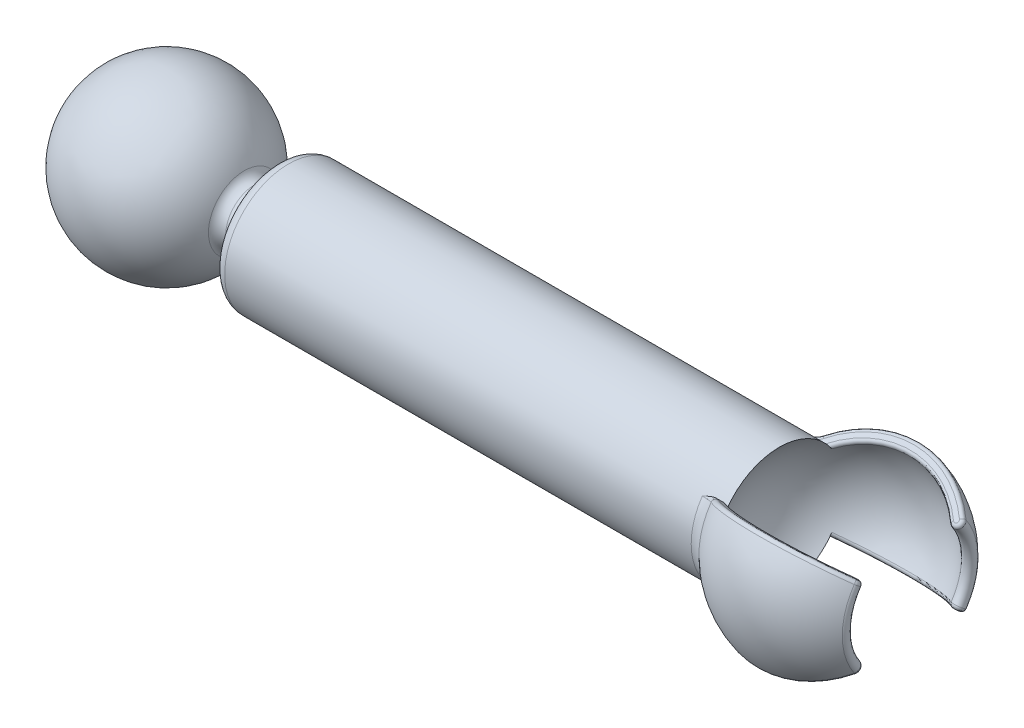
ISO-10303-21;
HEADER;
FILE_DESCRIPTION(('STEP AP214'),'2;1');
FILE_NAME('part.step','',(''),(''),'','','');
FILE_SCHEMA(('AUTOMOTIVE_DESIGN { 1 0 10303 214 1 1 1 1 }'));
ENDSEC;
DATA;
#1=APPLICATION_CONTEXT('core data for automotive mechanical design processes');
#2=APPLICATION_PROTOCOL_DEFINITION('international standard','automotive_design',2000,#1);
#3=PRODUCT_CONTEXT('',#1,'mechanical');
#4=PRODUCT('Part','Part','',(#3));
#5=PRODUCT_RELATED_PRODUCT_CATEGORY('part','',(#4));
#6=PRODUCT_DEFINITION_FORMATION('','',#4);
#7=PRODUCT_DEFINITION_CONTEXT('part definition',#1,'design');
#8=PRODUCT_DEFINITION('design','',#6,#7);
#9=PRODUCT_DEFINITION_SHAPE('','',#8);
#10=(LENGTH_UNIT() NAMED_UNIT(*) SI_UNIT(.MILLI.,.METRE.));
#11=(NAMED_UNIT(*) PLANE_ANGLE_UNIT() SI_UNIT($,.RADIAN.));
#12=(NAMED_UNIT(*) SI_UNIT($,.STERADIAN.) SOLID_ANGLE_UNIT());
#13=UNCERTAINTY_MEASURE_WITH_UNIT(LENGTH_MEASURE(1.E-05),#10,'distance_accuracy_value','');
#14=(GEOMETRIC_REPRESENTATION_CONTEXT(3) GLOBAL_UNCERTAINTY_ASSIGNED_CONTEXT((#13)) GLOBAL_UNIT_ASSIGNED_CONTEXT((#10,
#11,#12)) REPRESENTATION_CONTEXT('',''));
#15=CARTESIAN_POINT('',(0.,0.,0.));
#16=DIRECTION('',(0.,0.,1.));
#17=DIRECTION('',(1.,0.,0.));
#18=AXIS2_PLACEMENT_3D('',#15,#16,#17);
#19=CARTESIAN_POINT('',(0.,0.,0.));
#20=DIRECTION('',(1.,0.,0.));
#21=DIRECTION('',(0.,1.,0.));
#22=AXIS2_PLACEMENT_3D('',#19,#20,#21);
#23=SPHERICAL_SURFACE('',#22,9.3472);
#24=CARTESIAN_POINT('',(8.48859350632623,0.,0.));
#25=DIRECTION('',(1.,0.,0.));
#26=DIRECTION('',(0.,0.,-1.));
#27=AXIS2_PLACEMENT_3D('',#24,#25,#26);
#28=CIRCLE('',#27,3.9133014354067);
#29=CARTESIAN_POINT('',(8.48859350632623,0.,-3.9133014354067));
#30=VERTEX_POINT('',#29);
#31=EDGE_CURVE('E434',#30,#30,#28,.T.);
#32=ORIENTED_EDGE('',*,*,#31,.F.);
#33=EDGE_LOOP('',(#32));
#34=FACE_BOUND('',#33,.T.);
#35=ADVANCED_FACE('F32',(#34),#23,.T.);
#36=CARTESIAN_POINT('',(9.64193501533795,0.,0.));
#37=DIRECTION('',(1.,0.,0.));
#38=DIRECTION('',(0.,0.,-1.));
#39=AXIS2_PLACEMENT_3D('',#36,#37,#38);
#40=TOROIDAL_SURFACE('',#39,4.445,1.27);
#41=ORIENTED_EDGE('',*,*,#31,.T.);
#42=EDGE_LOOP('',(#41));
#43=FACE_BOUND('',#42,.T.);
#44=CARTESIAN_POINT('',(9.64193501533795,0.,0.));
#45=DIRECTION('',(1.,0.,0.));
#46=DIRECTION('',(0.,0.,-1.));
#47=AXIS2_PLACEMENT_3D('',#44,#45,#46);
#48=CIRCLE('',#47,3.175);
#49=CARTESIAN_POINT('',(9.64193501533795,0.,-3.175));
#50=VERTEX_POINT('',#49);
#51=EDGE_CURVE('E431',#50,#50,#48,.T.);
#52=ORIENTED_EDGE('',*,*,#51,.F.);
#53=EDGE_LOOP('',(#52));
#54=FACE_BOUND('',#53,.T.);
#55=ADVANCED_FACE('F389',(#43,#54),#40,.F.);
#56=CARTESIAN_POINT('',(0.,0.,0.));
#57=DIRECTION('',(1.,0.,0.));
#58=DIRECTION('',(0.,0.,-1.));
#59=AXIS2_PLACEMENT_3D('',#56,#57,#58);
#60=CYLINDRICAL_SURFACE('',#59,3.175);
#61=ORIENTED_EDGE('',*,*,#51,.T.);
#62=EDGE_LOOP('',(#61));
#63=FACE_BOUND('',#62,.T.);
#64=CARTESIAN_POINT('',(10.795,0.,0.));
#65=DIRECTION('',(1.,0.,0.));
#66=DIRECTION('',(0.,0.,-1.));
#67=AXIS2_PLACEMENT_3D('',#64,#65,#66);
#68=CIRCLE('',#67,3.175);
#69=CARTESIAN_POINT('',(10.795,0.,-3.175));
#70=VERTEX_POINT('',#69);
#71=EDGE_CURVE('E423',#70,#70,#68,.T.);
#72=ORIENTED_EDGE('',*,*,#71,.F.);
#73=EDGE_LOOP('',(#72));
#74=FACE_BOUND('',#73,.T.);
#75=ADVANCED_FACE('F395',(#63,#74),#60,.T.);
#76=CARTESIAN_POINT('',(10.795,0.,0.));
#77=DIRECTION('',(1.,0.,0.));
#78=DIRECTION('',(0.,0.,-1.));
#79=AXIS2_PLACEMENT_3D('',#76,#77,#78);
#80=TOROIDAL_SURFACE('',#79,4.445,1.27);
#81=ORIENTED_EDGE('',*,*,#71,.T.);
#82=EDGE_LOOP('',(#81));
#83=FACE_BOUND('',#82,.T.);
#84=CARTESIAN_POINT('',(12.065,0.,0.));
#85=DIRECTION('',(1.,0.,0.));
#86=DIRECTION('',(0.,0.,-1.));
#87=AXIS2_PLACEMENT_3D('',#84,#85,#86);
#88=CIRCLE('',#87,4.44500000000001);
#89=CARTESIAN_POINT('',(12.065,0.,-4.44500000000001));
#90=VERTEX_POINT('',#89);
#91=EDGE_CURVE('E417',#90,#90,#88,.T.);
#92=ORIENTED_EDGE('',*,*,#91,.F.);
#93=EDGE_LOOP('',(#92));
#94=FACE_BOUND('',#93,.T.);
#95=ADVANCED_FACE('F403',(#83,#94),#80,.F.);
#96=CARTESIAN_POINT('',(12.065,4.44500000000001,0.));
#97=DIRECTION('',(-1.,0.,0.));
#98=DIRECTION('',(0.,0.,1.));
#99=AXIS2_PLACEMENT_3D('',#96,#97,#98);
#100=PLANE('',#99);
#101=ORIENTED_EDGE('',*,*,#91,.T.);
#102=EDGE_LOOP('',(#101));
#103=FACE_BOUND('',#102,.T.);
#104=CARTESIAN_POINT('',(12.065,0.,0.));
#105=DIRECTION('',(1.,0.,0.));
#106=DIRECTION('',(0.,0.,-1.));
#107=AXIS2_PLACEMENT_3D('',#104,#105,#106);
#108=CIRCLE('',#107,5.71499999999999);
#109=CARTESIAN_POINT('',(12.065,0.,-5.71499999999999));
#110=VERTEX_POINT('',#109);
#111=EDGE_CURVE('E420',#110,#110,#108,.T.);
#112=ORIENTED_EDGE('',*,*,#111,.F.);
#113=EDGE_LOOP('',(#112));
#114=FACE_BOUND('',#113,.T.);
#115=ADVANCED_FACE('F406',(#103,#114),#100,.T.);
#116=CARTESIAN_POINT('',(13.335,0.,0.));
#117=DIRECTION('',(1.,0.,0.));
#118=DIRECTION('',(0.,0.,-1.));
#119=AXIS2_PLACEMENT_3D('',#116,#117,#118);
#120=TOROIDAL_SURFACE('',#119,5.715,1.27);
#121=ORIENTED_EDGE('',*,*,#111,.T.);
#122=EDGE_LOOP('',(#121));
#123=FACE_BOUND('',#122,.T.);
#124=CARTESIAN_POINT('',(13.335,0.,0.));
#125=DIRECTION('',(1.,0.,0.));
#126=DIRECTION('',(0.,0.,-1.));
#127=AXIS2_PLACEMENT_3D('',#124,#125,#126);
#128=CIRCLE('',#127,6.985);
#129=CARTESIAN_POINT('',(13.335,0.,-6.985));
#130=VERTEX_POINT('',#129);
#131=EDGE_CURVE('E421',#130,#130,#128,.T.);
#132=ORIENTED_EDGE('',*,*,#131,.F.);
#133=EDGE_LOOP('',(#132));
#134=FACE_BOUND('',#133,.T.);
#135=ADVANCED_FACE('F297',(#123,#134),#120,.T.);
#136=CARTESIAN_POINT('',(0.,0.,0.));
#137=DIRECTION('',(1.,0.,0.));
#138=DIRECTION('',(0.,0.,-1.));
#139=AXIS2_PLACEMENT_3D('',#136,#137,#138);
#140=CYLINDRICAL_SURFACE('',#139,6.985);
#141=CARTESIAN_POINT('',(67.0064452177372,0.,0.));
#142=DIRECTION('',(1.,0.,0.));
#143=DIRECTION('',(0.,0.,-1.));
#144=AXIS2_PLACEMENT_3D('',#141,#142,#143);
#145=CIRCLE('',#144,6.985);
#146=CARTESIAN_POINT('',(67.0064452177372,3.95570425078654,-5.7569635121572));
#147=VERTEX_POINT('',#146);
#148=CARTESIAN_POINT('',(67.0064452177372,3.95570425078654,5.7569635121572));
#149=VERTEX_POINT('',#148);
#150=EDGE_CURVE('E650',#147,#149,#145,.T.);
#151=ORIENTED_EDGE('',*,*,#150,.F.);
#152=CARTESIAN_POINT('',(67.0064452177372,3.95570425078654,-5.7569635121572));
#153=CARTESIAN_POINT('',(67.0064936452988,3.96900837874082,-5.74782489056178));
#154=CARTESIAN_POINT('',(67.0048814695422,3.98224128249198,-5.73866169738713));
#155=CARTESIAN_POINT('',(66.998702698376,4.00804036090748,-5.72067072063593));
#156=CARTESIAN_POINT('',(66.9941660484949,4.02061191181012,-5.71184048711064));
#157=CARTESIAN_POINT('',(66.9825101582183,4.04481097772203,-5.69473014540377));
#158=CARTESIAN_POINT('',(66.9753988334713,4.05644125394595,-5.68644844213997));
#159=CARTESIAN_POINT('',(66.9590672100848,4.07865099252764,-5.67053945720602));
#160=CARTESIAN_POINT('',(66.9498414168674,4.08922761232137,-5.66291395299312));
#161=CARTESIAN_POINT('',(66.9251507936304,4.11381498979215,-5.6450931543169));
#162=CARTESIAN_POINT('',(66.9087592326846,4.1271927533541,-5.63531144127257));
#163=CARTESIAN_POINT('',(66.8735759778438,4.15163941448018,-5.61732549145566));
#164=CARTESIAN_POINT('',(66.8547793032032,4.16270339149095,-5.60912461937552));
#165=CARTESIAN_POINT('',(66.8066667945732,4.18722960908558,-5.59085540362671));
#166=CARTESIAN_POINT('',(66.7764372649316,4.19951459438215,-5.58161905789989));
#167=CARTESIAN_POINT('',(66.713937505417,4.22011138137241,-5.5660622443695));
#168=CARTESIAN_POINT('',(66.6816631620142,4.22841486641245,-5.55974788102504));
#169=CARTESIAN_POINT('',(66.6192473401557,4.24070267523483,-5.55038030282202));
#170=CARTESIAN_POINT('',(66.5892111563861,4.24503329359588,-5.54706606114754));
#171=CARTESIAN_POINT('',(66.5289094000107,4.25076188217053,-5.54267534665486));
#172=CARTESIAN_POINT('',(66.4986468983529,4.25218013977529,-5.54158339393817));
#173=CARTESIAN_POINT('',(66.4683957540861,4.25219858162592,-5.54157308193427));
#174=B_SPLINE_CURVE_WITH_KNOTS('',3,(#152,#153,#154,#155,#156,#157,#158,#159,#160,#161,#162,
#163,#164,#165,#166,#167,#168,#169,#170,#171,#172,#173),.UNSPECIFIED.,.F.,.F.,(4,2,2,2,2,2,2,2,
2,2,4),(0.,0.04826832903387,0.0960500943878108,0.143686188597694,0.191447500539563,
0.260985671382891,0.330670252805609,0.43186010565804,0.533260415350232,0.62461905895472,
0.71533911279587),.UNSPECIFIED.);
#175=CARTESIAN_POINT('',(66.4683957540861,4.25219858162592,-5.54157308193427));
#176=VERTEX_POINT('',#175);
#177=EDGE_CURVE('E11',#147,#176,#174,.T.);
#178=ORIENTED_EDGE('',*,*,#177,.T.);
#179=DIRECTION('',(-1.,0.,0.));
#180=VECTOR('',#179,1.);
#181=CARTESIAN_POINT('',(65.251659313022,4.25219858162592,-5.54157308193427));
#182=LINE('',#181,#180);
#183=CARTESIAN_POINT('',(65.6768260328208,4.25219858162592,-5.54157308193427));
#184=VERTEX_POINT('',#183);
#185=EDGE_CURVE('E270',#176,#184,#182,.T.);
#186=ORIENTED_EDGE('',*,*,#185,.T.);
#187=CARTESIAN_POINT('',(63.8327176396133,4.04903982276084,-5.27681143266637));
#188=CARTESIAN_POINT('',(63.920792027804,4.28837242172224,-5.58871574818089));
#189=CARTESIAN_POINT('',(63.9158766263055,3.95587827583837,-5.81619096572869));
#190=CARTESIAN_POINT('',(63.8988903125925,4.04001561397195,-5.26505085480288));
#191=CARTESIAN_POINT('',(63.9759580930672,4.28097000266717,-5.57906872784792));
#192=CARTESIAN_POINT('',(63.9716009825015,3.94812903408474,-5.80638927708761));
#193=CARTESIAN_POINT('',(63.9656572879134,4.03269676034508,-5.25551273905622));
#194=CARTESIAN_POINT('',(64.0315733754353,4.27497071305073,-5.57125030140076));
#195=CARTESIAN_POINT('',(64.0278258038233,3.94184339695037,-5.79844038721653));
#196=CARTESIAN_POINT('',(64.0999633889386,4.0215086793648,-5.24093214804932));
#197=CARTESIAN_POINT('',(64.1434260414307,4.26580064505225,-5.55929963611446));
#198=CARTESIAN_POINT('',(64.1409256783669,3.932234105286,-5.78628960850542));
#199=CARTESIAN_POINT('',(64.1675024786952,4.01763929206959,-5.23588946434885));
#200=CARTESIAN_POINT('',(64.1996528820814,4.2626315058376,-5.55516953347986));
#201=CARTESIAN_POINT('',(64.1978007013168,3.92891031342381,-5.78208754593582));
#202=CARTESIAN_POINT('',(64.370480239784,4.01126840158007,-5.22758675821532));
#203=CARTESIAN_POINT('',(64.3686411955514,4.25741064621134,-5.54836557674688));
#204=CARTESIAN_POINT('',(64.3687293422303,3.92343790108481,-5.77516880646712));
#205=CARTESIAN_POINT('',(64.5064598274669,4.01397967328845,-5.23112015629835));
#206=CARTESIAN_POINT('',(64.4817736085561,4.25962933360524,-5.55125702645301));
#207=CARTESIAN_POINT('',(64.4832384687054,3.92576720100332,-5.7781129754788));
#208=CARTESIAN_POINT('',(64.7756428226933,4.03326545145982,-5.25625387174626));
#209=CARTESIAN_POINT('',(64.705930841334,4.27543480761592,-5.57185512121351));
#210=CARTESIAN_POINT('',(64.7099188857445,3.94233205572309,-5.79905787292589));
#211=CARTESIAN_POINT('',(64.9088467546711,4.04983731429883,-5.27785074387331));
#212=CARTESIAN_POINT('',(64.8168699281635,4.28900708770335,-5.58954286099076));
#213=CARTESIAN_POINT('',(64.8220906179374,3.95656534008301,-5.8170557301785));
#214=CARTESIAN_POINT('',(65.1687628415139,4.09634625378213,-5.33846237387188));
#215=CARTESIAN_POINT('',(65.0336699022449,4.3271820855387,-5.63929348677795));
#216=CARTESIAN_POINT('',(65.0409673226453,3.99649351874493,-5.86757793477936));
#217=CARTESIAN_POINT('',(65.2954774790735,4.12627817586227,-5.37747041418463));
#218=CARTESIAN_POINT('',(65.139464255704,4.3517532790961,-5.67131528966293));
#219=CARTESIAN_POINT('',(65.1476743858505,4.02218399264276,-5.9000966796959));
#220=CARTESIAN_POINT('',(65.5391482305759,4.19873866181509,-5.47190275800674));
#221=CARTESIAN_POINT('',(65.3433033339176,4.41138814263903,-5.749032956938));
#222=CARTESIAN_POINT('',(65.3528708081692,4.08434044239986,-5.97884266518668));
#223=CARTESIAN_POINT('',(65.6560810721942,4.24129622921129,-5.52736485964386));
#224=CARTESIAN_POINT('',(65.4412887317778,4.4464397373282,-5.79471308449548));
#225=CARTESIAN_POINT('',(65.4513405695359,4.12083122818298,-6.02510146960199));
#226=CARTESIAN_POINT('',(65.8765852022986,4.33776997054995,-5.65309188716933));
#227=CARTESIAN_POINT('',(65.626478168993,4.52611055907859,-5.8985421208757));
#228=CARTESIAN_POINT('',(65.637028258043,4.20349656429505,-6.13000144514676));
#229=CARTESIAN_POINT('',(65.9801508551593,4.39169091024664,-5.7233630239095));
#230=CARTESIAN_POINT('',(65.7136674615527,4.57069585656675,-5.95664681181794));
#231=CARTESIAN_POINT('',(65.7242414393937,4.24967517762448,-6.18864781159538));
#232=CARTESIAN_POINT('',(66.1710281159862,4.50942175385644,-5.87679284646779));
#233=CARTESIAN_POINT('',(65.8747594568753,4.66829702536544,-6.08384313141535));
#234=CARTESIAN_POINT('',(65.8849801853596,4.35042969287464,-6.31674276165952));
#235=CARTESIAN_POINT('',(66.258330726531,4.57323709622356,-5.95995861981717));
#236=CARTESIAN_POINT('',(65.9486724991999,4.72128444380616,-6.15289767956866));
#237=CARTESIAN_POINT('',(65.9584981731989,4.40501021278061,-6.38619728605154));
#238=CARTESIAN_POINT('',(66.3751140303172,4.67490720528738,-6.09245768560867));
#239=CARTESIAN_POINT('',(66.0478892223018,4.80596147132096,-6.26325093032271));
#240=CARTESIAN_POINT('',(66.0568420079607,4.49190649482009,-6.49689160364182));
#241=CARTESIAN_POINT('',(66.4116984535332,4.70981210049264,-6.13794663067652));
#242=CARTESIAN_POINT('',(66.0790078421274,4.83503908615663,-6.30114561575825));
#243=CARTESIAN_POINT('',(66.0876499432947,4.52172971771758,-6.5349009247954));
#244=CARTESIAN_POINT('',(66.4799131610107,4.7813740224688,-6.23120794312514));
#245=CARTESIAN_POINT('',(66.1371311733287,4.89471377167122,-6.37891518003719));
#246=CARTESIAN_POINT('',(66.1450939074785,4.58285301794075,-6.61284079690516));
#247=CARTESIAN_POINT('',(66.5115432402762,4.81803112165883,-6.27898040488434));
#248=CARTESIAN_POINT('',(66.1641414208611,4.92530869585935,-6.41878726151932));
#249=CARTESIAN_POINT('',(66.1717297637,4.61415315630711,-6.6527714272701));
#250=CARTESIAN_POINT('',(66.5405933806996,4.85545235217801,-6.32774870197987));
#251=CARTESIAN_POINT('',(66.1890189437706,4.95659476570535,-6.4595600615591));
#252=CARTESIAN_POINT('',(66.1961930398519,4.64609530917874,-6.6935413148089));
#253=(BOUNDED_SURFACE() B_SPLINE_SURFACE(3,2,((#187,#188,#189),(#190,#191,#192),(#193,#194,
#195),(#196,#197,#198),(#199,#200,#201),(#202,#203,#204),(#205,#206,#207),(#208,#209,#210),
(#211,#212,#213),(#214,#215,#216),(#217,#218,#219),(#220,#221,#222),(#223,#224,#225),(#226,#227,
#228),(#229,#230,#231),(#232,#233,#234),(#235,#236,#237),(#238,#239,#240),(#241,#242,#243),
(#244,#245,#246),(#247,#248,#249),(#250,#251,#252)),.UNSPECIFIED.,.F.,.F.,
.F.) B_SPLINE_SURFACE_WITH_KNOTS((4,2,2,2,2,2,2,2,2,2,4),(3,3),(0.,0.203313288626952,
0.406617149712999,0.812677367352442,1.21866015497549,1.62448644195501,2.03125230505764,
2.43818910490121,2.84535037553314,3.04918593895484,3.25302993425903),(0.,1.),
.UNSPECIFIED.) GEOMETRIC_REPRESENTATION_ITEM() RATIONAL_B_SPLINE_SURFACE(((1.,0.687091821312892,
1.),(1.,0.686918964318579,1.),(1.,0.686777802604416,1.),(1.,0.686561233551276,1.),(1.,
0.686485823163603,1.),(1.,0.686361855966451,1.),(1.,0.686415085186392,1.),(1.,0.686789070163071,
1.),(1.,0.687109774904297,1.),(1.,0.687988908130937,1.),(1.,0.688547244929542,1.),(1.,
0.689855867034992,1.),(1.,0.690606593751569,1.),(1.,0.692242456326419,1.),(1.,0.693127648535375,
1.),(1.,0.694975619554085,1.),(1.,0.695938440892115,1.),(1.,0.697400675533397,1.),(1.,
0.697891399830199,1.),(1.,0.698873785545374,1.),(1.,0.699365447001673,1.),(1.,0.699855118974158,1.))) REPRESENTATION_ITEM('') SURFACE());
#254=CARTESIAN_POINT('',(65.6768260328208,4.25219858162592,-5.54157308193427));
#255=CARTESIAN_POINT('',(65.6292705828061,4.25216569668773,-5.54159445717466));
#256=CARTESIAN_POINT('',(65.5818052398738,4.25009515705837,-5.54318760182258));
#257=CARTESIAN_POINT('',(65.4874256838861,4.24257016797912,-5.54895085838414));
#258=CARTESIAN_POINT('',(65.440510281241,4.23712543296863,-5.55311357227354));
#259=CARTESIAN_POINT('',(65.3478711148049,4.22361491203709,-5.56339545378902));
#260=CARTESIAN_POINT('',(65.3021398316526,4.21558052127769,-5.56949117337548));
#261=CARTESIAN_POINT('',(65.2113180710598,4.19734286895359,-5.58324929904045));
#262=CARTESIAN_POINT('',(65.1662281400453,4.187137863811,-5.59091296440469));
#263=CARTESIAN_POINT('',(64.9921779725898,4.14409505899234,-5.62301048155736));
#264=CARTESIAN_POINT('',(64.8656410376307,4.10491108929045,-5.65178257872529));
#265=CARTESIAN_POINT('',(64.6153698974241,4.01994482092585,-5.71253070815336));
#266=CARTESIAN_POINT('',(64.4916473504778,3.97413939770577,-5.74451784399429));
#267=CARTESIAN_POINT('',(64.3648816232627,3.9274325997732,-5.77628772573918));
#268=CARTESIAN_POINT('',(64.3621365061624,3.92642126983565,-5.77697522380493));
#269=CARTESIAN_POINT('',(64.3593912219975,3.92541003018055,-5.77766225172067));
#270=B_SPLINE_CURVE_WITH_KNOTS('',3,(#254,#255,#256,#257,#258,#259,#260,#261,#262,#263,#264,
#265,#266,#267,#268,#269),.UNSPECIFIED.,.F.,.F.,(4,2,2,2,2,2,2,4),(0.,0.142470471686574,
0.284532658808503,0.424933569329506,0.565447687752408,0.971326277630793,1.37865821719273,
1.38767375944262),.UNSPECIFIED.);
#271=CARTESIAN_POINT('',(64.3593912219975,3.92541003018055,-5.77766225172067));
#272=VERTEX_POINT('',#271);
#273=EDGE_CURVE('E188',#184,#272,#270,.T.);
#274=ORIENTED_EDGE('',*,*,#273,.T.);
#275=CARTESIAN_POINT('',(64.3593912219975,0.,0.));
#276=DIRECTION('',(1.,0.,0.));
#277=DIRECTION('',(0.,0.,-1.));
#278=AXIS2_PLACEMENT_3D('',#275,#276,#277);
#279=CIRCLE('',#278,6.985);
#280=CARTESIAN_POINT('',(64.3593912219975,-3.92541003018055,-5.77766225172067));
#281=VERTEX_POINT('',#280);
#282=EDGE_CURVE('E442',#272,#281,#279,.F.);
#283=ORIENTED_EDGE('',*,*,#282,.T.);
#284=CARTESIAN_POINT('',(63.9158766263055,-3.95587827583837,-5.81619096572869));
#285=CARTESIAN_POINT('',(63.920792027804,-4.28837242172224,-5.58871574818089));
#286=CARTESIAN_POINT('',(63.8327176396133,-4.04903982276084,-5.27681143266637));
#287=CARTESIAN_POINT('',(63.9716009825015,-3.94812903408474,-5.80638927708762));
#288=CARTESIAN_POINT('',(63.9759580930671,-4.28097000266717,-5.57906872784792));
#289=CARTESIAN_POINT('',(63.8988903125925,-4.04001561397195,-5.26505085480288));
#290=CARTESIAN_POINT('',(64.0278258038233,-3.94184339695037,-5.79844038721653));
#291=CARTESIAN_POINT('',(64.0315733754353,-4.27497071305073,-5.57125030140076));
#292=CARTESIAN_POINT('',(63.9656572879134,-4.03269676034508,-5.25551273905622));
#293=CARTESIAN_POINT('',(64.1409256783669,-3.93223410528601,-5.78628960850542));
#294=CARTESIAN_POINT('',(64.1434260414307,-4.26580064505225,-5.55929963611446));
#295=CARTESIAN_POINT('',(64.0999633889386,-4.0215086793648,-5.24093214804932));
#296=CARTESIAN_POINT('',(64.1978007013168,-3.92891031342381,-5.78208754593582));
#297=CARTESIAN_POINT('',(64.1996528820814,-4.2626315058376,-5.55516953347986));
#298=CARTESIAN_POINT('',(64.1675024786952,-4.01763929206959,-5.23588946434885));
#299=CARTESIAN_POINT('',(64.3687293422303,-3.92343790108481,-5.77516880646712));
#300=CARTESIAN_POINT('',(64.3686411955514,-4.25741064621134,-5.54836557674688));
#301=CARTESIAN_POINT('',(64.370480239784,-4.01126840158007,-5.22758675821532));
#302=CARTESIAN_POINT('',(64.4832384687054,-3.92576720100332,-5.7781129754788));
#303=CARTESIAN_POINT('',(64.4817736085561,-4.25962933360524,-5.55125702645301));
#304=CARTESIAN_POINT('',(64.5064598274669,-4.01397967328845,-5.23112015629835));
#305=CARTESIAN_POINT('',(64.7099188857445,-3.94233205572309,-5.79905787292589));
#306=CARTESIAN_POINT('',(64.705930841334,-4.27543480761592,-5.5718551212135));
#307=CARTESIAN_POINT('',(64.7756428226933,-4.03326545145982,-5.25625387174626));
#308=CARTESIAN_POINT('',(64.8220906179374,-3.95656534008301,-5.8170557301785));
#309=CARTESIAN_POINT('',(64.8168699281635,-4.28900708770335,-5.58954286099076));
#310=CARTESIAN_POINT('',(64.9088467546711,-4.04983731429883,-5.27785074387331));
#311=CARTESIAN_POINT('',(65.0409673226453,-3.99649351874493,-5.86757793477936));
#312=CARTESIAN_POINT('',(65.0336699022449,-4.3271820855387,-5.63929348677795));
#313=CARTESIAN_POINT('',(65.1687628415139,-4.09634625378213,-5.33846237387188));
#314=CARTESIAN_POINT('',(65.1476743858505,-4.02218399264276,-5.9000966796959));
#315=CARTESIAN_POINT('',(65.139464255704,-4.3517532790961,-5.67131528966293));
#316=CARTESIAN_POINT('',(65.2954774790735,-4.12627817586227,-5.37747041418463));
#317=CARTESIAN_POINT('',(65.3528708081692,-4.08434044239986,-5.97884266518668));
#318=CARTESIAN_POINT('',(65.3433033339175,-4.41138814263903,-5.749032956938));
#319=CARTESIAN_POINT('',(65.5391482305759,-4.19873866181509,-5.47190275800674));
#320=CARTESIAN_POINT('',(65.4513405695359,-4.12083122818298,-6.02510146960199));
#321=CARTESIAN_POINT('',(65.4412887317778,-4.4464397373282,-5.79471308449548));
#322=CARTESIAN_POINT('',(65.6560810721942,-4.24129622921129,-5.52736485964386));
#323=CARTESIAN_POINT('',(65.637028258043,-4.20349656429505,-6.13000144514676));
#324=CARTESIAN_POINT('',(65.6264781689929,-4.52611055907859,-5.8985421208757));
#325=CARTESIAN_POINT('',(65.8765852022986,-4.33776997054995,-5.65309188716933));
#326=CARTESIAN_POINT('',(65.7242414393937,-4.24967517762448,-6.18864781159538));
#327=CARTESIAN_POINT('',(65.7136674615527,-4.57069585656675,-5.95664681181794));
#328=CARTESIAN_POINT('',(65.9801508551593,-4.39169091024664,-5.7233630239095));
#329=CARTESIAN_POINT('',(65.8849801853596,-4.35042969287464,-6.31674276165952));
#330=CARTESIAN_POINT('',(65.8747594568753,-4.66829702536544,-6.08384313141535));
#331=CARTESIAN_POINT('',(66.1710281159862,-4.50942175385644,-5.87679284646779));
#332=CARTESIAN_POINT('',(65.9584981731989,-4.4050102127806,-6.38619728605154));
#333=CARTESIAN_POINT('',(65.9486724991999,-4.72128444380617,-6.15289767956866));
#334=CARTESIAN_POINT('',(66.258330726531,-4.57323709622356,-5.95995861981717));
#335=CARTESIAN_POINT('',(66.0568420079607,-4.49190649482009,-6.49689160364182));
#336=CARTESIAN_POINT('',(66.0478892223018,-4.80596147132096,-6.26325093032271));
#337=CARTESIAN_POINT('',(66.3751140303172,-4.67490720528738,-6.09245768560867));
#338=CARTESIAN_POINT('',(66.0876499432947,-4.52172971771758,-6.53490092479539));
#339=CARTESIAN_POINT('',(66.0790078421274,-4.83503908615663,-6.30114561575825));
#340=CARTESIAN_POINT('',(66.4116984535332,-4.70981210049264,-6.13794663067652));
#341=CARTESIAN_POINT('',(66.1450939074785,-4.58285301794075,-6.61284079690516));
#342=CARTESIAN_POINT('',(66.1371311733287,-4.89471377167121,-6.37891518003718));
#343=CARTESIAN_POINT('',(66.4799131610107,-4.7813740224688,-6.23120794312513));
#344=CARTESIAN_POINT('',(66.1717297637,-4.61415315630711,-6.6527714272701));
#345=CARTESIAN_POINT('',(66.1641414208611,-4.92530869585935,-6.41878726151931));
#346=CARTESIAN_POINT('',(66.5115432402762,-4.81803112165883,-6.27898040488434));
#347=CARTESIAN_POINT('',(66.1961930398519,-4.64609530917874,-6.6935413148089));
#348=CARTESIAN_POINT('',(66.1890189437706,-4.95659476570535,-6.4595600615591));
#349=CARTESIAN_POINT('',(66.5405933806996,-4.85545235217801,-6.32774870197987));
#350=(BOUNDED_SURFACE() B_SPLINE_SURFACE(3,2,((#284,#285,#286),(#287,#288,#289),(#290,#291,
#292),(#293,#294,#295),(#296,#297,#298),(#299,#300,#301),(#302,#303,#304),(#305,#306,#307),
(#308,#309,#310),(#311,#312,#313),(#314,#315,#316),(#317,#318,#319),(#320,#321,#322),(#323,#324,
#325),(#326,#327,#328),(#329,#330,#331),(#332,#333,#334),(#335,#336,#337),(#338,#339,#340),
(#341,#342,#343),(#344,#345,#346),(#347,#348,#349)),.UNSPECIFIED.,.F.,.F.,
.F.) B_SPLINE_SURFACE_WITH_KNOTS((4,2,2,2,2,2,2,2,2,2,4),(3,3),(0.,0.203313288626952,
0.406617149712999,0.812677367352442,1.21866015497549,1.62448644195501,2.03125230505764,
2.43818910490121,2.84535037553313,3.04918593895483,3.25302993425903),(0.,1.),
.UNSPECIFIED.) GEOMETRIC_REPRESENTATION_ITEM() RATIONAL_B_SPLINE_SURFACE(((1.,0.687091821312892,
1.),(1.,0.686918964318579,1.),(1.,0.686777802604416,1.),(1.,0.686561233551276,1.),(1.,
0.686485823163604,1.),(1.,0.686361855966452,1.),(1.,0.686415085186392,1.),(1.,0.686789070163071,
1.),(1.,0.687109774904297,1.),(1.,0.687988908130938,1.),(1.,0.688547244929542,1.),(1.,
0.689855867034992,1.),(1.,0.690606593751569,1.),(1.,0.69224245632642,1.),(1.,0.693127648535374,
1.),(1.,0.694975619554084,1.),(1.,0.695938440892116,1.),(1.,0.697400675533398,1.),(1.,
0.697891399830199,1.),(1.,0.698873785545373,1.),(1.,0.699365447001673,1.),(1.,0.699855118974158,1.))) REPRESENTATION_ITEM('') SURFACE());
#351=CARTESIAN_POINT('',(65.6768260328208,-4.25219858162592,-5.54157308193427));
#352=CARTESIAN_POINT('',(65.6292705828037,-4.25216569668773,-5.54159445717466));
#353=CARTESIAN_POINT('',(65.5818052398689,-4.25009515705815,-5.54318760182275));
#354=CARTESIAN_POINT('',(65.4874256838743,-4.242570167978,-5.548950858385));
#355=CARTESIAN_POINT('',(65.4405102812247,-4.23712543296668,-5.55311357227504));
#356=CARTESIAN_POINT('',(65.3478711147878,-4.22361491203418,-5.56339545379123));
#357=CARTESIAN_POINT('',(65.3021398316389,-4.21558052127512,-5.56949117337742));
#358=CARTESIAN_POINT('',(65.2113180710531,-4.19734286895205,-5.5832492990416));
#359=CARTESIAN_POINT('',(65.166228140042,-4.18713786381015,-5.59091296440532));
#360=CARTESIAN_POINT('',(64.9921779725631,-4.14409505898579,-5.62301048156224));
#361=CARTESIAN_POINT('',(64.8656410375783,-4.10491108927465,-5.65178257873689));
#362=CARTESIAN_POINT('',(64.6153698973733,-4.01994482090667,-5.71253070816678));
#363=CARTESIAN_POINT('',(64.4916473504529,-3.97413939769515,-5.74451784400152));
#364=CARTESIAN_POINT('',(64.3648816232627,-3.92743259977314,-5.77628772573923));
#365=CARTESIAN_POINT('',(64.3621365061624,-3.92642126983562,-5.77697522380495));
#366=CARTESIAN_POINT('',(64.3593912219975,-3.92541003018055,-5.77766225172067));
#367=B_SPLINE_CURVE_WITH_KNOTS('',3,(#351,#352,#353,#354,#355,#356,#357,#358,#359,#360,#361,
#362,#363,#364,#365,#366),.UNSPECIFIED.,.F.,.F.,(4,2,2,2,2,2,2,4),(0.,0.142470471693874,
0.284532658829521,0.424933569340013,0.5654476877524,0.97132627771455,1.3786582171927,
1.38767375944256),.UNSPECIFIED.);
#368=CARTESIAN_POINT('',(65.6768260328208,-4.25219858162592,-5.54157308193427));
#369=VERTEX_POINT('',#368);
#370=EDGE_CURVE('E316',#281,#369,#367,.F.);
#371=ORIENTED_EDGE('',*,*,#370,.T.);
#372=DIRECTION('',(-1.,0.,0.));
#373=VECTOR('',#372,1.);
#374=CARTESIAN_POINT('',(65.251659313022,-4.25219858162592,-5.54157308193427));
#375=LINE('',#374,#373);
#376=CARTESIAN_POINT('',(66.4683957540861,-4.25219858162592,-5.54157308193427));
#377=VERTEX_POINT('',#376);
#378=EDGE_CURVE('E686',#377,#369,#375,.T.);
#379=ORIENTED_EDGE('',*,*,#378,.F.);
#380=CARTESIAN_POINT('',(66.4683957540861,-4.25219858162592,-5.54157308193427));
#381=CARTESIAN_POINT('',(66.4893417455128,-4.25219394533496,-5.54157609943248));
#382=CARTESIAN_POINT('',(66.5102723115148,-4.25151076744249,-5.54210099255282));
#383=CARTESIAN_POINT('',(66.5520170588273,-4.24877385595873,-5.54419962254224));
#384=CARTESIAN_POINT('',(66.5728310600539,-4.24671839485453,-5.54577468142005));
#385=CARTESIAN_POINT('',(66.6352581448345,-4.23842700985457,-5.55211818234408));
#386=CARTESIAN_POINT('',(66.6764791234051,-4.23006549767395,-5.55850521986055));
#387=CARTESIAN_POINT('',(66.7436057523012,-4.21088591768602,-5.57303837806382));
#388=CARTESIAN_POINT('',(66.7702415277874,-4.20167427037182,-5.57999443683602));
#389=CARTESIAN_POINT('',(66.8214631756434,-4.18014500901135,-5.59614110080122));
#390=CARTESIAN_POINT('',(66.8460557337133,-4.16783810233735,-5.60532399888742));
#391=CARTESIAN_POINT('',(66.8853263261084,-4.14387852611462,-5.62304604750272));
#392=CARTESIAN_POINT('',(66.9007991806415,-4.13308907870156,-5.63098664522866));
#393=CARTESIAN_POINT('',(66.9295249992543,-4.1096636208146,-5.64810586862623));
#394=CARTESIAN_POINT('',(66.9427805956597,-4.09702983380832,-5.65728300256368));
#395=CARTESIAN_POINT('',(66.9636294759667,-4.07292073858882,-5.67465511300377));
#396=CARTESIAN_POINT('',(66.9718267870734,-4.06180477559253,-5.68262009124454));
#397=CARTESIAN_POINT('',(66.9858664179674,-4.03858837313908,-5.69914299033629));
#398=CARTESIAN_POINT('',(66.9917143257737,-4.02649035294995,-5.70769944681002));
#399=CARTESIAN_POINT('',(66.9995363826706,-4.00462643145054,-5.72305195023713));
#400=CARTESIAN_POINT('',(67.0021085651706,-3.99501528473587,-5.72976573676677));
#401=CARTESIAN_POINT('',(67.005574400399,-3.97551477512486,-5.74331364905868));
#402=CARTESIAN_POINT('',(67.0064605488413,-3.96562436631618,-5.7501481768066));
#403=CARTESIAN_POINT('',(67.0064452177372,-3.95570425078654,-5.7569635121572));
#404=B_SPLINE_CURVE_WITH_KNOTS('',3,(#380,#381,#382,#383,#384,#385,#386,#387,#388,#389,#390,
#391,#392,#393,#394,#395,#396,#397,#398,#399,#400,#401,#402,#403),.UNSPECIFIED.,.F.,.F.,(4,2,2,
2,2,2,2,2,2,2,2,4),(0.,0.0627892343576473,0.125657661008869,0.25251309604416,0.339360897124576,
0.425912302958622,0.487125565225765,0.548265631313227,0.595916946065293,0.643454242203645,
0.679345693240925,0.715396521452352),.UNSPECIFIED.);
#405=CARTESIAN_POINT('',(67.0064452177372,-3.95570425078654,-5.7569635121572));
#406=VERTEX_POINT('',#405);
#407=EDGE_CURVE('E46',#377,#406,#404,.T.);
#408=ORIENTED_EDGE('',*,*,#407,.T.);
#409=CARTESIAN_POINT('',(67.0064452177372,-3.95570425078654,5.7569635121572));
#410=VERTEX_POINT('',#409);
#411=EDGE_CURVE('E182',#410,#406,#145,.T.);
#412=ORIENTED_EDGE('',*,*,#411,.F.);
#413=CARTESIAN_POINT('',(67.0064452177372,-3.95570425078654,5.7569635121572));
#414=CARTESIAN_POINT('',(67.0064936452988,-3.96900837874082,5.74782489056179));
#415=CARTESIAN_POINT('',(67.0048814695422,-3.98224128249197,5.73866169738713));
#416=CARTESIAN_POINT('',(66.998702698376,-4.00804036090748,5.72067072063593));
#417=CARTESIAN_POINT('',(66.9941660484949,-4.02061191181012,5.71184048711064));
#418=CARTESIAN_POINT('',(66.9825101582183,-4.04481097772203,5.69473014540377));
#419=CARTESIAN_POINT('',(66.9753988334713,-4.05644125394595,5.68644844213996));
#420=CARTESIAN_POINT('',(66.9590672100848,-4.07865099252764,5.67053945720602));
#421=CARTESIAN_POINT('',(66.9498414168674,-4.08922761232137,5.66291395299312));
#422=CARTESIAN_POINT('',(66.9251507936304,-4.11381498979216,5.6450931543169));
#423=CARTESIAN_POINT('',(66.9087592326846,-4.1271927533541,5.63531144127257));
#424=CARTESIAN_POINT('',(66.8735759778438,-4.15163941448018,5.61732549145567));
#425=CARTESIAN_POINT('',(66.8547793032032,-4.16270339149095,5.60912461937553));
#426=CARTESIAN_POINT('',(66.8066667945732,-4.18722960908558,5.59085540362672));
#427=CARTESIAN_POINT('',(66.7764372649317,-4.19951459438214,5.5816190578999));
#428=CARTESIAN_POINT('',(66.7139375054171,-4.2201113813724,5.56606224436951));
#429=CARTESIAN_POINT('',(66.6816631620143,-4.22841486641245,5.55974788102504));
#430=CARTESIAN_POINT('',(66.6192473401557,-4.24070267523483,5.55038030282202));
#431=CARTESIAN_POINT('',(66.5892111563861,-4.24503329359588,5.54706606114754));
#432=CARTESIAN_POINT('',(66.5289094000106,-4.25076188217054,5.54267534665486));
#433=CARTESIAN_POINT('',(66.4986468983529,-4.25218013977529,5.54158339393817));
#434=CARTESIAN_POINT('',(66.4683957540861,-4.25219858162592,5.54157308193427));
#435=B_SPLINE_CURVE_WITH_KNOTS('',3,(#413,#414,#415,#416,#417,#418,#419,#420,#421,#422,#423,
#424,#425,#426,#427,#428,#429,#430,#431,#432,#433,#434),.UNSPECIFIED.,.F.,.F.,(4,2,2,2,2,2,2,2,
2,2,4),(0.,0.0482683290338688,0.0960500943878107,0.143686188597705,0.191447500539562,
0.260985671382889,0.330670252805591,0.43186010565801,0.533260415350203,0.624619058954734,
0.715339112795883),.UNSPECIFIED.);
#436=CARTESIAN_POINT('',(66.4683957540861,-4.25219858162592,5.54157308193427));
#437=VERTEX_POINT('',#436);
#438=EDGE_CURVE('E176',#410,#437,#435,.T.);
#439=ORIENTED_EDGE('',*,*,#438,.T.);
#440=DIRECTION('',(-1.,0.,0.));
#441=VECTOR('',#440,1.);
#442=CARTESIAN_POINT('',(65.251659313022,-4.25219858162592,5.54157308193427));
#443=LINE('',#442,#441);
#444=CARTESIAN_POINT('',(65.6768260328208,-4.25219858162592,5.54157308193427));
#445=VERTEX_POINT('',#444);
#446=EDGE_CURVE('E180',#437,#445,#443,.T.);
#447=ORIENTED_EDGE('',*,*,#446,.T.);
#448=CARTESIAN_POINT('',(63.8327176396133,-4.04903982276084,5.27681143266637));
#449=CARTESIAN_POINT('',(63.920792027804,-4.28837242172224,5.58871574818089));
#450=CARTESIAN_POINT('',(63.9158766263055,-3.95587827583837,5.81619096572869));
#451=CARTESIAN_POINT('',(63.8988903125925,-4.04001561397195,5.26505085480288));
#452=CARTESIAN_POINT('',(63.9759580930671,-4.28097000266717,5.57906872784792));
#453=CARTESIAN_POINT('',(63.9716009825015,-3.94812903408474,5.80638927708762));
#454=CARTESIAN_POINT('',(63.9656572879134,-4.03269676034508,5.25551273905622));
#455=CARTESIAN_POINT('',(64.0315733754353,-4.27497071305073,5.57125030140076));
#456=CARTESIAN_POINT('',(64.0278258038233,-3.94184339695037,5.79844038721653));
#457=CARTESIAN_POINT('',(64.0999633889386,-4.0215086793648,5.24093214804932));
#458=CARTESIAN_POINT('',(64.1434260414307,-4.26580064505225,5.55929963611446));
#459=CARTESIAN_POINT('',(64.1409256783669,-3.93223410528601,5.78628960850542));
#460=CARTESIAN_POINT('',(64.1675024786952,-4.01763929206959,5.23588946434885));
#461=CARTESIAN_POINT('',(64.1996528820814,-4.2626315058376,5.55516953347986));
#462=CARTESIAN_POINT('',(64.1978007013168,-3.92891031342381,5.78208754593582));
#463=CARTESIAN_POINT('',(64.370480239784,-4.01126840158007,5.22758675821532));
#464=CARTESIAN_POINT('',(64.3686411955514,-4.25741064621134,5.54836557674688));
#465=CARTESIAN_POINT('',(64.3687293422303,-3.92343790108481,5.77516880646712));
#466=CARTESIAN_POINT('',(64.5064598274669,-4.01397967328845,5.23112015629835));
#467=CARTESIAN_POINT('',(64.4817736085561,-4.25962933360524,5.55125702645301));
#468=CARTESIAN_POINT('',(64.4832384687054,-3.92576720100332,5.7781129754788));
#469=CARTESIAN_POINT('',(64.7756428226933,-4.03326545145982,5.25625387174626));
#470=CARTESIAN_POINT('',(64.705930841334,-4.27543480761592,5.5718551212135));
#471=CARTESIAN_POINT('',(64.7099188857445,-3.94233205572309,5.79905787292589));
#472=CARTESIAN_POINT('',(64.9088467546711,-4.04983731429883,5.27785074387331));
#473=CARTESIAN_POINT('',(64.8168699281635,-4.28900708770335,5.58954286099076));
#474=CARTESIAN_POINT('',(64.8220906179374,-3.95656534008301,5.8170557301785));
#475=CARTESIAN_POINT('',(65.1687628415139,-4.09634625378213,5.33846237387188));
#476=CARTESIAN_POINT('',(65.0336699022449,-4.3271820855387,5.63929348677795));
#477=CARTESIAN_POINT('',(65.0409673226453,-3.99649351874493,5.86757793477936));
#478=CARTESIAN_POINT('',(65.2954774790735,-4.12627817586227,5.37747041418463));
#479=CARTESIAN_POINT('',(65.139464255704,-4.3517532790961,5.67131528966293));
#480=CARTESIAN_POINT('',(65.1476743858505,-4.02218399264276,5.9000966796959));
#481=CARTESIAN_POINT('',(65.5391482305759,-4.19873866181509,5.47190275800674));
#482=CARTESIAN_POINT('',(65.3433033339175,-4.41138814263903,5.749032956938));
#483=CARTESIAN_POINT('',(65.3528708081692,-4.08434044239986,5.97884266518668));
#484=CARTESIAN_POINT('',(65.6560810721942,-4.24129622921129,5.52736485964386));
#485=CARTESIAN_POINT('',(65.4412887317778,-4.4464397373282,5.79471308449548));
#486=CARTESIAN_POINT('',(65.4513405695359,-4.12083122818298,6.02510146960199));
#487=CARTESIAN_POINT('',(65.8765852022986,-4.33776997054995,5.65309188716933));
#488=CARTESIAN_POINT('',(65.6264781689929,-4.52611055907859,5.8985421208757));
#489=CARTESIAN_POINT('',(65.637028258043,-4.20349656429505,6.13000144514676));
#490=CARTESIAN_POINT('',(65.9801508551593,-4.39169091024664,5.7233630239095));
#491=CARTESIAN_POINT('',(65.7136674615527,-4.57069585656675,5.95664681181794));
#492=CARTESIAN_POINT('',(65.7242414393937,-4.24967517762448,6.18864781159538));
#493=CARTESIAN_POINT('',(66.1710281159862,-4.50942175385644,5.87679284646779));
#494=CARTESIAN_POINT('',(65.8747594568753,-4.66829702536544,6.08384313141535));
#495=CARTESIAN_POINT('',(65.8849801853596,-4.35042969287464,6.31674276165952));
#496=CARTESIAN_POINT('',(66.258330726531,-4.57323709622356,5.95995861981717));
#497=CARTESIAN_POINT('',(65.9486724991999,-4.72128444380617,6.15289767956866));
#498=CARTESIAN_POINT('',(65.9584981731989,-4.4050102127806,6.38619728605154));
#499=CARTESIAN_POINT('',(66.3751140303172,-4.67490720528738,6.09245768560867));
#500=CARTESIAN_POINT('',(66.0478892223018,-4.80596147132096,6.26325093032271));
#501=CARTESIAN_POINT('',(66.0568420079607,-4.49190649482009,6.49689160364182));
#502=CARTESIAN_POINT('',(66.4116984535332,-4.70981210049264,6.13794663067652));
#503=CARTESIAN_POINT('',(66.0790078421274,-4.83503908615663,6.30114561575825));
#504=CARTESIAN_POINT('',(66.0876499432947,-4.52172971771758,6.53490092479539));
#505=CARTESIAN_POINT('',(66.4799131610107,-4.7813740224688,6.23120794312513));
#506=CARTESIAN_POINT('',(66.1371311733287,-4.89471377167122,6.37891518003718));
#507=CARTESIAN_POINT('',(66.1450939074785,-4.58285301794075,6.61284079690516));
#508=CARTESIAN_POINT('',(66.5115432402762,-4.81803112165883,6.27898040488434));
#509=CARTESIAN_POINT('',(66.1641414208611,-4.92530869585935,6.41878726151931));
#510=CARTESIAN_POINT('',(66.1717297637,-4.61415315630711,6.6527714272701));
#511=CARTESIAN_POINT('',(66.5405933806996,-4.85545235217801,6.32774870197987));
#512=CARTESIAN_POINT('',(66.1890189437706,-4.95659476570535,6.4595600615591));
#513=CARTESIAN_POINT('',(66.1961930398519,-4.64609530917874,6.6935413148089));
#514=(BOUNDED_SURFACE() B_SPLINE_SURFACE(3,2,((#448,#449,#450),(#451,#452,#453),(#454,#455,
#456),(#457,#458,#459),(#460,#461,#462),(#463,#464,#465),(#466,#467,#468),(#469,#470,#471),
(#472,#473,#474),(#475,#476,#477),(#478,#479,#480),(#481,#482,#483),(#484,#485,#486),(#487,#488,
#489),(#490,#491,#492),(#493,#494,#495),(#496,#497,#498),(#499,#500,#501),(#502,#503,#504),
(#505,#506,#507),(#508,#509,#510),(#511,#512,#513)),.UNSPECIFIED.,.F.,.F.,
.F.) B_SPLINE_SURFACE_WITH_KNOTS((4,2,2,2,2,2,2,2,2,2,4),(3,3),(0.,0.203313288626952,
0.406617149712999,0.812677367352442,1.21866015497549,1.62448644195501,2.03125230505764,
2.43818910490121,2.84535037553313,3.04918593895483,3.25302993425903),(0.,1.),
.UNSPECIFIED.) GEOMETRIC_REPRESENTATION_ITEM() RATIONAL_B_SPLINE_SURFACE(((1.,0.687091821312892,
1.),(1.,0.686918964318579,1.),(1.,0.686777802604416,1.),(1.,0.686561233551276,1.),(1.,
0.686485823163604,1.),(1.,0.686361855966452,1.),(1.,0.686415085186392,1.),(1.,0.686789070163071,
1.),(1.,0.687109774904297,1.),(1.,0.687988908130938,1.),(1.,0.688547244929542,1.),(1.,
0.689855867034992,1.),(1.,0.690606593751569,1.),(1.,0.69224245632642,1.),(1.,0.693127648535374,
1.),(1.,0.694975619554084,1.),(1.,0.695938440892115,1.),(1.,0.697400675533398,1.),(1.,
0.697891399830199,1.),(1.,0.698873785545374,1.),(1.,0.699365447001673,1.),(1.,0.699855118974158,1.))) REPRESENTATION_ITEM('') SURFACE());
#515=CARTESIAN_POINT('',(65.6768260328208,-4.25219858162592,5.54157308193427));
#516=CARTESIAN_POINT('',(65.6292705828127,-4.2521656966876,5.54159445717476));
#517=CARTESIAN_POINT('',(65.5818052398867,-4.25009515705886,5.5431876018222));
#518=CARTESIAN_POINT('',(65.4874256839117,-4.24257016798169,5.54895085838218));
#519=CARTESIAN_POINT('',(65.4405102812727,-4.23712543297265,5.55311357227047));
#520=CARTESIAN_POINT('',(65.3478711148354,-4.22361491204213,5.5633954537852));
#521=CARTESIAN_POINT('',(65.3021398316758,-4.21558052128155,5.56949117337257));
#522=CARTESIAN_POINT('',(65.2113180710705,-4.1973428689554,5.58324929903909));
#523=CARTESIAN_POINT('',(65.1662281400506,-4.18713786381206,5.5909129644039));
#524=CARTESIAN_POINT('',(64.9921779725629,-4.14409505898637,5.62301048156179));
#525=CARTESIAN_POINT('',(64.8656410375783,-4.10491108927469,5.65178257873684));
#526=CARTESIAN_POINT('',(64.6153698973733,-4.01994482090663,5.71253070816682));
#527=CARTESIAN_POINT('',(64.4916473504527,-3.97413939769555,5.74451784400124));
#528=CARTESIAN_POINT('',(64.3648816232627,-3.92743259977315,5.77628772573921));
#529=CARTESIAN_POINT('',(64.3621365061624,-3.92642126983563,5.77697522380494));
#530=CARTESIAN_POINT('',(64.3593912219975,-3.92541003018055,5.77766225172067));
#531=B_SPLINE_CURVE_WITH_KNOTS('',3,(#515,#516,#517,#518,#519,#520,#521,#522,#523,#524,#525,
#526,#527,#528,#529,#530),.UNSPECIFIED.,.F.,.F.,(4,2,2,2,2,2,2,4),(0.,0.142470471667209,
0.284532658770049,0.424933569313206,0.565447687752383,0.971326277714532,1.37865821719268,
1.38767375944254),.UNSPECIFIED.);
#532=CARTESIAN_POINT('',(64.3593912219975,-3.92541003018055,5.77766225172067));
#533=VERTEX_POINT('',#532);
#534=EDGE_CURVE('E302',#445,#533,#531,.T.);
#535=ORIENTED_EDGE('',*,*,#534,.T.);
#536=CARTESIAN_POINT('',(64.3593912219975,0.,0.));
#537=DIRECTION('',(1.,0.,0.));
#538=DIRECTION('',(0.,0.,-1.));
#539=AXIS2_PLACEMENT_3D('',#536,#537,#538);
#540=CIRCLE('',#539,6.985);
#541=CARTESIAN_POINT('',(64.3593912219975,3.92541003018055,5.77766225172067));
#542=VERTEX_POINT('',#541);
#543=EDGE_CURVE('E439',#533,#542,#540,.F.);
#544=ORIENTED_EDGE('',*,*,#543,.T.);
#545=CARTESIAN_POINT('',(63.9158766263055,3.95587827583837,5.81619096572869));
#546=CARTESIAN_POINT('',(63.920792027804,4.28837242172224,5.58871574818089));
#547=CARTESIAN_POINT('',(63.8327176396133,4.04903982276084,5.27681143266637));
#548=CARTESIAN_POINT('',(63.9716009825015,3.94812903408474,5.80638927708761));
#549=CARTESIAN_POINT('',(63.9759580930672,4.28097000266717,5.57906872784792));
#550=CARTESIAN_POINT('',(63.8988903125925,4.04001561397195,5.26505085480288));
#551=CARTESIAN_POINT('',(64.0278258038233,3.94184339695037,5.79844038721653));
#552=CARTESIAN_POINT('',(64.0315733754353,4.27497071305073,5.57125030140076));
#553=CARTESIAN_POINT('',(63.9656572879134,4.03269676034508,5.25551273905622));
#554=CARTESIAN_POINT('',(64.1409256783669,3.932234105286,5.78628960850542));
#555=CARTESIAN_POINT('',(64.1434260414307,4.26580064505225,5.55929963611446));
#556=CARTESIAN_POINT('',(64.0999633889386,4.0215086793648,5.24093214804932));
#557=CARTESIAN_POINT('',(64.1978007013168,3.92891031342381,5.78208754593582));
#558=CARTESIAN_POINT('',(64.1996528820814,4.2626315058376,5.55516953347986));
#559=CARTESIAN_POINT('',(64.1675024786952,4.01763929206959,5.23588946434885));
#560=CARTESIAN_POINT('',(64.3687293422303,3.92343790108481,5.77516880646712));
#561=CARTESIAN_POINT('',(64.3686411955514,4.25741064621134,5.54836557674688));
#562=CARTESIAN_POINT('',(64.370480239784,4.01126840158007,5.22758675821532));
#563=CARTESIAN_POINT('',(64.4832384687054,3.92576720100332,5.7781129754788));
#564=CARTESIAN_POINT('',(64.4817736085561,4.25962933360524,5.55125702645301));
#565=CARTESIAN_POINT('',(64.5064598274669,4.01397967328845,5.23112015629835));
#566=CARTESIAN_POINT('',(64.7099188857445,3.94233205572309,5.79905787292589));
#567=CARTESIAN_POINT('',(64.705930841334,4.27543480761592,5.57185512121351));
#568=CARTESIAN_POINT('',(64.7756428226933,4.03326545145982,5.25625387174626));
#569=CARTESIAN_POINT('',(64.8220906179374,3.95656534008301,5.8170557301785));
#570=CARTESIAN_POINT('',(64.8168699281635,4.28900708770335,5.58954286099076));
#571=CARTESIAN_POINT('',(64.9088467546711,4.04983731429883,5.27785074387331));
#572=CARTESIAN_POINT('',(65.0409673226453,3.99649351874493,5.86757793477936));
#573=CARTESIAN_POINT('',(65.0336699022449,4.3271820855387,5.63929348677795));
#574=CARTESIAN_POINT('',(65.1687628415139,4.09634625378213,5.33846237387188));
#575=CARTESIAN_POINT('',(65.1476743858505,4.02218399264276,5.9000966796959));
#576=CARTESIAN_POINT('',(65.139464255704,4.3517532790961,5.67131528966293));
#577=CARTESIAN_POINT('',(65.2954774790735,4.12627817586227,5.37747041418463));
#578=CARTESIAN_POINT('',(65.3528708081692,4.08434044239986,5.97884266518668));
#579=CARTESIAN_POINT('',(65.3433033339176,4.41138814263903,5.749032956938));
#580=CARTESIAN_POINT('',(65.5391482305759,4.19873866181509,5.47190275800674));
#581=CARTESIAN_POINT('',(65.4513405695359,4.12083122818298,6.02510146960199));
#582=CARTESIAN_POINT('',(65.4412887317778,4.4464397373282,5.79471308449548));
#583=CARTESIAN_POINT('',(65.6560810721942,4.24129622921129,5.52736485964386));
#584=CARTESIAN_POINT('',(65.637028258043,4.20349656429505,6.13000144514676));
#585=CARTESIAN_POINT('',(65.626478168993,4.52611055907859,5.8985421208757));
#586=CARTESIAN_POINT('',(65.8765852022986,4.33776997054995,5.65309188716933));
#587=CARTESIAN_POINT('',(65.7242414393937,4.24967517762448,6.18864781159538));
#588=CARTESIAN_POINT('',(65.7136674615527,4.57069585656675,5.95664681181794));
#589=CARTESIAN_POINT('',(65.9801508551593,4.39169091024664,5.7233630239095));
#590=CARTESIAN_POINT('',(65.8849801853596,4.35042969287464,6.31674276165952));
#591=CARTESIAN_POINT('',(65.8747594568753,4.66829702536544,6.08384313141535));
#592=CARTESIAN_POINT('',(66.1710281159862,4.50942175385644,5.87679284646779));
#593=CARTESIAN_POINT('',(65.9584981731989,4.40501021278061,6.38619728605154));
#594=CARTESIAN_POINT('',(65.9486724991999,4.72128444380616,6.15289767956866));
#595=CARTESIAN_POINT('',(66.258330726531,4.57323709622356,5.95995861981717));
#596=CARTESIAN_POINT('',(66.0568420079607,4.49190649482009,6.49689160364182));
#597=CARTESIAN_POINT('',(66.0478892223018,4.80596147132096,6.26325093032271));
#598=CARTESIAN_POINT('',(66.3751140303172,4.67490720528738,6.09245768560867));
#599=CARTESIAN_POINT('',(66.0876499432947,4.52172971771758,6.5349009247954));
#600=CARTESIAN_POINT('',(66.0790078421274,4.83503908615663,6.30114561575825));
#601=CARTESIAN_POINT('',(66.4116984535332,4.70981210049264,6.13794663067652));
#602=CARTESIAN_POINT('',(66.1450939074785,4.58285301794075,6.61284079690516));
#603=CARTESIAN_POINT('',(66.1371311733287,4.89471377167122,6.37891518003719));
#604=CARTESIAN_POINT('',(66.4799131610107,4.7813740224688,6.23120794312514));
#605=CARTESIAN_POINT('',(66.1717297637,4.61415315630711,6.6527714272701));
#606=CARTESIAN_POINT('',(66.1641414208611,4.92530869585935,6.41878726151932));
#607=CARTESIAN_POINT('',(66.5115432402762,4.81803112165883,6.27898040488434));
#608=CARTESIAN_POINT('',(66.1961930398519,4.64609530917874,6.6935413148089));
#609=CARTESIAN_POINT('',(66.1890189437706,4.95659476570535,6.4595600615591));
#610=CARTESIAN_POINT('',(66.5405933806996,4.85545235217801,6.32774870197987));
#611=(BOUNDED_SURFACE() B_SPLINE_SURFACE(3,2,((#545,#546,#547),(#548,#549,#550),(#551,#552,
#553),(#554,#555,#556),(#557,#558,#559),(#560,#561,#562),(#563,#564,#565),(#566,#567,#568),
(#569,#570,#571),(#572,#573,#574),(#575,#576,#577),(#578,#579,#580),(#581,#582,#583),(#584,#585,
#586),(#587,#588,#589),(#590,#591,#592),(#593,#594,#595),(#596,#597,#598),(#599,#600,#601),
(#602,#603,#604),(#605,#606,#607),(#608,#609,#610)),.UNSPECIFIED.,.F.,.F.,
.F.) B_SPLINE_SURFACE_WITH_KNOTS((4,2,2,2,2,2,2,2,2,2,4),(3,3),(0.,0.203313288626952,
0.406617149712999,0.812677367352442,1.21866015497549,1.62448644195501,2.03125230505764,
2.43818910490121,2.84535037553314,3.04918593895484,3.25302993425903),(0.,1.),
.UNSPECIFIED.) GEOMETRIC_REPRESENTATION_ITEM() RATIONAL_B_SPLINE_SURFACE(((1.,0.687091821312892,
1.),(1.,0.686918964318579,1.),(1.,0.686777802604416,1.),(1.,0.686561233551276,1.),(1.,
0.686485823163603,1.),(1.,0.686361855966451,1.),(1.,0.686415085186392,1.),(1.,0.686789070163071,
1.),(1.,0.687109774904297,1.),(1.,0.687988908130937,1.),(1.,0.688547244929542,1.),(1.,
0.689855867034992,1.),(1.,0.690606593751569,1.),(1.,0.692242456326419,1.),(1.,0.693127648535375,
1.),(1.,0.694975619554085,1.),(1.,0.695938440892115,1.),(1.,0.697400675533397,1.),(1.,
0.697891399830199,1.),(1.,0.698873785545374,1.),(1.,0.699365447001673,1.),(1.,0.699855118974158,1.))) REPRESENTATION_ITEM('') SURFACE());
#612=CARTESIAN_POINT('',(65.6768260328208,4.25219858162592,5.54157308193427));
#613=CARTESIAN_POINT('',(65.6292705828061,4.25216569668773,5.54159445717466));
#614=CARTESIAN_POINT('',(65.5818052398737,4.25009515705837,5.54318760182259));
#615=CARTESIAN_POINT('',(65.487425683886,4.24257016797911,5.54895085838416));
#616=CARTESIAN_POINT('',(65.4405102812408,4.23712543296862,5.55311357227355));
#617=CARTESIAN_POINT('',(65.3478711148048,4.22361491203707,5.56339545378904));
#618=CARTESIAN_POINT('',(65.3021398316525,4.21558052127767,5.5694911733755));
#619=CARTESIAN_POINT('',(65.2113180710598,4.19734286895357,5.58324929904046));
#620=CARTESIAN_POINT('',(65.1662281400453,4.18713786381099,5.5909129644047));
#621=CARTESIAN_POINT('',(64.9921779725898,4.14409505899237,5.62301048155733));
#622=CARTESIAN_POINT('',(64.8656410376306,4.10491108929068,5.65178257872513));
#623=CARTESIAN_POINT('',(64.6153698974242,4.01994482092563,5.71253070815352));
#624=CARTESIAN_POINT('',(64.4916473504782,3.9741393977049,5.74451784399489));
#625=CARTESIAN_POINT('',(64.3648816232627,3.92743259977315,5.77628772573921));
#626=CARTESIAN_POINT('',(64.3621365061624,3.92642126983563,5.77697522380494));
#627=CARTESIAN_POINT('',(64.3593912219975,3.92541003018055,5.77766225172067));
#628=B_SPLINE_CURVE_WITH_KNOTS('',3,(#612,#613,#614,#615,#616,#617,#618,#619,#620,#621,#622,
#623,#624,#625,#626,#627),.UNSPECIFIED.,.F.,.F.,(4,2,2,2,2,2,2,4),(0.,0.142470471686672,
0.284532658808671,0.424933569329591,0.565447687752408,0.971326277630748,1.37865821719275,
1.38767375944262),.UNSPECIFIED.);
#629=CARTESIAN_POINT('',(65.6768260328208,4.25219858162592,5.54157308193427));
#630=VERTEX_POINT('',#629);
#631=EDGE_CURVE('E310',#542,#630,#628,.F.);
#632=ORIENTED_EDGE('',*,*,#631,.T.);
#633=DIRECTION('',(-1.,0.,0.));
#634=VECTOR('',#633,1.);
#635=CARTESIAN_POINT('',(65.251659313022,4.25219858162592,5.54157308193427));
#636=LINE('',#635,#634);
#637=CARTESIAN_POINT('',(66.4683957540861,4.25219858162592,5.54157308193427));
#638=VERTEX_POINT('',#637);
#639=EDGE_CURVE('E198',#638,#630,#636,.T.);
#640=ORIENTED_EDGE('',*,*,#639,.F.);
#641=CARTESIAN_POINT('',(66.4683957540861,4.25219858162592,5.54157308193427));
#642=CARTESIAN_POINT('',(66.4893417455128,4.25219394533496,5.54157609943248));
#643=CARTESIAN_POINT('',(66.5102723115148,4.25151076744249,5.54210099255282));
#644=CARTESIAN_POINT('',(66.5520170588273,4.24877385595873,5.54419962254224));
#645=CARTESIAN_POINT('',(66.5728310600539,4.24671839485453,5.54577468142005));
#646=CARTESIAN_POINT('',(66.6352581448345,4.23842700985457,5.55211818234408));
#647=CARTESIAN_POINT('',(66.6764791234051,4.23006549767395,5.55850521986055));
#648=CARTESIAN_POINT('',(66.7436057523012,4.21088591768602,5.57303837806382));
#649=CARTESIAN_POINT('',(66.7702415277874,4.20167427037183,5.57999443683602));
#650=CARTESIAN_POINT('',(66.8214631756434,4.18014500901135,5.59614110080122));
#651=CARTESIAN_POINT('',(66.8460557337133,4.16783810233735,5.60532399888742));
#652=CARTESIAN_POINT('',(66.8853263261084,4.14387852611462,5.62304604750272));
#653=CARTESIAN_POINT('',(66.9007991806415,4.13308907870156,5.63098664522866));
#654=CARTESIAN_POINT('',(66.9295249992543,4.10966362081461,5.64810586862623));
#655=CARTESIAN_POINT('',(66.9427805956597,4.09702983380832,5.65728300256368));
#656=CARTESIAN_POINT('',(66.9636294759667,4.07292073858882,5.67465511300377));
#657=CARTESIAN_POINT('',(66.9718267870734,4.06180477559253,5.68262009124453));
#658=CARTESIAN_POINT('',(66.9858664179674,4.03858837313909,5.69914299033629));
#659=CARTESIAN_POINT('',(66.9917143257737,4.02649035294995,5.70769944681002));
#660=CARTESIAN_POINT('',(66.9995363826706,4.00462643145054,5.72305195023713));
#661=CARTESIAN_POINT('',(67.0021085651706,3.99501528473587,5.72976573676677));
#662=CARTESIAN_POINT('',(67.005574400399,3.97551477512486,5.74331364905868));
#663=CARTESIAN_POINT('',(67.0064605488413,3.96562436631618,5.7501481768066));
#664=CARTESIAN_POINT('',(67.0064452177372,3.95570425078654,5.7569635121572));
#665=B_SPLINE_CURVE_WITH_KNOTS('',3,(#641,#642,#643,#644,#645,#646,#647,#648,#649,#650,#651,
#652,#653,#654,#655,#656,#657,#658,#659,#660,#661,#662,#663,#664),.UNSPECIFIED.,.F.,.F.,(4,2,2,
2,2,2,2,2,2,2,2,4),(0.,0.0627892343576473,0.125657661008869,0.25251309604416,0.339360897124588,
0.425912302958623,0.487125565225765,0.548265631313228,0.595916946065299,0.643454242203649,
0.679345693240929,0.715396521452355),.UNSPECIFIED.);
#666=EDGE_CURVE('E187',#638,#149,#665,.T.);
#667=ORIENTED_EDGE('',*,*,#666,.T.);
#668=EDGE_LOOP('',(#151,#178,#186,#274,#283,#371,#379,#408,#412,#439,#447,#535,#544,#632,#640,#667));
#669=FACE_BOUND('',#668,.T.);
#670=ORIENTED_EDGE('',*,*,#131,.T.);
#671=EDGE_LOOP('',(#670));
#672=FACE_BOUND('',#671,.T.);
#673=ADVANCED_FACE('F178',(#669,#672),#140,.T.);
#674=CARTESIAN_POINT('',(73.4822,0.,0.));
#675=DIRECTION('',(1.,0.,0.));
#676=DIRECTION('',(0.,1.,0.));
#677=AXIS2_PLACEMENT_3D('',#674,#675,#676);
#678=SPHERICAL_SURFACE('',#677,9.525);
#679=CARTESIAN_POINT('',(80.3991061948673,0.,0.));
#680=DIRECTION('',(-1.,0.,0.));
#681=DIRECTION('',(0.,0.,1.));
#682=AXIS2_PLACEMENT_3D('',#679,#680,#681);
#683=CIRCLE('',#682,6.5484375);
#684=CARTESIAN_POINT('',(80.3991061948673,-3.68955108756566,5.41010595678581));
#685=VERTEX_POINT('',#684);
#686=CARTESIAN_POINT('',(80.3991061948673,3.68955108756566,5.41010595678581));
#687=VERTEX_POINT('',#686);
#688=EDGE_CURVE('E197',#685,#687,#683,.T.);
#689=ORIENTED_EDGE('',*,*,#688,.F.);
#690=CARTESIAN_POINT('',(73.4822,0.290641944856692,0.223017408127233));
#691=DIRECTION('',(0.,-0.793353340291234,-0.608761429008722));
#692=DIRECTION('',(0.,0.608761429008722,-0.793353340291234));
#693=AXIS2_PLACEMENT_3D('',#690,#691,#692);
#694=CIRCLE('',#693,9.51795227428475);
#695=EDGE_CURVE('E643',#685,#410,#694,.T.);
#696=ORIENTED_EDGE('',*,*,#695,.T.);
#697=ORIENTED_EDGE('',*,*,#411,.T.);
#698=CARTESIAN_POINT('',(73.4822,0.290641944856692,-0.223017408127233));
#699=DIRECTION('',(0.,-0.793353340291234,0.608761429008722));
#700=DIRECTION('',(0.,-0.608761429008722,-0.793353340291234));
#701=AXIS2_PLACEMENT_3D('',#698,#699,#700);
#702=CIRCLE('',#701,9.51795227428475);
#703=CARTESIAN_POINT('',(80.3991061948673,-3.68955108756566,-5.41010595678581));
#704=VERTEX_POINT('',#703);
#705=EDGE_CURVE('E640',#406,#704,#702,.T.);
#706=ORIENTED_EDGE('',*,*,#705,.T.);
#707=CARTESIAN_POINT('',(80.3991061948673,0.,0.));
#708=DIRECTION('',(1.,0.,0.));
#709=DIRECTION('',(0.,0.,-1.));
#710=AXIS2_PLACEMENT_3D('',#707,#708,#709);
#711=CIRCLE('',#710,6.5484375);
#712=CARTESIAN_POINT('',(80.3991061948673,3.68955108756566,-5.41010595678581));
#713=VERTEX_POINT('',#712);
#714=EDGE_CURVE('E689',#704,#713,#711,.T.);
#715=ORIENTED_EDGE('',*,*,#714,.T.);
#716=CARTESIAN_POINT('',(73.4822,-0.290641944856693,-0.223017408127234));
#717=DIRECTION('',(0.,0.793353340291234,0.608761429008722));
#718=DIRECTION('',(0.,-0.608761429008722,0.793353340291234));
#719=AXIS2_PLACEMENT_3D('',#716,#717,#718);
#720=CIRCLE('',#719,9.51795227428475);
#721=EDGE_CURVE('E637',#713,#147,#720,.T.);
#722=ORIENTED_EDGE('',*,*,#721,.T.);
#723=ORIENTED_EDGE('',*,*,#150,.T.);
#724=CARTESIAN_POINT('',(73.4822,-0.290641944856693,0.223017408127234));
#725=DIRECTION('',(0.,0.793353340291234,-0.608761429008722));
#726=DIRECTION('',(0.,0.608761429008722,0.793353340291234));
#727=AXIS2_PLACEMENT_3D('',#724,#725,#726);
#728=CIRCLE('',#727,9.51795227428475);
#729=EDGE_CURVE('E642',#149,#687,#728,.T.);
#730=ORIENTED_EDGE('',*,*,#729,.T.);
#731=EDGE_LOOP('',(#689,#696,#697,#706,#715,#722,#723,#730));
#732=FACE_BOUND('',#731,.T.);
#733=ADVANCED_FACE('F296',(#732),#678,.F.);
#734=CARTESIAN_POINT('',(80.8602332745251,0.,0.));
#735=DIRECTION('',(-1.,0.,0.));
#736=DIRECTION('',(0.,0.,1.));
#737=AXIS2_PLACEMENT_3D('',#734,#735,#736);
#738=TOROIDAL_SURFACE('',#737,6.985,0.635000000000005);
#739=CARTESIAN_POINT('',(81.321360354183,0.,0.));
#740=DIRECTION('',(-1.,0.,0.));
#741=DIRECTION('',(0.,0.,1.));
#742=AXIS2_PLACEMENT_3D('',#739,#740,#741);
#743=CIRCLE('',#742,7.4215625);
#744=CARTESIAN_POINT('',(81.321360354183,-4.19823318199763,6.1200022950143));
#745=VERTEX_POINT('',#744);
#746=CARTESIAN_POINT('',(81.321360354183,4.19823318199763,6.1200022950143));
#747=VERTEX_POINT('',#746);
#748=EDGE_CURVE('E648',#745,#747,#743,.T.);
#749=ORIENTED_EDGE('',*,*,#748,.F.);
#750=CARTESIAN_POINT('',(80.9765404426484,-4.38352917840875,5.71272644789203));
#751=CARTESIAN_POINT('',(81.1595999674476,-4.59958333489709,5.99429370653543));
#752=CARTESIAN_POINT('',(81.1510011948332,-4.27296881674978,6.22390060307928));
#753=CARTESIAN_POINT('',(80.9892430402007,-4.37954891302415,5.70753926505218));
#754=CARTESIAN_POINT('',(81.1920218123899,-4.58906437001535,5.98058512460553));
#755=CARTESIAN_POINT('',(81.1827576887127,-4.26343201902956,6.21064851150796));
#756=CARTESIAN_POINT('',(81.0013785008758,-4.37490456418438,5.70148663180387));
#757=CARTESIAN_POINT('',(81.2228739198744,-4.57681320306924,5.96461909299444));
#758=CARTESIAN_POINT('',(81.2130963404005,-4.25230512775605,6.19518469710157));
#759=CARTESIAN_POINT('',(81.0241954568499,-4.36445039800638,5.6878624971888));
#760=CARTESIAN_POINT('',(81.2805625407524,-4.54932626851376,5.92879742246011));
#761=CARTESIAN_POINT('',(81.2701387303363,-4.22726363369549,6.16037360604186));
#762=CARTESIAN_POINT('',(81.0348780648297,-4.35864148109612,5.68029216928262));
#763=CARTESIAN_POINT('',(81.3073974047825,-4.53410391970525,5.90895927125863));
#764=CARTESIAN_POINT('',(81.2968452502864,-4.21335118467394,6.14102932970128));
#765=CARTESIAN_POINT('',(81.0545147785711,-4.34599839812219,5.66381538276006));
#766=CARTESIAN_POINT('',(81.3563442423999,-4.50110327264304,5.86595199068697));
#767=CARTESIAN_POINT('',(81.3459370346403,-4.18307720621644,6.09892244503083));
#768=CARTESIAN_POINT('',(81.0634644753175,-4.33916169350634,5.65490561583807));
#769=CARTESIAN_POINT('',(81.3784459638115,-4.48333011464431,5.84278956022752));
#770=CARTESIAN_POINT('',(81.368311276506,-4.16670961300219,6.07615137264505));
#771=CARTESIAN_POINT('',(81.0793496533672,-4.32467205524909,5.63602235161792));
#772=CARTESIAN_POINT('',(81.4172385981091,-4.44583287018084,5.79392219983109));
#773=CARTESIAN_POINT('',(81.4080242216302,-4.13202869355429,6.02788518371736));
#774=CARTESIAN_POINT('',(81.0862854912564,-4.31701926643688,5.62604904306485));
#775=CARTESIAN_POINT('',(81.4339382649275,-4.4261196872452,5.76823147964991));
#776=CARTESIAN_POINT('',(81.4253638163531,-4.1137157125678,6.00239055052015));
#777=CARTESIAN_POINT('',(81.0979451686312,-4.30111887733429,5.60532725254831));
#778=CARTESIAN_POINT('',(81.4615024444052,-4.38536576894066,5.71511993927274));
#779=CARTESIAN_POINT('',(81.4545130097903,-4.07567645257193,5.94941320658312));
#780=CARTESIAN_POINT('',(81.1026704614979,-4.29287167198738,5.59457928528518));
#781=CARTESIAN_POINT('',(81.4723837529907,-4.36433431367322,5.68771121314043));
#782=CARTESIAN_POINT('',(81.4663262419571,-4.05595111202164,5.92193181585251));
#783=CARTESIAN_POINT('',(81.109788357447,-4.27599990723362,5.57259157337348));
#784=CARTESIAN_POINT('',(81.4881113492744,-4.3215377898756,5.63193769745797));
#785=CARTESIAN_POINT('',(81.4841209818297,-4.0156092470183,5.86570427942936));
#786=CARTESIAN_POINT('',(81.1121776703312,-4.26737483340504,5.56135115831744));
#787=CARTESIAN_POINT('',(81.492965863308,-4.29977693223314,5.60357839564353));
#788=CARTESIAN_POINT('',(81.4900942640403,-3.99499150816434,5.83695640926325));
#789=CARTESIAN_POINT('',(81.1145441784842,-4.25000812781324,5.53871842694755));
#790=CARTESIAN_POINT('',(81.4965685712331,-4.25620172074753,5.54679007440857));
#791=CARTESIAN_POINT('',(81.4960105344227,-3.95348949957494,5.77906437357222));
#792=CARTESIAN_POINT('',(81.1145228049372,-4.24126656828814,5.52732620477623));
#793=CARTESIAN_POINT('',(81.4953388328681,-4.2343890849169,5.51836329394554));
#794=CARTESIAN_POINT('',(81.4959571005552,-3.93260539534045,5.74992045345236));
#795=CARTESIAN_POINT('',(81.1120705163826,-4.2238971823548,5.50468998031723));
#796=CARTESIAN_POINT('',(81.4869101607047,-4.19128630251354,5.46219065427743));
#797=CARTESIAN_POINT('',(81.4898263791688,-3.89112104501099,5.69200396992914));
#798=CARTESIAN_POINT('',(81.1096362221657,-4.21526953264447,5.49344620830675));
#799=CARTESIAN_POINT('',(81.4797210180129,-4.16999469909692,5.43444289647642));
#800=CARTESIAN_POINT('',(81.4837406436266,-3.87052123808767,5.6632319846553));
#801=CARTESIAN_POINT('',(81.1024253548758,-4.19839420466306,5.47145385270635));
#802=CARTESIAN_POINT('',(81.4596703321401,-4.12857294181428,5.38046101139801));
#803=CARTESIAN_POINT('',(81.4657134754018,-3.83024038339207,5.60694775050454));
#804=CARTESIAN_POINT('',(81.0976511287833,-4.19014615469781,5.46070478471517));
#805=CARTESIAN_POINT('',(81.4468303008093,-4.10843607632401,5.35421813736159));
#806=CARTESIAN_POINT('',(81.4537779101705,-3.81055843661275,5.57943426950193));
#807=CARTESIAN_POINT('',(81.0858879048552,-4.1742442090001,5.43998096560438));
#808=CARTESIAN_POINT('',(81.4158985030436,-4.06981012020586,5.30387981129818));
#809=CARTESIAN_POINT('',(81.4243698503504,-3.77262258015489,5.52638268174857));
#810=CARTESIAN_POINT('',(81.0788959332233,-4.16659112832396,5.43000727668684));
#811=CARTESIAN_POINT('',(81.3978113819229,-4.05131473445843,5.27977615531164));
#812=CARTESIAN_POINT('',(81.4068899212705,-3.75437062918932,5.50084728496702));
#813=CARTESIAN_POINT('',(81.0629071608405,-4.15211915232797,5.41114703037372));
#814=CARTESIAN_POINT('',(81.3569843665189,-4.01650241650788,5.23440785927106));
#815=CARTESIAN_POINT('',(81.3669179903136,-3.71986465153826,5.45255441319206));
#816=CARTESIAN_POINT('',(81.0539129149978,-4.14529921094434,5.40225910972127));
#817=CARTESIAN_POINT('',(81.3342568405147,-4.00017248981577,5.21312628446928));
#818=CARTESIAN_POINT('',(81.3444323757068,-3.70360811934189,5.4297934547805));
#819=CARTESIAN_POINT('',(81.0341690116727,-4.13267694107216,5.385809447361));
#820=CARTESIAN_POINT('',(81.2848025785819,-3.97007223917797,5.17389887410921));
#821=CARTESIAN_POINT('',(81.2950726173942,-3.67352708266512,5.38766364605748));
#822=CARTESIAN_POINT('',(81.0234193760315,-4.1268745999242,5.3782476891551));
#823=CARTESIAN_POINT('',(81.2580762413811,-3.95629087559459,5.155938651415));
#824=CARTESIAN_POINT('',(81.268198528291,-3.65970254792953,5.36829475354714));
#825=CARTESIAN_POINT('',(81.0004772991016,-4.11645715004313,5.36467140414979));
#826=CARTESIAN_POINT('',(81.2013936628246,-3.93163158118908,5.12380203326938));
#827=CARTESIAN_POINT('',(81.2108433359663,-3.63488639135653,5.33351737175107));
#828=CARTESIAN_POINT('',(80.9882858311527,-4.11184124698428,5.35865584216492));
#829=CARTESIAN_POINT('',(81.1714339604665,-3.92074125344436,5.10960948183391));
#830=CARTESIAN_POINT('',(81.180364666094,-3.62389287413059,5.31810623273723));
#831=CARTESIAN_POINT('',(80.9628181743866,-4.10392942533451,5.34834495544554));
#832=CARTESIAN_POINT('',(81.1091250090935,-3.90212312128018,5.08534585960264));
#833=CARTESIAN_POINT('',(81.1166955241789,-3.60505192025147,5.29168950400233));
#834=CARTESIAN_POINT('',(80.9495434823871,-4.10063172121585,5.34404730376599));
#835=CARTESIAN_POINT('',(81.0767681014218,-3.89438229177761,5.07525781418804));
#836=CARTESIAN_POINT('',(81.0835087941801,-3.59720022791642,5.28067795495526));
#837=CARTESIAN_POINT('',(80.9222739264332,-4.09544228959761,5.33728430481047));
#838=CARTESIAN_POINT('',(81.0104872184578,-3.88222187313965,5.05941004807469));
#839=CARTESIAN_POINT('',(81.0153349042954,-3.58484529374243,5.26334906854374));
#840=CARTESIAN_POINT('',(80.9082791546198,-4.09355038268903,5.33481872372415));
#841=CARTESIAN_POINT('',(80.9765482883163,-3.87779572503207,5.05364177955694));
#842=CARTESIAN_POINT('',(80.9803479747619,-3.58034162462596,5.25703113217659));
#843=CARTESIAN_POINT('',(80.8799862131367,-4.09122789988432,5.33179200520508));
#844=CARTESIAN_POINT('',(80.9080293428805,-3.8723665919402,5.04656639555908));
#845=CARTESIAN_POINT('',(80.9096156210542,-3.57481306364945,5.24927524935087));
#846=CARTESIAN_POINT('',(80.8656884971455,-4.09079527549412,5.33122819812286));
#847=CARTESIAN_POINT('',(80.873432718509,-3.87135597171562,5.0452493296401));
#848=CARTESIAN_POINT('',(80.8738713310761,-3.57378329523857,5.24783046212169));
#849=CARTESIAN_POINT('',(80.8371702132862,-4.09139809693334,5.33201381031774));
#850=CARTESIAN_POINT('',(80.8044245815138,-3.87276437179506,5.04708479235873));
#851=CARTESIAN_POINT('',(80.8025756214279,-3.57521823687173,5.24984360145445));
#852=CARTESIAN_POINT('',(80.8229496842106,-4.09243422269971,5.33336411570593));
#853=CARTESIAN_POINT('',(80.7699949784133,-3.87518572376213,5.0502403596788));
#854=CARTESIAN_POINT('',(80.7670242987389,-3.57768456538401,5.25330379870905));
#855=CARTESIAN_POINT('',(80.795016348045,-4.09594378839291,5.33793787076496));
#856=CARTESIAN_POINT('',(80.7022691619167,-3.88339616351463,5.06094041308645));
#857=CARTESIAN_POINT('',(80.6971909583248,-3.58603929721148,5.26502367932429));
#858=CARTESIAN_POINT('',(80.7813028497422,-4.09841518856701,5.34115866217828));
#859=CARTESIAN_POINT('',(80.6689546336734,-3.88918470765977,5.0684841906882));
#860=CARTESIAN_POINT('',(80.6629072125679,-3.5919228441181,5.27327655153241));
#861=CARTESIAN_POINT('',(80.7547291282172,-4.10472737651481,5.34938486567));
#862=CARTESIAN_POINT('',(80.604215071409,-3.90399848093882,5.08778987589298));
#863=CARTESIAN_POINT('',(80.5964729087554,-3.60695213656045,5.2943537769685));
#864=CARTESIAN_POINT('',(80.7418704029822,-4.10857049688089,5.35439331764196));
#865=CARTESIAN_POINT('',(80.572779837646,-3.91303648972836,5.09956843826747));
#866=CARTESIAN_POINT('',(80.5643260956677,-3.61610343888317,5.30718591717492));
#867=CARTESIAN_POINT('',(80.7174137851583,-4.11751121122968,5.36604508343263));
#868=CARTESIAN_POINT('',(80.5127300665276,-3.93412229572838,5.1270479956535));
#869=CARTESIAN_POINT('',(80.5031845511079,-3.63739727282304,5.33703627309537));
#870=CARTESIAN_POINT('',(80.7058136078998,-4.12260647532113,5.37268536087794));
#871=CARTESIAN_POINT('',(80.4841014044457,-3.94617405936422,5.14275415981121));
#872=CARTESIAN_POINT('',(80.4741841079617,-3.64953424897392,5.35404671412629));
#873=CARTESIAN_POINT('',(80.6882814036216,-4.13176046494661,5.38461507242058));
#874=CARTESIAN_POINT('',(80.4405847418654,-3.96789534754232,5.1710618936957));
#875=CARTESIAN_POINT('',(80.4303535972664,-3.6713441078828,5.38460395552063));
#876=CARTESIAN_POINT('',(80.681864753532,-4.13548255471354,5.38946579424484));
#877=CARTESIAN_POINT('',(80.4245832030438,-3.97675079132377,5.18260253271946));
#878=CARTESIAN_POINT('',(80.4143119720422,-3.68021324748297,5.39702810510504));
#879=CARTESIAN_POINT('',(80.6659951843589,-4.14570566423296,5.40278880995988));
#880=CARTESIAN_POINT('',(80.3848020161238,-4.00114447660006,5.21439300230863));
#881=CARTESIAN_POINT('',(80.3746380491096,-3.70457693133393,5.43114998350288));
#882=CARTESIAN_POINT('',(80.6570736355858,-4.15251836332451,5.41166729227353));
#883=CARTESIAN_POINT('',(80.3622493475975,-4.01745993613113,5.23565572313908));
#884=CARTESIAN_POINT('',(80.3523341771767,-3.72081638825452,5.45388665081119));
#885=CARTESIAN_POINT('',(80.6411600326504,-4.16700601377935,5.43054796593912));
#886=CARTESIAN_POINT('',(80.3215989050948,-4.05231579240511,5.28108075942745));
#887=CARTESIAN_POINT('',(80.3125501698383,-3.75535997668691,5.50223167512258));
#888=CARTESIAN_POINT('',(80.6341827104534,-4.17468695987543,5.44055796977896));
#889=CARTESIAN_POINT('',(80.3035421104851,-4.07088170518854,5.30527632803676));
#890=CARTESIAN_POINT('',(80.2951068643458,-3.77367846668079,5.52785999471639));
#891=CARTESIAN_POINT('',(80.6283452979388,-4.18267277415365,5.45096528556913));
#892=CARTESIAN_POINT('',(80.2881987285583,-4.09025603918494,5.33052545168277));
#893=CARTESIAN_POINT('',(80.2805133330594,-3.79272986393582,5.55450180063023));
#894=(BOUNDED_SURFACE() B_SPLINE_SURFACE(3,2,((#750,#751,#752),(#753,#754,#755),(#756,#757,
#758),(#759,#760,#761),(#762,#763,#764),(#765,#766,#767),(#768,#769,#770),(#771,#772,#773),
(#774,#775,#776),(#777,#778,#779),(#780,#781,#782),(#783,#784,#785),(#786,#787,#788),(#789,#790,
#791),(#792,#793,#794),(#795,#796,#797),(#798,#799,#800),(#801,#802,#803),(#804,#805,#806),
(#807,#808,#809),(#810,#811,#812),(#813,#814,#815),(#816,#817,#818),(#819,#820,#821),(#822,#823,
#824),(#825,#826,#827),(#828,#829,#830),(#831,#832,#833),(#834,#835,#836),(#837,#838,#839),
(#840,#841,#842),(#843,#844,#845),(#846,#847,#848),(#849,#850,#851),(#852,#853,#854),(#855,#856,
#857),(#858,#859,#860),(#861,#862,#863),(#864,#865,#866),(#867,#868,#869),(#870,#871,#872),
(#873,#874,#875),(#876,#877,#878),(#879,#880,#881),(#882,#883,#884),(#885,#886,#887),(#888,#889,
#890),(#891,#892,#893)),.UNSPECIFIED.,.F.,.F.,.F.) B_SPLINE_SURFACE_WITH_KNOTS((4,2,2,2,2,2,2,2,
2,2,2,2,2,2,2,2,2,2,2,2,2,2,2,4),(3,3),(0.,0.0428021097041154,0.0855712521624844,
0.128447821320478,0.171316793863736,0.214157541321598,0.257058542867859,0.299934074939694,
0.342869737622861,0.385762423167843,0.428712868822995,0.471608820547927,0.514504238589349,
0.557370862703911,0.600179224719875,0.642982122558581,0.685724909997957,0.728487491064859,
0.771189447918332,0.813964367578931,0.856660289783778,0.883210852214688,0.925934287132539,
0.968973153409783),(0.,1.),
.UNSPECIFIED.) GEOMETRIC_REPRESENTATION_ITEM() RATIONAL_B_SPLINE_SURFACE(((1.,0.690299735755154,
1.),(1.,0.690776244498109,1.),(1.,0.691333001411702,1.),(1.,0.692589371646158,1.),(1.,
0.693288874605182,1.),(1.,0.69481579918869,1.),(1.,0.695643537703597,1.),(1.,0.697403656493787,
1.),(1.,0.698336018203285,1.),(1.,0.700280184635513,1.),(1.,0.701291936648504,1.),(1.,
0.703369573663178,1.),(1.,0.704435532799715,1.),(1.,0.706590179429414,1.),(1.,0.707678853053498,
1.),(1.,0.709850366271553,1.),(1.,0.71093319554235,1.),(1.,0.713059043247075,1.),(1.,
0.714102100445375,1.),(1.,0.716120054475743,1.),(1.,0.717094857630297,1.),(1.,0.718943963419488,
1.),(1.,0.719818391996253,1.),(1.,0.721441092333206,1.),(1.,0.72218936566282,1.),(1.,
0.723535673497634,1.),(1.,0.724133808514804,1.),(1.,0.725160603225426,1.),(1.,0.725589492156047,
1.),(1.,0.726265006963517,1.),(1.,0.726511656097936,1.),(1.,0.726814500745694,1.),(1.,
0.726870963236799,1.),(1.,0.726792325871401,1.),(1.,0.726657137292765,1.),(1.,0.726199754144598,
1.),(1.,0.725877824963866,1.),(1.,0.725057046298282,1.),(1.,0.724557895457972,1.),(1.,
0.72339940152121,1.),(1.,0.722740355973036,1.),(1.,0.721559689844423,1.),(1.,0.721080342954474,
1.),(1.,0.71976625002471,1.),(1.,0.718892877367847,1.),(1.,0.717041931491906,1.),(1.,
0.716063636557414,1.),(1.,0.715050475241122,1.))) REPRESENTATION_ITEM('') SURFACE());
#895=CARTESIAN_POINT('',(81.1510011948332,-4.27296881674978,6.22390060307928));
#896=CARTESIAN_POINT('',(81.1827576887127,-4.26343201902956,6.21064851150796));
#897=CARTESIAN_POINT('',(81.2130963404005,-4.25230512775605,6.19518469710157));
#898=CARTESIAN_POINT('',(81.2701387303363,-4.22726363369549,6.16037360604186));
#899=CARTESIAN_POINT('',(81.2968452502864,-4.21335118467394,6.14102932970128));
#900=CARTESIAN_POINT('',(81.3459370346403,-4.18307720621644,6.09892244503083));
#901=CARTESIAN_POINT('',(81.3683112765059,-4.16670961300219,6.07615137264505));
#902=CARTESIAN_POINT('',(81.4080242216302,-4.13202869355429,6.02788518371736));
#903=CARTESIAN_POINT('',(81.4253638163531,-4.1137157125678,6.00239055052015));
#904=CARTESIAN_POINT('',(81.4545130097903,-4.07567645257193,5.94941320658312));
#905=CARTESIAN_POINT('',(81.4663262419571,-4.05595111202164,5.92193181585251));
#906=CARTESIAN_POINT('',(81.4841209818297,-4.0156092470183,5.86570427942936));
#907=CARTESIAN_POINT('',(81.4900942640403,-3.99499150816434,5.83695640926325));
#908=CARTESIAN_POINT('',(81.4960105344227,-3.95348949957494,5.77906437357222));
#909=CARTESIAN_POINT('',(81.4959571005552,-3.93260539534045,5.74992045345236));
#910=CARTESIAN_POINT('',(81.4898263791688,-3.89112104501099,5.69200396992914));
#911=CARTESIAN_POINT('',(81.4837406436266,-3.87052123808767,5.66323198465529));
#912=CARTESIAN_POINT('',(81.4657134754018,-3.83024038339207,5.60694775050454));
#913=CARTESIAN_POINT('',(81.4537779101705,-3.81055843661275,5.57943426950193));
#914=CARTESIAN_POINT('',(81.4243698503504,-3.77262258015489,5.52638268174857));
#915=CARTESIAN_POINT('',(81.4068899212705,-3.75437062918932,5.50084728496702));
#916=CARTESIAN_POINT('',(81.3669179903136,-3.71986465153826,5.45255441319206));
#917=CARTESIAN_POINT('',(81.3444323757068,-3.70360811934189,5.4297934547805));
#918=CARTESIAN_POINT('',(81.2950726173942,-3.67352708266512,5.38766364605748));
#919=CARTESIAN_POINT('',(81.268198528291,-3.65970254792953,5.36829475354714));
#920=CARTESIAN_POINT('',(81.2108433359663,-3.63488639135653,5.33351737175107));
#921=CARTESIAN_POINT('',(81.180364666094,-3.62389287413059,5.31810623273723));
#922=CARTESIAN_POINT('',(81.1166955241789,-3.60505192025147,5.29168950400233));
#923=CARTESIAN_POINT('',(81.0835087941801,-3.59720022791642,5.28067795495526));
#924=CARTESIAN_POINT('',(81.0153349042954,-3.58484529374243,5.26334906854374));
#925=CARTESIAN_POINT('',(80.9803479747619,-3.58034162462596,5.25703113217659));
#926=CARTESIAN_POINT('',(80.9096156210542,-3.57481306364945,5.24927524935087));
#927=CARTESIAN_POINT('',(80.8738713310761,-3.57378329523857,5.24783046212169));
#928=CARTESIAN_POINT('',(80.8025756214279,-3.57521823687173,5.24984360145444));
#929=CARTESIAN_POINT('',(80.7670242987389,-3.57768456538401,5.25330379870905));
#930=CARTESIAN_POINT('',(80.6971909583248,-3.58603929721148,5.26502367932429));
#931=CARTESIAN_POINT('',(80.6629072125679,-3.5919228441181,5.27327655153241));
#932=CARTESIAN_POINT('',(80.5964729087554,-3.60695213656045,5.2943537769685));
#933=CARTESIAN_POINT('',(80.5643260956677,-3.61610343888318,5.30718591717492));
#934=CARTESIAN_POINT('',(80.5031845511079,-3.63739727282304,5.33703627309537));
#935=CARTESIAN_POINT('',(80.4741841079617,-3.64953424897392,5.35404671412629));
#936=CARTESIAN_POINT('',(80.4303535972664,-3.6713441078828,5.38460395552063));
#937=CARTESIAN_POINT('',(80.4143119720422,-3.68021324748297,5.39702810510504));
#938=CARTESIAN_POINT('',(80.3746380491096,-3.70457693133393,5.43114998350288));
#939=CARTESIAN_POINT('',(80.3523341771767,-3.72081638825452,5.45388665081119));
#940=CARTESIAN_POINT('',(80.3125501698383,-3.75535997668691,5.50223167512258));
#941=CARTESIAN_POINT('',(80.2951068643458,-3.77367846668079,5.52785999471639));
#942=CARTESIAN_POINT('',(80.2805133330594,-3.79272986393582,5.55450180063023));
#943=B_SPLINE_CURVE_WITH_KNOTS('',3,(#895,#896,#897,#898,#899,#900,#901,#902,#903,#904,#905,
#906,#907,#908,#909,#910,#911,#912,#913,#914,#915,#916,#917,#918,#919,#920,#921,#922,#923,#924,
#925,#926,#927,#928,#929,#930,#931,#932,#933,#934,#935,#936,#937,#938,#939,#940,#941,#942),
.UNSPECIFIED.,.F.,.F.,(4,2,2,2,2,2,2,2,2,2,2,2,2,2,2,2,2,2,2,2,2,2,2,4),(0.,0.0428021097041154,
0.0855712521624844,0.128447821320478,0.171316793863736,0.214157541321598,0.257058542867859,
0.299934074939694,0.342869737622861,0.385762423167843,0.428712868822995,0.471608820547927,
0.514504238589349,0.557370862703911,0.600179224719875,0.642982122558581,0.685724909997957,
0.728487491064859,0.771189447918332,0.813964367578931,0.856660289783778,0.883210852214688,
0.925934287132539,0.968973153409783),.UNSPECIFIED.);
#944=EDGE_CURVE('E534',#745,#685,#943,.T.);
#945=ORIENTED_EDGE('',*,*,#944,.T.);
#946=ORIENTED_EDGE('',*,*,#688,.T.);
#947=CARTESIAN_POINT('',(80.6283452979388,4.18267277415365,5.45096528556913));
#948=CARTESIAN_POINT('',(80.2881987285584,4.09025603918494,5.33052545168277));
#949=CARTESIAN_POINT('',(80.2805133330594,3.79272986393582,5.55450180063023));
#950=CARTESIAN_POINT('',(80.6341694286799,4.17471058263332,5.44058875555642));
#951=CARTESIAN_POINT('',(80.3035065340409,4.07093895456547,5.30535093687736));
#952=CARTESIAN_POINT('',(80.2950736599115,3.77373483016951,5.52793879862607));
#953=CARTESIAN_POINT('',(80.6411166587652,4.16705570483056,5.43061272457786));
#954=CARTESIAN_POINT('',(80.3214865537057,4.05243574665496,5.28123708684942));
#955=CARTESIAN_POINT('',(80.3124417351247,3.75547848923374,5.50239747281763));
#956=CARTESIAN_POINT('',(80.6570107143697,4.15256563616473,5.41172889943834));
#957=CARTESIAN_POINT('',(80.3620901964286,4.01757328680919,5.23580344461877));
#958=CARTESIAN_POINT('',(80.3521768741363,3.7209290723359,5.45404441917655));
#959=CARTESIAN_POINT('',(80.6659561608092,4.14572988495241,5.40282037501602));
#960=CARTESIAN_POINT('',(80.3847041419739,4.00120237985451,5.214468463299));
#961=CARTESIAN_POINT('',(80.3745404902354,3.70463465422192,5.431230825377));
#962=CARTESIAN_POINT('',(80.6855914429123,4.13308275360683,5.3863383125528));
#963=CARTESIAN_POINT('',(80.4339039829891,3.97103742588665,5.1751567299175));
#964=CARTESIAN_POINT('',(80.4236286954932,3.67449404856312,5.38901824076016));
#965=CARTESIAN_POINT('',(80.6962781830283,4.12726959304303,5.37876245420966));
#966=CARTESIAN_POINT('',(80.4604822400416,3.95722801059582,5.15715994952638));
#967=CARTESIAN_POINT('',(80.4503455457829,3.66064360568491,5.36961331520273));
#968=CARTESIAN_POINT('',(80.719099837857,4.11681843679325,5.36514224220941));
#969=CARTESIAN_POINT('',(80.5168830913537,3.93248494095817,5.12491415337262));
#970=CARTESIAN_POINT('',(80.5073996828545,3.6357469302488,5.33472355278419));
#971=CARTESIAN_POINT('',(80.7312344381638,4.11218018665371,5.35909755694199));
#972=CARTESIAN_POINT('',(80.5467104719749,3.92154024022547,5.11065074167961));
#973=CARTESIAN_POINT('',(80.5377361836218,3.62470009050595,5.31923786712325));
#974=CARTESIAN_POINT('',(80.7566041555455,4.10421228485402,5.34871358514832));
#975=CARTESIAN_POINT('',(80.6087930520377,3.90278763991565,5.0862118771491));
#976=CARTESIAN_POINT('',(80.6011604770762,3.60572544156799,5.29263398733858));
#977=CARTESIAN_POINT('',(80.7698386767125,4.10088193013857,5.34437338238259));
#978=CARTESIAN_POINT('',(80.641057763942,3.89496927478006,5.07602278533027));
#979=CARTESIAN_POINT('',(80.6342467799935,3.59779595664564,5.28151344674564));
#980=CARTESIAN_POINT('',(80.797057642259,4.09561783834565,5.33751308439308));
#981=CARTESIAN_POINT('',(80.7072248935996,3.88263277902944,5.05994555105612));
#982=CARTESIAN_POINT('',(80.7022941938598,3.58526320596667,5.26393529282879));
#983=CARTESIAN_POINT('',(80.8110431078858,4.09368605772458,5.33499553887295));
#984=CARTESIAN_POINT('',(80.7411446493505,3.87811304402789,5.05405531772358));
#985=CARTESIAN_POINT('',(80.7372578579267,3.58066459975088,5.25748421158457));
#986=CARTESIAN_POINT('',(80.8393154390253,4.091285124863,5.33186658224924));
#987=CARTESIAN_POINT('',(80.8096178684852,3.87250029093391,5.04674063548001));
#988=CARTESIAN_POINT('',(80.8079386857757,3.57494927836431,5.24946635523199));
#989=CARTESIAN_POINT('',(80.8536015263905,4.09081257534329,5.33125074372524));
#990=CARTESIAN_POINT('',(80.8441871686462,3.87139638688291,5.04530199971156));
#991=CARTESIAN_POINT('',(80.8436539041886,3.57382447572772,5.24788823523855));
#992=CARTESIAN_POINT('',(80.8821213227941,4.09133439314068,5.3319307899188));
#993=CARTESIAN_POINT('',(80.9131979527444,3.87261552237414,5.04689080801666));
#994=CARTESIAN_POINT('',(80.9149533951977,3.57506659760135,5.24963086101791));
#995=CARTESIAN_POINT('',(80.8963549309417,4.09233080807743,5.33322934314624));
#996=CARTESIAN_POINT('',(80.9476573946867,3.87494398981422,5.04992532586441));
#997=CARTESIAN_POINT('',(80.9505374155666,3.57743839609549,5.25295844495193));
#998=CARTESIAN_POINT('',(80.9243185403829,4.09576245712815,5.33770155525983));
#999=CARTESIAN_POINT('',(81.0154504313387,3.88297165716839,5.06038718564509));
#1000=CARTESIAN_POINT('',(81.0204464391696,3.58560761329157,5.26441814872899));
#1001=CARTESIAN_POINT('',(80.9380494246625,4.09819502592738,5.34087174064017));
#1002=CARTESIAN_POINT('',(81.0488028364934,3.88866875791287,5.06781179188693));
#1003=CARTESIAN_POINT('',(81.0547736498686,3.59139868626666,5.27254136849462));
#1004=CARTESIAN_POINT('',(80.964664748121,4.10443150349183,5.34899927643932));
#1005=CARTESIAN_POINT('',(81.1136327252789,3.90330323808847,5.08688381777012));
#1006=CARTESIAN_POINT('',(81.1213119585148,3.6062476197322,5.29336584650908));
#1007=CARTESIAN_POINT('',(80.9775480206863,4.10823725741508,5.35395903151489));
#1008=CARTESIAN_POINT('',(81.1451212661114,3.91225217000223,5.09854629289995));
#1009=CARTESIAN_POINT('',(81.1535201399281,3.61530987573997,5.30607326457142));
#1010=CARTESIAN_POINT('',(81.0020817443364,4.1171103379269,5.36552265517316));
#1011=CARTESIAN_POINT('',(81.2053446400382,3.93317516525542,5.12581367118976));
#1012=CARTESIAN_POINT('',(81.2148544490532,3.63644243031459,5.33569793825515));
#1013=CARTESIAN_POINT('',(81.0137323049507,4.12217755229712,5.37212637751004));
#1014=CARTESIAN_POINT('',(81.2340887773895,3.94515844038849,5.14143057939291));
#1015=CARTESIAN_POINT('',(81.2439808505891,3.64851246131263,5.35261481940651));
#1016=CARTESIAN_POINT('',(81.0354731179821,4.13342929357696,5.38678993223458));
#1017=CARTESIAN_POINT('',(81.2880538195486,3.97186254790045,5.17623204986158));
#1018=CARTESIAN_POINT('',(81.2983328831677,3.67532004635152,5.39017481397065));
#1019=CARTESIAN_POINT('',(81.045563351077,4.13961383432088,5.39484978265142));
#1020=CARTESIAN_POINT('',(81.3132780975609,3.98659413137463,5.19543062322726));
#1021=CARTESIAN_POINT('',(81.3235584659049,3.690057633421,5.41081797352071));
#1022=CARTESIAN_POINT('',(81.0639180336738,4.15293807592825,5.41221427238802));
#1023=CARTESIAN_POINT('',(81.3595479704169,4.01846732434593,5.23696857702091));
#1024=CARTESIAN_POINT('',(81.3694451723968,3.72181713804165,5.45528721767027));
#1025=CARTESIAN_POINT('',(81.0721787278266,4.16007969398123,5.42152141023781));
#1026=CARTESIAN_POINT('',(81.3805822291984,4.0356245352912,5.25932828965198));
#1027=CARTESIAN_POINT('',(81.3900969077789,3.7388436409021,5.47911969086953));
#1028=CARTESIAN_POINT('',(81.0866056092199,4.17509509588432,5.44108986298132));
#1029=CARTESIAN_POINT('',(81.4177653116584,4.07187098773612,5.30656558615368));
#1030=CARTESIAN_POINT('',(81.4261641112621,3.77465229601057,5.52922149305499));
#1031=CARTESIAN_POINT('',(81.0927745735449,4.18296789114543,5.45134988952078));
#1032=CARTESIAN_POINT('',(81.4339122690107,4.09096736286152,5.33145246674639));
#1033=CARTESIAN_POINT('',(81.4415865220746,3.79343207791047,5.55548753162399));
#1034=CARTESIAN_POINT('',(81.1028747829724,4.19925447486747,5.47257497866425));
#1035=CARTESIAN_POINT('',(81.460890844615,4.13067784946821,5.38320418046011));
#1036=CARTESIAN_POINT('',(81.4668370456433,3.83229355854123,5.609817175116));
#1037=CARTESIAN_POINT('',(81.1067995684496,4.20766974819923,5.48354197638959));
#1038=CARTESIAN_POINT('',(81.471693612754,4.15130349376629,5.41008404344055));
#1039=CARTESIAN_POINT('',(81.4766490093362,3.85237883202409,5.63788571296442));
#1040=CARTESIAN_POINT('',(81.1122695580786,4.22476990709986,5.5058273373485));
#1041=CARTESIAN_POINT('',(81.487519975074,4.19344474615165,5.46500359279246));
#1042=CARTESIAN_POINT('',(81.4903239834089,3.89320509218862,5.69491419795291));
#1043=CARTESIAN_POINT('',(81.1138180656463,4.23345440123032,5.51714519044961));
#1044=CARTESIAN_POINT('',(81.4925347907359,4.21496355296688,5.49304744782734));
#1045=CARTESIAN_POINT('',(81.4941952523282,3.91394512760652,5.72387285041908));
#1046=CARTESIAN_POINT('',(81.1145033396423,4.25087910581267,5.53985350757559));
#1047=CARTESIAN_POINT('',(81.496582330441,4.25837951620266,5.54962823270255));
#1048=CARTESIAN_POINT('',(81.495908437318,3.95557050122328,5.78196805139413));
#1049=CARTESIAN_POINT('',(81.1136344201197,4.25961939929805,5.55124407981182));
#1050=CARTESIAN_POINT('',(81.4955823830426,4.28027805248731,5.57816696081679));
#1051=CARTESIAN_POINT('',(81.4937361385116,3.97645606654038,5.8111048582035));
#1052=CARTESIAN_POINT('',(81.1094994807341,4.27687472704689,5.57373166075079));
#1053=CARTESIAN_POINT('',(81.4874994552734,4.32374914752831,5.63481959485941));
#1054=CARTESIAN_POINT('',(81.4833987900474,4.01770055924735,5.86862003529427));
#1055=CARTESIAN_POINT('',(81.1062368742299,4.28539006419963,5.58482906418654));
#1056=CARTESIAN_POINT('',(81.4804070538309,4.34531919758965,5.66293023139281));
#1057=CARTESIAN_POINT('',(81.475242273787,4.03806019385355,5.89699942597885));
#1058=CARTESIAN_POINT('',(81.0974044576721,4.30197968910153,5.60644908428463));
#1059=CARTESIAN_POINT('',(81.4602431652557,4.38756463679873,5.7179855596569));
#1060=CARTESIAN_POINT('',(81.4531612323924,4.07773532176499,5.95228159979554));
#1061=CARTESIAN_POINT('',(81.0918308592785,4.31005322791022,5.61697072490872));
#1062=CARTESIAN_POINT('',(81.4471463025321,4.40823184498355,5.74491958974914));
#1063=CARTESIAN_POINT('',(81.4392272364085,4.09704904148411,5.97918187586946));
#1064=CARTESIAN_POINT('',(81.078539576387,4.32550288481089,5.63710510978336));
#1065=CARTESIAN_POINT('',(81.4152763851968,4.4479761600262,5.79671538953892));
#1066=CARTESIAN_POINT('',(81.4059990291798,4.1340168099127,6.0306530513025));
#1067=CARTESIAN_POINT('',(81.0708258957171,4.33288027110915,5.64671950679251));
#1068=CARTESIAN_POINT('',(81.3965025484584,4.46704696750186,5.82156894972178));
#1069=CARTESIAN_POINT('',(81.3867148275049,4.15167387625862,6.05522818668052));
#1070=CARTESIAN_POINT('',(81.0567030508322,4.34416544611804,5.66142663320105));
#1071=CARTESIAN_POINT('',(81.361733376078,4.49633547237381,5.85973847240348));
#1072=CARTESIAN_POINT('',(81.3514077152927,4.17868934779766,6.09281717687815));
#1073=CARTESIAN_POINT('',(81.0508694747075,4.3483460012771,5.6668748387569));
#1074=CARTESIAN_POINT('',(81.3472742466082,4.50721993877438,5.87392338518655));
#1075=CARTESIAN_POINT('',(81.3368237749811,4.18869856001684,6.10674097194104));
#1076=CARTESIAN_POINT('',(81.0349147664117,4.35861693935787,5.68026018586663));
#1077=CARTESIAN_POINT('',(81.3074889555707,4.53403974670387,5.90887563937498));
#1078=CARTESIAN_POINT('',(81.2969370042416,4.21329242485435,6.14094759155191));
#1079=CARTESIAN_POINT('',(81.0242678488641,4.3644103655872,5.68781032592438));
#1080=CARTESIAN_POINT('',(81.2807444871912,4.54922127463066,5.92866059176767));
#1081=CARTESIAN_POINT('',(81.2703197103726,4.22716775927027,6.1602402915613));
#1082=CARTESIAN_POINT('',(81.0014558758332,4.37487601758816,5.70144942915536));
#1083=CARTESIAN_POINT('',(81.2230705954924,4.57673793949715,5.96452100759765));
#1084=CARTESIAN_POINT('',(81.2132897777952,4.25223673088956,6.19508965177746));
#1085=CARTESIAN_POINT('',(80.9892802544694,4.37953970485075,5.70752726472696));
#1086=CARTESIAN_POINT('',(81.1921169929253,4.58904000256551,5.98055336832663));
#1087=CARTESIAN_POINT('',(81.1828507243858,4.26340994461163,6.21061786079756));
#1088=CARTESIAN_POINT('',(80.9765404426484,4.38352917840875,5.71272644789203));
#1089=CARTESIAN_POINT('',(81.1595999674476,4.59958333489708,5.99429370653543));
#1090=CARTESIAN_POINT('',(81.1510011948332,4.27296881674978,6.22390060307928));
#1091=(BOUNDED_SURFACE() B_SPLINE_SURFACE(3,2,((#947,#948,#949),(#950,#951,#952),(#953,#954,
#955),(#956,#957,#958),(#959,#960,#961),(#962,#963,#964),(#965,#966,#967),(#968,#969,#970),
(#971,#972,#973),(#974,#975,#976),(#977,#978,#979),(#980,#981,#982),(#983,#984,#985),(#986,#987,
#988),(#989,#990,#991),(#992,#993,#994),(#995,#996,#997),(#998,#999,#1000),(#1001,#1002,#1003),
(#1004,#1005,#1006),(#1007,#1008,#1009),(#1010,#1011,#1012),(#1013,#1014,#1015),(#1016,#1017,
#1018),(#1019,#1020,#1021),(#1022,#1023,#1024),(#1025,#1026,#1027),(#1028,#1029,#1030),(#1031,
#1032,#1033),(#1034,#1035,#1036),(#1037,#1038,#1039),(#1040,#1041,#1042),(#1043,#1044,#1045),
(#1046,#1047,#1048),(#1049,#1050,#1051),(#1052,#1053,#1054),(#1055,#1056,#1057),(#1058,#1059,
#1060),(#1061,#1062,#1063),(#1064,#1065,#1066),(#1067,#1068,#1069),(#1070,#1071,#1072),(#1073,
#1074,#1075),(#1076,#1077,#1078),(#1079,#1080,#1081),(#1082,#1083,#1084),(#1085,#1086,#1087),
(#1088,#1089,#1090)),.UNSPECIFIED.,.F.,.F.,.F.) B_SPLINE_SURFACE_WITH_KNOTS((4,2,2,2,2,2,2,2,2,
2,2,2,2,2,2,2,2,2,2,2,2,2,2,4),(3,3),(0.,0.0428959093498,0.0857623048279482,0.128553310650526,
0.171335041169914,0.214093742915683,0.256912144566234,0.299630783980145,0.34240902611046,
0.385108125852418,0.427864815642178,0.470617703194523,0.513371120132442,0.55621149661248,
0.598994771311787,0.641900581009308,0.684746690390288,0.727693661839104,0.77057951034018,
0.813535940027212,0.856412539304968,0.883402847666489,0.926032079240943,0.968974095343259),(0.,
1.),.UNSPECIFIED.) GEOMETRIC_REPRESENTATION_ITEM() RATIONAL_B_SPLINE_SURFACE(((1.,
0.715050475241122,1.),(1.,0.716060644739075,1.),(1.,0.71703560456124,1.),(1.,0.71888681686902,
1.),(1.,0.719763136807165,1.),(1.,0.721388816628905,1.),(1.,0.722138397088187,1.),(1.,
0.723488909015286,1.),(1.,0.724089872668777,1.),(1.,0.725123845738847,1.),(1.,0.725556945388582,
1.),(1.,0.726242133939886,1.),(1.,0.726493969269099,1.),(1.,0.726807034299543,1.),(1.,
0.726868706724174,1.),(1.,0.72680063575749,1.),(1.,0.726670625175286,1.),(1.,0.726223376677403,
1.),(1.,0.725906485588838,1.),(1.,0.725095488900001,1.),(1.,0.724601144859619,1.),(1.,
0.723451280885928,1.),(1.,0.722795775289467,1.),(1.,0.721344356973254,1.),(1.,0.720548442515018,
1.),(1.,0.71883926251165,1.),(1.,0.717925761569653,1.),(1.,0.716011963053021,1.),(1.,
0.715011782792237,1.),(1.,0.712950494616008,1.),(1.,0.711889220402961,1.),(1.,0.709741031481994,
1.),(1.,0.70865415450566,1.),(1.,0.706481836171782,1.),(1.,0.705396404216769,1.),(1.,
0.70326153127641,1.),(1.,0.70221204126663,1.),(1.,0.700174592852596,1.),(1.,0.699186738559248,
1.),(1.,0.69730240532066,1.),(1.,0.696405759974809,1.),(1.,0.695037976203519,1.),(1.,
0.694532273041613,1.),(1.,0.693291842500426,1.),(1.,0.692594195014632,1.),(1.,0.691336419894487,
1.),(1.,0.690777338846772,1.),(1.,0.690299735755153,1.))) REPRESENTATION_ITEM('') SURFACE());
#1092=CARTESIAN_POINT('',(80.2805133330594,3.79272986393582,5.55450180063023));
#1093=CARTESIAN_POINT('',(80.2950736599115,3.77373483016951,5.52793879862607));
#1094=CARTESIAN_POINT('',(80.3124417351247,3.75547848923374,5.50239747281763));
#1095=CARTESIAN_POINT('',(80.3521768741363,3.7209290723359,5.45404441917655));
#1096=CARTESIAN_POINT('',(80.3745404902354,3.70463465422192,5.431230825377));
#1097=CARTESIAN_POINT('',(80.4236286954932,3.67449404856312,5.38901824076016));
#1098=CARTESIAN_POINT('',(80.4503455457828,3.66064360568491,5.36961331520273));
#1099=CARTESIAN_POINT('',(80.5073996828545,3.6357469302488,5.33472355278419));
#1100=CARTESIAN_POINT('',(80.5377361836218,3.62470009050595,5.31923786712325));
#1101=CARTESIAN_POINT('',(80.6011604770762,3.60572544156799,5.29263398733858));
#1102=CARTESIAN_POINT('',(80.6342467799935,3.59779595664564,5.28151344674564));
#1103=CARTESIAN_POINT('',(80.7022941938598,3.58526320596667,5.26393529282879));
#1104=CARTESIAN_POINT('',(80.7372578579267,3.58066459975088,5.25748421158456));
#1105=CARTESIAN_POINT('',(80.8079386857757,3.57494927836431,5.24946635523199));
#1106=CARTESIAN_POINT('',(80.8436539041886,3.57382447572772,5.24788823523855));
#1107=CARTESIAN_POINT('',(80.9149533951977,3.57506659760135,5.24963086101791));
#1108=CARTESIAN_POINT('',(80.9505374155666,3.57743839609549,5.25295844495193));
#1109=CARTESIAN_POINT('',(81.0204464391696,3.58560761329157,5.26441814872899));
#1110=CARTESIAN_POINT('',(81.0547736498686,3.59139868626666,5.27254136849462));
#1111=CARTESIAN_POINT('',(81.1213119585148,3.6062476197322,5.29336584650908));
#1112=CARTESIAN_POINT('',(81.1535201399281,3.61530987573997,5.30607326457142));
#1113=CARTESIAN_POINT('',(81.2148544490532,3.63644243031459,5.33569793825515));
#1114=CARTESIAN_POINT('',(81.2439808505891,3.64851246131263,5.35261481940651));
#1115=CARTESIAN_POINT('',(81.2983328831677,3.67532004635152,5.39017481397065));
#1116=CARTESIAN_POINT('',(81.3235584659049,3.690057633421,5.41081797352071));
#1117=CARTESIAN_POINT('',(81.3694451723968,3.72181713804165,5.45528721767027));
#1118=CARTESIAN_POINT('',(81.3900969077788,3.7388436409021,5.47911969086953));
#1119=CARTESIAN_POINT('',(81.4261641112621,3.77465229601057,5.52922149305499));
#1120=CARTESIAN_POINT('',(81.4415865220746,3.79343207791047,5.55548753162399));
#1121=CARTESIAN_POINT('',(81.4668370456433,3.83229355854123,5.609817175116));
#1122=CARTESIAN_POINT('',(81.4766490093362,3.85237883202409,5.63788571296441));
#1123=CARTESIAN_POINT('',(81.4903239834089,3.89320509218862,5.69491419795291));
#1124=CARTESIAN_POINT('',(81.4941952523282,3.91394512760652,5.72387285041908));
#1125=CARTESIAN_POINT('',(81.495908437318,3.95557050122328,5.78196805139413));
#1126=CARTESIAN_POINT('',(81.4937361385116,3.97645606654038,5.81110485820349));
#1127=CARTESIAN_POINT('',(81.4833987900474,4.01770055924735,5.86862003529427));
#1128=CARTESIAN_POINT('',(81.475242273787,4.03806019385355,5.89699942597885));
#1129=CARTESIAN_POINT('',(81.4531612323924,4.07773532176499,5.95228159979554));
#1130=CARTESIAN_POINT('',(81.4392272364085,4.09704904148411,5.97918187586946));
#1131=CARTESIAN_POINT('',(81.4059990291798,4.1340168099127,6.0306530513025));
#1132=CARTESIAN_POINT('',(81.3867148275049,4.15167387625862,6.05522818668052));
#1133=CARTESIAN_POINT('',(81.3514077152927,4.17868934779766,6.09281717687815));
#1134=CARTESIAN_POINT('',(81.3368237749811,4.18869856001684,6.10674097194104));
#1135=CARTESIAN_POINT('',(81.2969370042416,4.21329242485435,6.14094759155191));
#1136=CARTESIAN_POINT('',(81.2703197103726,4.22716775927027,6.1602402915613));
#1137=CARTESIAN_POINT('',(81.2132897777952,4.25223673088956,6.19508965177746));
#1138=CARTESIAN_POINT('',(81.1828507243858,4.26340994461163,6.21061786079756));
#1139=CARTESIAN_POINT('',(81.1510011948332,4.27296881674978,6.22390060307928));
#1140=B_SPLINE_CURVE_WITH_KNOTS('',3,(#1092,#1093,#1094,#1095,#1096,#1097,#1098,#1099,#1100,
#1101,#1102,#1103,#1104,#1105,#1106,#1107,#1108,#1109,#1110,#1111,#1112,#1113,#1114,#1115,#1116,
#1117,#1118,#1119,#1120,#1121,#1122,#1123,#1124,#1125,#1126,#1127,#1128,#1129,#1130,#1131,#1132,
#1133,#1134,#1135,#1136,#1137,#1138,#1139),.UNSPECIFIED.,.F.,.F.,(4,2,2,2,2,2,2,2,2,2,2,2,2,2,2,
2,2,2,2,2,2,2,2,4),(0.,0.0428959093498,0.0857623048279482,0.128553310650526,0.171335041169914,
0.214093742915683,0.256912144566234,0.299630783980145,0.34240902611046,0.385108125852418,
0.427864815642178,0.470617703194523,0.513371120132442,0.55621149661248,0.598994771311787,
0.641900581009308,0.684746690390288,0.727693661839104,0.77057951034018,0.813535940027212,
0.856412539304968,0.883402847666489,0.926032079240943,0.968974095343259),.UNSPECIFIED.);
#1141=EDGE_CURVE('E539',#687,#747,#1140,.T.);
#1142=ORIENTED_EDGE('',*,*,#1141,.T.);
#1143=EDGE_LOOP('',(#749,#945,#946,#1142));
#1144=FACE_BOUND('',#1143,.T.);
#1145=ADVANCED_FACE('F239',(#1144),#738,.T.);
#1146=CARTESIAN_POINT('',(73.4822,0.,0.));
#1147=DIRECTION('',(-1.,0.,0.));
#1148=DIRECTION('',(0.,-0.608761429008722,0.793353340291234));
#1149=AXIS2_PLACEMENT_3D('',#1146,#1147,#1148);
#1150=SPHERICAL_SURFACE('',#1149,10.795);
#1151=CARTESIAN_POINT('',(65.8045886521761,0.,0.));
#1152=DIRECTION('',(1.,0.,0.));
#1153=DIRECTION('',(0.,0.,-1.));
#1154=AXIS2_PLACEMENT_3D('',#1151,#1152,#1153);
#1155=CIRCLE('',#1154,7.58856435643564);
#1156=CARTESIAN_POINT('',(65.8045886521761,4.30003854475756,6.25267762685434));
#1157=VERTEX_POINT('',#1156);
#1158=CARTESIAN_POINT('',(65.8045886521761,-4.30003854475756,6.25267762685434));
#1159=VERTEX_POINT('',#1158);
#1160=EDGE_CURVE('E208',#1157,#1159,#1155,.T.);
#1161=ORIENTED_EDGE('',*,*,#1160,.T.);
#1162=CARTESIAN_POINT('',(73.4822,0.313326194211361,0.240423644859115));
#1163=DIRECTION('',(0.,-0.793353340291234,-0.608761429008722));
#1164=DIRECTION('',(0.,0.608761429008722,-0.793353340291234));
#1165=AXIS2_PLACEMENT_3D('',#1162,#1163,#1164);
#1166=CIRCLE('',#1165,10.7877730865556);
#1167=EDGE_CURVE('E449',#1159,#745,#1166,.F.);
#1168=ORIENTED_EDGE('',*,*,#1167,.T.);
#1169=ORIENTED_EDGE('',*,*,#748,.T.);
#1170=CARTESIAN_POINT('',(73.4822,-0.313326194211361,0.240423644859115));
#1171=DIRECTION('',(0.,0.793353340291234,-0.608761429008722));
#1172=DIRECTION('',(0.,0.608761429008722,0.793353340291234));
#1173=AXIS2_PLACEMENT_3D('',#1170,#1171,#1172);
#1174=CIRCLE('',#1173,10.7877730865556);
#1175=EDGE_CURVE('E452',#747,#1157,#1174,.F.);
#1176=ORIENTED_EDGE('',*,*,#1175,.T.);
#1177=EDGE_LOOP('',(#1161,#1168,#1169,#1176));
#1178=FACE_BOUND('',#1177,.T.);
#1179=ADVANCED_FACE('F236',(#1178),#1150,.T.);
#1180=CARTESIAN_POINT('',(80.8602332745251,-4.25219858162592,5.54157308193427));
#1181=DIRECTION('',(0.,-0.793353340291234,-0.608761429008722));
#1182=DIRECTION('',(0.,0.608761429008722,-0.793353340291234));
#1183=AXIS2_PLACEMENT_3D('',#1180,#1181,#1182);
#1184=PLANE('',#1183);
#1185=CARTESIAN_POINT('',(73.4822,0.,0.));
#1186=DIRECTION('',(0.,-0.793353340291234,-0.608761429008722));
#1187=DIRECTION('',(0.,0.608761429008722,-0.793353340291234));
#1188=AXIS2_PLACEMENT_3D('',#1185,#1186,#1187);
#1189=CIRCLE('',#1188,10.407028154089);
#1190=CARTESIAN_POINT('',(81.0446841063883,-4.35232786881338,5.67206410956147));
#1191=VERTEX_POINT('',#1190);
#1192=CARTESIAN_POINT('',(66.0755631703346,-4.45054010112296,5.80005678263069));
#1193=VERTEX_POINT('',#1192);
#1194=EDGE_CURVE('E204',#1191,#1193,#1189,.T.);
#1195=ORIENTED_EDGE('',*,*,#1194,.T.);
#1196=CARTESIAN_POINT('',(66.5405933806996,-4.85545235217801,6.32774870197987));
#1197=CARTESIAN_POINT('',(66.5115432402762,-4.81803112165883,6.27898040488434));
#1198=CARTESIAN_POINT('',(66.4799131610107,-4.7813740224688,6.23120794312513));
#1199=CARTESIAN_POINT('',(66.4116984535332,-4.70981210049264,6.13794663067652));
#1200=CARTESIAN_POINT('',(66.3751140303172,-4.67490720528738,6.09245768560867));
#1201=CARTESIAN_POINT('',(66.258330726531,-4.57323709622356,5.95995861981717));
#1202=CARTESIAN_POINT('',(66.1710281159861,-4.50942175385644,5.87679284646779));
#1203=CARTESIAN_POINT('',(65.9801508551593,-4.39169091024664,5.7233630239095));
#1204=CARTESIAN_POINT('',(65.8765852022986,-4.33776997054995,5.65309188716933));
#1205=CARTESIAN_POINT('',(65.6560810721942,-4.24129622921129,5.52736485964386));
#1206=CARTESIAN_POINT('',(65.5391482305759,-4.19873866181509,5.47190275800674));
#1207=CARTESIAN_POINT('',(65.2954774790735,-4.12627817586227,5.37747041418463));
#1208=CARTESIAN_POINT('',(65.1687628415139,-4.09634625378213,5.33846237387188));
#1209=CARTESIAN_POINT('',(64.9088467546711,-4.04983731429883,5.27785074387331));
#1210=CARTESIAN_POINT('',(64.7756428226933,-4.03326545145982,5.25625387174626));
#1211=CARTESIAN_POINT('',(64.5064598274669,-4.01397967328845,5.23112015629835));
#1212=CARTESIAN_POINT('',(64.370480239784,-4.01126840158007,5.22758675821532));
#1213=CARTESIAN_POINT('',(64.1675024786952,-4.01763929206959,5.23588946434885));
#1214=CARTESIAN_POINT('',(64.0999633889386,-4.0215086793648,5.24093214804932));
#1215=CARTESIAN_POINT('',(63.9656572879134,-4.03269676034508,5.25551273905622));
#1216=CARTESIAN_POINT('',(63.8988903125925,-4.04001561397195,5.26505085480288));
#1217=CARTESIAN_POINT('',(63.8327176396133,-4.04903982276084,5.27681143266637));
#1218=B_SPLINE_CURVE_WITH_KNOTS('',3,(#1196,#1197,#1198,#1199,#1200,#1201,#1202,#1203,#1204,
#1205,#1206,#1207,#1208,#1209,#1210,#1211,#1212,#1213,#1214,#1215,#1216,#1217),.UNSPECIFIED.,
.F.,.F.,(4,2,2,2,2,2,2,2,2,2,4),(0.,0.203843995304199,0.407679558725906,0.814840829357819,
1.22177762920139,1.62854349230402,2.03436977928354,2.44035256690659,2.84641278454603,
3.04971664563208,3.25302993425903),.UNSPECIFIED.);
#1219=EDGE_CURVE('E196',#1193,#445,#1218,.T.);
#1220=ORIENTED_EDGE('',*,*,#1219,.T.);
#1221=ORIENTED_EDGE('',*,*,#446,.F.);
#1222=CARTESIAN_POINT('',(73.4822,0.,0.));
#1223=DIRECTION('',(0.,-0.793353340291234,-0.608761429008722));
#1224=DIRECTION('',(0.,0.608761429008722,-0.793353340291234));
#1225=AXIS2_PLACEMENT_3D('',#1222,#1223,#1224);
#1226=CIRCLE('',#1225,9.89867036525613);
#1227=CARTESIAN_POINT('',(80.675782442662,-4.13940075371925,5.39457209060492));
#1228=VERTEX_POINT('',#1227);
#1229=EDGE_CURVE('E193',#437,#1228,#1226,.F.);
#1230=ORIENTED_EDGE('',*,*,#1229,.T.);
#1231=CARTESIAN_POINT('',(80.6283452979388,-4.18267277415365,5.45096528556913));
#1232=CARTESIAN_POINT('',(80.6341827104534,-4.17468695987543,5.44055796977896));
#1233=CARTESIAN_POINT('',(80.6411600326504,-4.16700601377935,5.43054796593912));
#1234=CARTESIAN_POINT('',(80.6570736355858,-4.15251836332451,5.41166729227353));
#1235=CARTESIAN_POINT('',(80.6659951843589,-4.14570566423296,5.40278880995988));
#1236=CARTESIAN_POINT('',(80.681864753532,-4.13548255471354,5.38946579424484));
#1237=CARTESIAN_POINT('',(80.6882814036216,-4.1317604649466,5.38461507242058));
#1238=CARTESIAN_POINT('',(80.7058136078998,-4.12260647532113,5.37268536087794));
#1239=CARTESIAN_POINT('',(80.7174137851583,-4.11751121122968,5.36604508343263));
#1240=CARTESIAN_POINT('',(80.7418704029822,-4.10857049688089,5.35439331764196));
#1241=CARTESIAN_POINT('',(80.7547291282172,-4.10472737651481,5.34938486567));
#1242=CARTESIAN_POINT('',(80.7813028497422,-4.09841518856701,5.34115866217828));
#1243=CARTESIAN_POINT('',(80.795016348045,-4.09594378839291,5.33793787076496));
#1244=CARTESIAN_POINT('',(80.8229496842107,-4.09243422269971,5.33336411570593));
#1245=CARTESIAN_POINT('',(80.8371702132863,-4.09139809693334,5.33201381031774));
#1246=CARTESIAN_POINT('',(80.8656884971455,-4.09079527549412,5.33122819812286));
#1247=CARTESIAN_POINT('',(80.8799862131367,-4.09122789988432,5.33179200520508));
#1248=CARTESIAN_POINT('',(80.9082791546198,-4.09355038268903,5.33481872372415));
#1249=CARTESIAN_POINT('',(80.9222739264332,-4.09544228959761,5.33728430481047));
#1250=CARTESIAN_POINT('',(80.9495434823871,-4.10063172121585,5.34404730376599));
#1251=CARTESIAN_POINT('',(80.9628181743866,-4.10392942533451,5.34834495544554));
#1252=CARTESIAN_POINT('',(80.9882858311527,-4.11184124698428,5.35865584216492));
#1253=CARTESIAN_POINT('',(81.0004772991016,-4.11645715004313,5.36467140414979));
#1254=CARTESIAN_POINT('',(81.0234193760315,-4.1268745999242,5.3782476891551));
#1255=CARTESIAN_POINT('',(81.0341690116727,-4.13267694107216,5.385809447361));
#1256=CARTESIAN_POINT('',(81.0539129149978,-4.14529921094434,5.40225910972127));
#1257=CARTESIAN_POINT('',(81.0629071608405,-4.15211915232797,5.41114703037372));
#1258=CARTESIAN_POINT('',(81.0788959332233,-4.16659112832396,5.43000727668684));
#1259=CARTESIAN_POINT('',(81.0858879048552,-4.1742442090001,5.43998096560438));
#1260=CARTESIAN_POINT('',(81.0976511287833,-4.19014615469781,5.46070478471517));
#1261=CARTESIAN_POINT('',(81.1024253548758,-4.19839420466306,5.47145385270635));
#1262=CARTESIAN_POINT('',(81.1096362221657,-4.21526953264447,5.49344620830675));
#1263=CARTESIAN_POINT('',(81.1120705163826,-4.2238971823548,5.50468998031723));
#1264=CARTESIAN_POINT('',(81.1145228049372,-4.24126656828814,5.52732620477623));
#1265=CARTESIAN_POINT('',(81.1145441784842,-4.25000812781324,5.53871842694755));
#1266=CARTESIAN_POINT('',(81.1121776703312,-4.26737483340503,5.56135115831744));
#1267=CARTESIAN_POINT('',(81.109788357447,-4.27599990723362,5.57259157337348));
#1268=CARTESIAN_POINT('',(81.1026704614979,-4.29287167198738,5.59457928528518));
#1269=CARTESIAN_POINT('',(81.0979451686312,-4.30111887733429,5.60532725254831));
#1270=CARTESIAN_POINT('',(81.0862854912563,-4.31701926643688,5.62604904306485));
#1271=CARTESIAN_POINT('',(81.0793496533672,-4.32467205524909,5.63602235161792));
#1272=CARTESIAN_POINT('',(81.0634644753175,-4.33916169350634,5.65490561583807));
#1273=CARTESIAN_POINT('',(81.0545147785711,-4.34599839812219,5.66381538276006));
#1274=CARTESIAN_POINT('',(81.0348780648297,-4.35864148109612,5.68029216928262));
#1275=CARTESIAN_POINT('',(81.0241954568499,-4.36445039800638,5.6878624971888));
#1276=CARTESIAN_POINT('',(81.0013785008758,-4.37490456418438,5.70148663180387));
#1277=CARTESIAN_POINT('',(80.9892430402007,-4.37954891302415,5.70753926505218));
#1278=CARTESIAN_POINT('',(80.9765404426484,-4.38352917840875,5.71272644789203));
#1279=B_SPLINE_CURVE_WITH_KNOTS('',3,(#1231,#1232,#1233,#1234,#1235,#1236,#1237,#1238,#1239,
#1240,#1241,#1242,#1243,#1244,#1245,#1246,#1247,#1248,#1249,#1250,#1251,#1252,#1253,#1254,#1255,
#1256,#1257,#1258,#1259,#1260,#1261,#1262,#1263,#1264,#1265,#1266,#1267,#1268,#1269,#1270,#1271,
#1272,#1273,#1274,#1275,#1276,#1277,#1278),.UNSPECIFIED.,.F.,.F.,(4,2,2,2,2,2,2,2,2,2,2,2,2,2,2,
2,2,2,2,2,2,2,2,4),(0.,0.0430388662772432,0.0857623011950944,0.112312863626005,
0.155008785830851,0.197783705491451,0.240485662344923,0.283248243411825,0.325991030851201,
0.368793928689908,0.411602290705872,0.454468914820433,0.497364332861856,0.540260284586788,
0.583210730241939,0.626103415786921,0.669039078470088,0.711914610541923,0.754815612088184,
0.797656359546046,0.840525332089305,0.883401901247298,0.926171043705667,0.968973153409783),.UNSPECIFIED.);
#1280=EDGE_CURVE('E205',#1228,#1191,#1279,.T.);
#1281=ORIENTED_EDGE('',*,*,#1280,.T.);
#1282=EDGE_LOOP('',(#1195,#1220,#1221,#1230,#1281));
#1283=FACE_BOUND('',#1282,.T.);
#1284=ADVANCED_FACE('F192',(#1283),#1184,.T.);
#1285=CARTESIAN_POINT('',(80.8602332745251,4.25219858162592,5.54157308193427));
#1286=DIRECTION('',(0.,-0.793353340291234,0.608761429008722));
#1287=DIRECTION('',(0.,-0.608761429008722,-0.793353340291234));
#1288=AXIS2_PLACEMENT_3D('',#1285,#1286,#1287);
#1289=PLANE('',#1288);
#1290=ORIENTED_EDGE('',*,*,#639,.T.);
#1291=CARTESIAN_POINT('',(63.8327176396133,4.04903982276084,5.27681143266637));
#1292=CARTESIAN_POINT('',(63.8988903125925,4.04001561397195,5.26505085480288));
#1293=CARTESIAN_POINT('',(63.9656572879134,4.03269676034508,5.25551273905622));
#1294=CARTESIAN_POINT('',(64.0999633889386,4.0215086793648,5.24093214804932));
#1295=CARTESIAN_POINT('',(64.1675024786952,4.01763929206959,5.23588946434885));
#1296=CARTESIAN_POINT('',(64.370480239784,4.01126840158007,5.22758675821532));
#1297=CARTESIAN_POINT('',(64.5064598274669,4.01397967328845,5.23112015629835));
#1298=CARTESIAN_POINT('',(64.7756428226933,4.03326545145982,5.25625387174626));
#1299=CARTESIAN_POINT('',(64.9088467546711,4.04983731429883,5.27785074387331));
#1300=CARTESIAN_POINT('',(65.1687628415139,4.09634625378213,5.33846237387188));
#1301=CARTESIAN_POINT('',(65.2954774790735,4.12627817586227,5.37747041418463));
#1302=CARTESIAN_POINT('',(65.5391482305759,4.19873866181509,5.47190275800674));
#1303=CARTESIAN_POINT('',(65.6560810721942,4.24129622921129,5.52736485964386));
#1304=CARTESIAN_POINT('',(65.8765852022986,4.33776997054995,5.65309188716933));
#1305=CARTESIAN_POINT('',(65.9801508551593,4.39169091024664,5.7233630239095));
#1306=CARTESIAN_POINT('',(66.1710281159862,4.50942175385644,5.87679284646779));
#1307=CARTESIAN_POINT('',(66.258330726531,4.57323709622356,5.95995861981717));
#1308=CARTESIAN_POINT('',(66.3751140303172,4.67490720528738,6.09245768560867));
#1309=CARTESIAN_POINT('',(66.4116984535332,4.70981210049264,6.13794663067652));
#1310=CARTESIAN_POINT('',(66.4799131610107,4.7813740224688,6.23120794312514));
#1311=CARTESIAN_POINT('',(66.5115432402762,4.81803112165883,6.27898040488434));
#1312=CARTESIAN_POINT('',(66.5405933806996,4.85545235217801,6.32774870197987));
#1313=B_SPLINE_CURVE_WITH_KNOTS('',3,(#1291,#1292,#1293,#1294,#1295,#1296,#1297,#1298,#1299,
#1300,#1301,#1302,#1303,#1304,#1305,#1306,#1307,#1308,#1309,#1310,#1311,#1312),.UNSPECIFIED.,
.F.,.F.,(4,2,2,2,2,2,2,2,2,2,4),(0.,0.203313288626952,0.406617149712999,0.812677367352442,
1.21866015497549,1.62448644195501,2.03125230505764,2.43818910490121,2.84535037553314,
3.04918593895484,3.25302993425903),.UNSPECIFIED.);
#1314=CARTESIAN_POINT('',(66.0755631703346,4.45054010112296,5.80005678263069));
#1315=VERTEX_POINT('',#1314);
#1316=EDGE_CURVE('E670',#630,#1315,#1313,.T.);
#1317=ORIENTED_EDGE('',*,*,#1316,.T.);
#1318=CARTESIAN_POINT('',(73.4822,0.,0.));
#1319=DIRECTION('',(0.,-0.793353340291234,0.608761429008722));
#1320=DIRECTION('',(0.,-0.608761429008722,-0.793353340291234));
#1321=AXIS2_PLACEMENT_3D('',#1318,#1319,#1320);
#1322=CIRCLE('',#1321,10.407028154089);
#1323=CARTESIAN_POINT('',(81.0446841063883,4.35232786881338,5.67206410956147));
#1324=VERTEX_POINT('',#1323);
#1325=EDGE_CURVE('E677',#1315,#1324,#1322,.F.);
#1326=ORIENTED_EDGE('',*,*,#1325,.T.);
#1327=CARTESIAN_POINT('',(80.9765404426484,4.38352917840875,5.71272644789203));
#1328=CARTESIAN_POINT('',(80.9892802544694,4.37953970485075,5.70752726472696));
#1329=CARTESIAN_POINT('',(81.0014558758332,4.37487601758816,5.70144942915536));
#1330=CARTESIAN_POINT('',(81.0242678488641,4.3644103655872,5.68781032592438));
#1331=CARTESIAN_POINT('',(81.0349147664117,4.35861693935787,5.68026018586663));
#1332=CARTESIAN_POINT('',(81.0508694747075,4.3483460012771,5.6668748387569));
#1333=CARTESIAN_POINT('',(81.0567030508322,4.34416544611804,5.66142663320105));
#1334=CARTESIAN_POINT('',(81.0708258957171,4.33288027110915,5.64671950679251));
#1335=CARTESIAN_POINT('',(81.078539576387,4.32550288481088,5.63710510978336));
#1336=CARTESIAN_POINT('',(81.0918308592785,4.31005322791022,5.61697072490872));
#1337=CARTESIAN_POINT('',(81.0974044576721,4.30197968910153,5.60644908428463));
#1338=CARTESIAN_POINT('',(81.1062368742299,4.28539006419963,5.58482906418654));
#1339=CARTESIAN_POINT('',(81.1094994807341,4.27687472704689,5.57373166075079));
#1340=CARTESIAN_POINT('',(81.1136344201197,4.25961939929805,5.55124407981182));
#1341=CARTESIAN_POINT('',(81.1145033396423,4.25087910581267,5.53985350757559));
#1342=CARTESIAN_POINT('',(81.1138180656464,4.23345440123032,5.51714519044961));
#1343=CARTESIAN_POINT('',(81.1122695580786,4.22476990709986,5.5058273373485));
#1344=CARTESIAN_POINT('',(81.1067995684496,4.20766974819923,5.48354197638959));
#1345=CARTESIAN_POINT('',(81.1028747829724,4.19925447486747,5.47257497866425));
#1346=CARTESIAN_POINT('',(81.0927745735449,4.18296789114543,5.45134988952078));
#1347=CARTESIAN_POINT('',(81.0866056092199,4.17509509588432,5.44108986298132));
#1348=CARTESIAN_POINT('',(81.0721787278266,4.16007969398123,5.42152141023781));
#1349=CARTESIAN_POINT('',(81.0639180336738,4.15293807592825,5.41221427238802));
#1350=CARTESIAN_POINT('',(81.045563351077,4.13961383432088,5.39484978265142));
#1351=CARTESIAN_POINT('',(81.0354731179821,4.13342929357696,5.38678993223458));
#1352=CARTESIAN_POINT('',(81.0137323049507,4.12217755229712,5.37212637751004));
#1353=CARTESIAN_POINT('',(81.0020817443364,4.1171103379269,5.36552265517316));
#1354=CARTESIAN_POINT('',(80.9775480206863,4.10823725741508,5.35395903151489));
#1355=CARTESIAN_POINT('',(80.964664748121,4.10443150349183,5.34899927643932));
#1356=CARTESIAN_POINT('',(80.9380494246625,4.09819502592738,5.34087174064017));
#1357=CARTESIAN_POINT('',(80.9243185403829,4.09576245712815,5.33770155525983));
#1358=CARTESIAN_POINT('',(80.8963549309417,4.09233080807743,5.33322934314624));
#1359=CARTESIAN_POINT('',(80.8821213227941,4.09133439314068,5.3319307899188));
#1360=CARTESIAN_POINT('',(80.8536015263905,4.09081257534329,5.33125074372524));
#1361=CARTESIAN_POINT('',(80.8393154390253,4.091285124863,5.33186658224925));
#1362=CARTESIAN_POINT('',(80.8110431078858,4.09368605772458,5.33499553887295));
#1363=CARTESIAN_POINT('',(80.797057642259,4.09561783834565,5.33751308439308));
#1364=CARTESIAN_POINT('',(80.7698386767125,4.10088193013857,5.34437338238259));
#1365=CARTESIAN_POINT('',(80.7566041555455,4.10421228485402,5.34871358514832));
#1366=CARTESIAN_POINT('',(80.7312344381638,4.11218018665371,5.35909755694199));
#1367=CARTESIAN_POINT('',(80.719099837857,4.11681843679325,5.36514224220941));
#1368=CARTESIAN_POINT('',(80.6962781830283,4.12726959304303,5.37876245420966));
#1369=CARTESIAN_POINT('',(80.6855914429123,4.13308275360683,5.3863383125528));
#1370=CARTESIAN_POINT('',(80.6659561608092,4.14572988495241,5.40282037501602));
#1371=CARTESIAN_POINT('',(80.6570107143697,4.15256563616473,5.41172889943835));
#1372=CARTESIAN_POINT('',(80.6411166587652,4.16705570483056,5.43061272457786));
#1373=CARTESIAN_POINT('',(80.6341694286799,4.17471058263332,5.44058875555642));
#1374=CARTESIAN_POINT('',(80.6283452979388,4.18267277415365,5.45096528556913));
#1375=B_SPLINE_CURVE_WITH_KNOTS('',3,(#1327,#1328,#1329,#1330,#1331,#1332,#1333,#1334,#1335,
#1336,#1337,#1338,#1339,#1340,#1341,#1342,#1343,#1344,#1345,#1346,#1347,#1348,#1349,#1350,#1351,
#1352,#1353,#1354,#1355,#1356,#1357,#1358,#1359,#1360,#1361,#1362,#1363,#1364,#1365,#1366,#1367,
#1368,#1369,#1370,#1371,#1372,#1373,#1374),.UNSPECIFIED.,.F.,.F.,(4,2,2,2,2,2,2,2,2,2,2,2,2,2,2,
2,2,2,2,2,2,2,2,4),(0.,0.0429420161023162,0.0855712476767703,0.112561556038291,
0.155438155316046,0.198394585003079,0.241280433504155,0.284227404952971,0.327073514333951,
0.369979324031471,0.412762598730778,0.455602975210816,0.498356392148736,0.541109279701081,
0.583865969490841,0.626565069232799,0.669343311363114,0.712061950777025,0.754880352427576,
0.797639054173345,0.840420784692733,0.883211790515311,0.926078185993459,0.968974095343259),.UNSPECIFIED.);
#1376=CARTESIAN_POINT('',(80.675782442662,4.13940075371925,5.39457209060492));
#1377=VERTEX_POINT('',#1376);
#1378=EDGE_CURVE('E462',#1324,#1377,#1375,.T.);
#1379=ORIENTED_EDGE('',*,*,#1378,.T.);
#1380=CARTESIAN_POINT('',(73.4822,0.,0.));
#1381=DIRECTION('',(0.,-0.793353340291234,0.608761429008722));
#1382=DIRECTION('',(0.,-0.608761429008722,-0.793353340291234));
#1383=AXIS2_PLACEMENT_3D('',#1380,#1381,#1382);
#1384=CIRCLE('',#1383,9.89867036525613);
#1385=EDGE_CURVE('E662',#1377,#638,#1384,.T.);
#1386=ORIENTED_EDGE('',*,*,#1385,.T.);
#1387=EDGE_LOOP('',(#1290,#1317,#1326,#1379,#1386));
#1388=FACE_BOUND('',#1387,.T.);
#1389=ADVANCED_FACE('F235',(#1388),#1289,.F.);
#1390=CARTESIAN_POINT('',(80.8602332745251,0.,0.));
#1391=DIRECTION('',(-1.,0.,0.));
#1392=DIRECTION('',(0.,0.,-1.));
#1393=AXIS2_PLACEMENT_3D('',#1390,#1391,#1392);
#1394=TOROIDAL_SURFACE('',#1393,6.985,0.635000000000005);
#1395=ORIENTED_EDGE('',*,*,#714,.F.);
#1396=CARTESIAN_POINT('',(81.1510011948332,-4.27296881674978,-6.22390060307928));
#1397=CARTESIAN_POINT('',(81.1595999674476,-4.59958333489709,-5.99429370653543));
#1398=CARTESIAN_POINT('',(80.9765404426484,-4.38352917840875,-5.71272644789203));
#1399=CARTESIAN_POINT('',(81.1827576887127,-4.26343201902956,-6.21064851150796));
#1400=CARTESIAN_POINT('',(81.1920218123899,-4.58906437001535,-5.98058512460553));
#1401=CARTESIAN_POINT('',(80.9892430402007,-4.37954891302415,-5.70753926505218));
#1402=CARTESIAN_POINT('',(81.2130963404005,-4.25230512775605,-6.19518469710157));
#1403=CARTESIAN_POINT('',(81.2228739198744,-4.57681320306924,-5.96461909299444));
#1404=CARTESIAN_POINT('',(81.0013785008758,-4.37490456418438,-5.70148663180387));
#1405=CARTESIAN_POINT('',(81.2701387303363,-4.22726363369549,-6.16037360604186));
#1406=CARTESIAN_POINT('',(81.2805625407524,-4.54932626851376,-5.92879742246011));
#1407=CARTESIAN_POINT('',(81.0241954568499,-4.36445039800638,-5.6878624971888));
#1408=CARTESIAN_POINT('',(81.2968452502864,-4.21335118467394,-6.14102932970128));
#1409=CARTESIAN_POINT('',(81.3073974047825,-4.53410391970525,-5.90895927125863));
#1410=CARTESIAN_POINT('',(81.0348780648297,-4.35864148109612,-5.68029216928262));
#1411=CARTESIAN_POINT('',(81.3459370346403,-4.18307720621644,-6.09892244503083));
#1412=CARTESIAN_POINT('',(81.3563442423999,-4.50110327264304,-5.86595199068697));
#1413=CARTESIAN_POINT('',(81.0545147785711,-4.34599839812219,-5.66381538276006));
#1414=CARTESIAN_POINT('',(81.368311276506,-4.16670961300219,-6.07615137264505));
#1415=CARTESIAN_POINT('',(81.3784459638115,-4.48333011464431,-5.84278956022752));
#1416=CARTESIAN_POINT('',(81.0634644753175,-4.33916169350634,-5.65490561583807));
#1417=CARTESIAN_POINT('',(81.4080242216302,-4.13202869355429,-6.02788518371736));
#1418=CARTESIAN_POINT('',(81.4172385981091,-4.44583287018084,-5.79392219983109));
#1419=CARTESIAN_POINT('',(81.0793496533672,-4.32467205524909,-5.63602235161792));
#1420=CARTESIAN_POINT('',(81.4253638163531,-4.1137157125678,-6.00239055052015));
#1421=CARTESIAN_POINT('',(81.4339382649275,-4.4261196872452,-5.76823147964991));
#1422=CARTESIAN_POINT('',(81.0862854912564,-4.31701926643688,-5.62604904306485));
#1423=CARTESIAN_POINT('',(81.4545130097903,-4.07567645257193,-5.94941320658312));
#1424=CARTESIAN_POINT('',(81.4615024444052,-4.38536576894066,-5.71511993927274));
#1425=CARTESIAN_POINT('',(81.0979451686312,-4.30111887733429,-5.60532725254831));
#1426=CARTESIAN_POINT('',(81.4663262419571,-4.05595111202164,-5.92193181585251));
#1427=CARTESIAN_POINT('',(81.4723837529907,-4.36433431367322,-5.68771121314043));
#1428=CARTESIAN_POINT('',(81.1026704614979,-4.29287167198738,-5.59457928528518));
#1429=CARTESIAN_POINT('',(81.4841209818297,-4.0156092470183,-5.86570427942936));
#1430=CARTESIAN_POINT('',(81.4881113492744,-4.3215377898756,-5.63193769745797));
#1431=CARTESIAN_POINT('',(81.109788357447,-4.27599990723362,-5.57259157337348));
#1432=CARTESIAN_POINT('',(81.4900942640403,-3.99499150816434,-5.83695640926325));
#1433=CARTESIAN_POINT('',(81.492965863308,-4.29977693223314,-5.60357839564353));
#1434=CARTESIAN_POINT('',(81.1121776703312,-4.26737483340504,-5.56135115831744));
#1435=CARTESIAN_POINT('',(81.4960105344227,-3.95348949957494,-5.77906437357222));
#1436=CARTESIAN_POINT('',(81.4965685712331,-4.25620172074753,-5.54679007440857));
#1437=CARTESIAN_POINT('',(81.1145441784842,-4.25000812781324,-5.53871842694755));
#1438=CARTESIAN_POINT('',(81.4959571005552,-3.93260539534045,-5.74992045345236));
#1439=CARTESIAN_POINT('',(81.4953388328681,-4.2343890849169,-5.51836329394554));
#1440=CARTESIAN_POINT('',(81.1145228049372,-4.24126656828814,-5.52732620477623));
#1441=CARTESIAN_POINT('',(81.4898263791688,-3.89112104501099,-5.69200396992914));
#1442=CARTESIAN_POINT('',(81.4869101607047,-4.19128630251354,-5.46219065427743));
#1443=CARTESIAN_POINT('',(81.1120705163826,-4.2238971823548,-5.50468998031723));
#1444=CARTESIAN_POINT('',(81.4837406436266,-3.87052123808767,-5.6632319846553));
#1445=CARTESIAN_POINT('',(81.4797210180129,-4.16999469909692,-5.43444289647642));
#1446=CARTESIAN_POINT('',(81.1096362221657,-4.21526953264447,-5.49344620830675));
#1447=CARTESIAN_POINT('',(81.4657134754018,-3.83024038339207,-5.60694775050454));
#1448=CARTESIAN_POINT('',(81.4596703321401,-4.12857294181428,-5.38046101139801));
#1449=CARTESIAN_POINT('',(81.1024253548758,-4.19839420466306,-5.47145385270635));
#1450=CARTESIAN_POINT('',(81.4537779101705,-3.81055843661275,-5.57943426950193));
#1451=CARTESIAN_POINT('',(81.4468303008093,-4.10843607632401,-5.35421813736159));
#1452=CARTESIAN_POINT('',(81.0976511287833,-4.19014615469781,-5.46070478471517));
#1453=CARTESIAN_POINT('',(81.4243698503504,-3.77262258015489,-5.52638268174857));
#1454=CARTESIAN_POINT('',(81.4158985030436,-4.06981012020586,-5.30387981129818));
#1455=CARTESIAN_POINT('',(81.0858879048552,-4.1742442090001,-5.43998096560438));
#1456=CARTESIAN_POINT('',(81.4068899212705,-3.75437062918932,-5.50084728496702));
#1457=CARTESIAN_POINT('',(81.3978113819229,-4.05131473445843,-5.27977615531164));
#1458=CARTESIAN_POINT('',(81.0788959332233,-4.16659112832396,-5.43000727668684));
#1459=CARTESIAN_POINT('',(81.3669179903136,-3.71986465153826,-5.45255441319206));
#1460=CARTESIAN_POINT('',(81.3569843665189,-4.01650241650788,-5.23440785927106));
#1461=CARTESIAN_POINT('',(81.0629071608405,-4.15211915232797,-5.41114703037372));
#1462=CARTESIAN_POINT('',(81.3444323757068,-3.70360811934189,-5.4297934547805));
#1463=CARTESIAN_POINT('',(81.3342568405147,-4.00017248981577,-5.21312628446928));
#1464=CARTESIAN_POINT('',(81.0539129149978,-4.14529921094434,-5.40225910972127));
#1465=CARTESIAN_POINT('',(81.2950726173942,-3.67352708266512,-5.38766364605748));
#1466=CARTESIAN_POINT('',(81.2848025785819,-3.97007223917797,-5.17389887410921));
#1467=CARTESIAN_POINT('',(81.0341690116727,-4.13267694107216,-5.385809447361));
#1468=CARTESIAN_POINT('',(81.268198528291,-3.65970254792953,-5.36829475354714));
#1469=CARTESIAN_POINT('',(81.2580762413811,-3.95629087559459,-5.155938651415));
#1470=CARTESIAN_POINT('',(81.0234193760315,-4.1268745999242,-5.3782476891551));
#1471=CARTESIAN_POINT('',(81.2108433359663,-3.63488639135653,-5.33351737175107));
#1472=CARTESIAN_POINT('',(81.2013936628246,-3.93163158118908,-5.12380203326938));
#1473=CARTESIAN_POINT('',(81.0004772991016,-4.11645715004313,-5.36467140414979));
#1474=CARTESIAN_POINT('',(81.180364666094,-3.62389287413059,-5.31810623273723));
#1475=CARTESIAN_POINT('',(81.1714339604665,-3.92074125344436,-5.10960948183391));
#1476=CARTESIAN_POINT('',(80.9882858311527,-4.11184124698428,-5.35865584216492));
#1477=CARTESIAN_POINT('',(81.1166955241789,-3.60505192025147,-5.29168950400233));
#1478=CARTESIAN_POINT('',(81.1091250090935,-3.90212312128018,-5.08534585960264));
#1479=CARTESIAN_POINT('',(80.9628181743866,-4.10392942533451,-5.34834495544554));
#1480=CARTESIAN_POINT('',(81.0835087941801,-3.59720022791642,-5.28067795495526));
#1481=CARTESIAN_POINT('',(81.0767681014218,-3.89438229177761,-5.07525781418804));
#1482=CARTESIAN_POINT('',(80.9495434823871,-4.10063172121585,-5.34404730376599));
#1483=CARTESIAN_POINT('',(81.0153349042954,-3.58484529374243,-5.26334906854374));
#1484=CARTESIAN_POINT('',(81.0104872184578,-3.88222187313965,-5.05941004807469));
#1485=CARTESIAN_POINT('',(80.9222739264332,-4.09544228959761,-5.33728430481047));
#1486=CARTESIAN_POINT('',(80.9803479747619,-3.58034162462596,-5.25703113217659));
#1487=CARTESIAN_POINT('',(80.9765482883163,-3.87779572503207,-5.05364177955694));
#1488=CARTESIAN_POINT('',(80.9082791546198,-4.09355038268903,-5.33481872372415));
#1489=CARTESIAN_POINT('',(80.9096156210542,-3.57481306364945,-5.24927524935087));
#1490=CARTESIAN_POINT('',(80.9080293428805,-3.8723665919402,-5.04656639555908));
#1491=CARTESIAN_POINT('',(80.8799862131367,-4.09122789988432,-5.33179200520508));
#1492=CARTESIAN_POINT('',(80.8738713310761,-3.57378329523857,-5.24783046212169));
#1493=CARTESIAN_POINT('',(80.873432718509,-3.87135597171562,-5.0452493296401));
#1494=CARTESIAN_POINT('',(80.8656884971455,-4.09079527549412,-5.33122819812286));
#1495=CARTESIAN_POINT('',(80.8025756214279,-3.57521823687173,-5.24984360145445));
#1496=CARTESIAN_POINT('',(80.8044245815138,-3.87276437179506,-5.04708479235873));
#1497=CARTESIAN_POINT('',(80.8371702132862,-4.09139809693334,-5.33201381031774));
#1498=CARTESIAN_POINT('',(80.7670242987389,-3.57768456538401,-5.25330379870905));
#1499=CARTESIAN_POINT('',(80.7699949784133,-3.87518572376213,-5.0502403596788));
#1500=CARTESIAN_POINT('',(80.8229496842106,-4.09243422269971,-5.33336411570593));
#1501=CARTESIAN_POINT('',(80.6971909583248,-3.58603929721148,-5.26502367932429));
#1502=CARTESIAN_POINT('',(80.7022691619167,-3.88339616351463,-5.06094041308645));
#1503=CARTESIAN_POINT('',(80.795016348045,-4.09594378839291,-5.33793787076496));
#1504=CARTESIAN_POINT('',(80.6629072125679,-3.5919228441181,-5.27327655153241));
#1505=CARTESIAN_POINT('',(80.6689546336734,-3.88918470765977,-5.0684841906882));
#1506=CARTESIAN_POINT('',(80.7813028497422,-4.09841518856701,-5.34115866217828));
#1507=CARTESIAN_POINT('',(80.5964729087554,-3.60695213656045,-5.2943537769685));
#1508=CARTESIAN_POINT('',(80.604215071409,-3.90399848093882,-5.08778987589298));
#1509=CARTESIAN_POINT('',(80.7547291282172,-4.10472737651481,-5.34938486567));
#1510=CARTESIAN_POINT('',(80.5643260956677,-3.61610343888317,-5.30718591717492));
#1511=CARTESIAN_POINT('',(80.572779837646,-3.91303648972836,-5.09956843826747));
#1512=CARTESIAN_POINT('',(80.7418704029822,-4.10857049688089,-5.35439331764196));
#1513=CARTESIAN_POINT('',(80.5031845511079,-3.63739727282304,-5.33703627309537));
#1514=CARTESIAN_POINT('',(80.5127300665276,-3.93412229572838,-5.1270479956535));
#1515=CARTESIAN_POINT('',(80.7174137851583,-4.11751121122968,-5.36604508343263));
#1516=CARTESIAN_POINT('',(80.4741841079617,-3.64953424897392,-5.35404671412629));
#1517=CARTESIAN_POINT('',(80.4841014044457,-3.94617405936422,-5.14275415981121));
#1518=CARTESIAN_POINT('',(80.7058136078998,-4.12260647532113,-5.37268536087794));
#1519=CARTESIAN_POINT('',(80.4303535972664,-3.6713441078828,-5.38460395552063));
#1520=CARTESIAN_POINT('',(80.4405847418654,-3.96789534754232,-5.1710618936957));
#1521=CARTESIAN_POINT('',(80.6882814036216,-4.13176046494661,-5.38461507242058));
#1522=CARTESIAN_POINT('',(80.4143119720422,-3.68021324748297,-5.39702810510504));
#1523=CARTESIAN_POINT('',(80.4245832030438,-3.97675079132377,-5.18260253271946));
#1524=CARTESIAN_POINT('',(80.681864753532,-4.13548255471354,-5.38946579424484));
#1525=CARTESIAN_POINT('',(80.3746380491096,-3.70457693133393,-5.43114998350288));
#1526=CARTESIAN_POINT('',(80.3848020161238,-4.00114447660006,-5.21439300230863));
#1527=CARTESIAN_POINT('',(80.6659951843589,-4.14570566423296,-5.40278880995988));
#1528=CARTESIAN_POINT('',(80.3523341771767,-3.72081638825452,-5.45388665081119));
#1529=CARTESIAN_POINT('',(80.3622493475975,-4.01745993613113,-5.23565572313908));
#1530=CARTESIAN_POINT('',(80.6570736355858,-4.15251836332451,-5.41166729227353));
#1531=CARTESIAN_POINT('',(80.3125501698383,-3.75535997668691,-5.50223167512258));
#1532=CARTESIAN_POINT('',(80.3215989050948,-4.05231579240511,-5.28108075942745));
#1533=CARTESIAN_POINT('',(80.6411600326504,-4.16700601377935,-5.43054796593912));
#1534=CARTESIAN_POINT('',(80.2951068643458,-3.77367846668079,-5.52785999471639));
#1535=CARTESIAN_POINT('',(80.3035421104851,-4.07088170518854,-5.30527632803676));
#1536=CARTESIAN_POINT('',(80.6341827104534,-4.17468695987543,-5.44055796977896));
#1537=CARTESIAN_POINT('',(80.2805133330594,-3.79272986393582,-5.55450180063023));
#1538=CARTESIAN_POINT('',(80.2881987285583,-4.09025603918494,-5.33052545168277));
#1539=CARTESIAN_POINT('',(80.6283452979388,-4.18267277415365,-5.45096528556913));
#1540=(BOUNDED_SURFACE() B_SPLINE_SURFACE(3,2,((#1396,#1397,#1398),(#1399,#1400,#1401),(#1402,
#1403,#1404),(#1405,#1406,#1407),(#1408,#1409,#1410),(#1411,#1412,#1413),(#1414,#1415,#1416),
(#1417,#1418,#1419),(#1420,#1421,#1422),(#1423,#1424,#1425),(#1426,#1427,#1428),(#1429,#1430,
#1431),(#1432,#1433,#1434),(#1435,#1436,#1437),(#1438,#1439,#1440),(#1441,#1442,#1443),(#1444,
#1445,#1446),(#1447,#1448,#1449),(#1450,#1451,#1452),(#1453,#1454,#1455),(#1456,#1457,#1458),
(#1459,#1460,#1461),(#1462,#1463,#1464),(#1465,#1466,#1467),(#1468,#1469,#1470),(#1471,#1472,
#1473),(#1474,#1475,#1476),(#1477,#1478,#1479),(#1480,#1481,#1482),(#1483,#1484,#1485),(#1486,
#1487,#1488),(#1489,#1490,#1491),(#1492,#1493,#1494),(#1495,#1496,#1497),(#1498,#1499,#1500),
(#1501,#1502,#1503),(#1504,#1505,#1506),(#1507,#1508,#1509),(#1510,#1511,#1512),(#1513,#1514,
#1515),(#1516,#1517,#1518),(#1519,#1520,#1521),(#1522,#1523,#1524),(#1525,#1526,#1527),(#1528,
#1529,#1530),(#1531,#1532,#1533),(#1534,#1535,#1536),(#1537,#1538,#1539)),.UNSPECIFIED.,.F.,.F.,
.F.) B_SPLINE_SURFACE_WITH_KNOTS((4,2,2,2,2,2,2,2,2,2,2,2,2,2,2,2,2,2,2,2,2,2,2,4),(3,3),(0.,
0.0428021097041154,0.0855712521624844,0.128447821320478,0.171316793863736,0.214157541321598,
0.257058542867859,0.299934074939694,0.342869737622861,0.385762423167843,0.428712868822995,
0.471608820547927,0.514504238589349,0.557370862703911,0.600179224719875,0.642982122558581,
0.685724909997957,0.728487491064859,0.771189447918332,0.813964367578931,0.856660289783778,
0.883210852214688,0.925934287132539,0.968973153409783),(0.,1.),
.UNSPECIFIED.) GEOMETRIC_REPRESENTATION_ITEM() RATIONAL_B_SPLINE_SURFACE(((1.,0.690299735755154,
1.),(1.,0.690776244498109,1.),(1.,0.691333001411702,1.),(1.,0.692589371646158,1.),(1.,
0.693288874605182,1.),(1.,0.69481579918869,1.),(1.,0.695643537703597,1.),(1.,0.697403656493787,
1.),(1.,0.698336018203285,1.),(1.,0.700280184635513,1.),(1.,0.701291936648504,1.),(1.,
0.703369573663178,1.),(1.,0.704435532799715,1.),(1.,0.706590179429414,1.),(1.,0.707678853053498,
1.),(1.,0.709850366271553,1.),(1.,0.71093319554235,1.),(1.,0.713059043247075,1.),(1.,
0.714102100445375,1.),(1.,0.716120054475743,1.),(1.,0.717094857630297,1.),(1.,0.718943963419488,
1.),(1.,0.719818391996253,1.),(1.,0.721441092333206,1.),(1.,0.72218936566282,1.),(1.,
0.723535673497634,1.),(1.,0.724133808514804,1.),(1.,0.725160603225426,1.),(1.,0.725589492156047,
1.),(1.,0.726265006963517,1.),(1.,0.726511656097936,1.),(1.,0.726814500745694,1.),(1.,
0.726870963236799,1.),(1.,0.726792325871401,1.),(1.,0.726657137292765,1.),(1.,0.726199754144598,
1.),(1.,0.725877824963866,1.),(1.,0.725057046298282,1.),(1.,0.724557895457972,1.),(1.,
0.72339940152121,1.),(1.,0.722740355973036,1.),(1.,0.721559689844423,1.),(1.,0.721080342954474,
1.),(1.,0.71976625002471,1.),(1.,0.718892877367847,1.),(1.,0.717041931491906,1.),(1.,
0.716063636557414,1.),(1.,0.715050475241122,1.))) REPRESENTATION_ITEM('') SURFACE());
#1541=CARTESIAN_POINT('',(80.2805133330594,-3.79272986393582,-5.55450180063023));
#1542=CARTESIAN_POINT('',(80.2951068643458,-3.77367846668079,-5.52785999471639));
#1543=CARTESIAN_POINT('',(80.3125501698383,-3.75535997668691,-5.50223167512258));
#1544=CARTESIAN_POINT('',(80.3523341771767,-3.72081638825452,-5.45388665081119));
#1545=CARTESIAN_POINT('',(80.3746380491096,-3.70457693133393,-5.43114998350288));
#1546=CARTESIAN_POINT('',(80.4143119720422,-3.68021324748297,-5.39702810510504));
#1547=CARTESIAN_POINT('',(80.4303535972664,-3.6713441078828,-5.38460395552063));
#1548=CARTESIAN_POINT('',(80.4741841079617,-3.64953424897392,-5.35404671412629));
#1549=CARTESIAN_POINT('',(80.5031845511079,-3.63739727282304,-5.33703627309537));
#1550=CARTESIAN_POINT('',(80.5643260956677,-3.61610343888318,-5.30718591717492));
#1551=CARTESIAN_POINT('',(80.5964729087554,-3.60695213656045,-5.2943537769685));
#1552=CARTESIAN_POINT('',(80.6629072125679,-3.5919228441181,-5.27327655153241));
#1553=CARTESIAN_POINT('',(80.6971909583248,-3.58603929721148,-5.26502367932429));
#1554=CARTESIAN_POINT('',(80.7670242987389,-3.57768456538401,-5.25330379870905));
#1555=CARTESIAN_POINT('',(80.8025756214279,-3.57521823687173,-5.24984360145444));
#1556=CARTESIAN_POINT('',(80.8738713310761,-3.57378329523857,-5.24783046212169));
#1557=CARTESIAN_POINT('',(80.9096156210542,-3.57481306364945,-5.24927524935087));
#1558=CARTESIAN_POINT('',(80.9803479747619,-3.58034162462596,-5.25703113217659));
#1559=CARTESIAN_POINT('',(81.0153349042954,-3.58484529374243,-5.26334906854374));
#1560=CARTESIAN_POINT('',(81.0835087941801,-3.59720022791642,-5.28067795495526));
#1561=CARTESIAN_POINT('',(81.1166955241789,-3.60505192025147,-5.29168950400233));
#1562=CARTESIAN_POINT('',(81.180364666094,-3.62389287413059,-5.31810623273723));
#1563=CARTESIAN_POINT('',(81.2108433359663,-3.63488639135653,-5.33351737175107));
#1564=CARTESIAN_POINT('',(81.268198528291,-3.65970254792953,-5.36829475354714));
#1565=CARTESIAN_POINT('',(81.2950726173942,-3.67352708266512,-5.38766364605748));
#1566=CARTESIAN_POINT('',(81.3444323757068,-3.70360811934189,-5.4297934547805));
#1567=CARTESIAN_POINT('',(81.3669179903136,-3.71986465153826,-5.45255441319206));
#1568=CARTESIAN_POINT('',(81.4068899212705,-3.75437062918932,-5.50084728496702));
#1569=CARTESIAN_POINT('',(81.4243698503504,-3.77262258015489,-5.52638268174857));
#1570=CARTESIAN_POINT('',(81.4537779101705,-3.81055843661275,-5.57943426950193));
#1571=CARTESIAN_POINT('',(81.4657134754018,-3.83024038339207,-5.60694775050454));
#1572=CARTESIAN_POINT('',(81.4837406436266,-3.87052123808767,-5.66323198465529));
#1573=CARTESIAN_POINT('',(81.4898263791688,-3.89112104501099,-5.69200396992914));
#1574=CARTESIAN_POINT('',(81.4959571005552,-3.93260539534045,-5.74992045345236));
#1575=CARTESIAN_POINT('',(81.4960105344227,-3.95348949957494,-5.77906437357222));
#1576=CARTESIAN_POINT('',(81.4900942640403,-3.99499150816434,-5.83695640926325));
#1577=CARTESIAN_POINT('',(81.4841209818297,-4.0156092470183,-5.86570427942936));
#1578=CARTESIAN_POINT('',(81.4663262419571,-4.05595111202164,-5.92193181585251));
#1579=CARTESIAN_POINT('',(81.4545130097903,-4.07567645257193,-5.94941320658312));
#1580=CARTESIAN_POINT('',(81.4253638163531,-4.1137157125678,-6.00239055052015));
#1581=CARTESIAN_POINT('',(81.4080242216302,-4.13202869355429,-6.02788518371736));
#1582=CARTESIAN_POINT('',(81.3683112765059,-4.16670961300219,-6.07615137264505));
#1583=CARTESIAN_POINT('',(81.3459370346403,-4.18307720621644,-6.09892244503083));
#1584=CARTESIAN_POINT('',(81.2968452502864,-4.21335118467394,-6.14102932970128));
#1585=CARTESIAN_POINT('',(81.2701387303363,-4.22726363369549,-6.16037360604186));
#1586=CARTESIAN_POINT('',(81.2130963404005,-4.25230512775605,-6.19518469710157));
#1587=CARTESIAN_POINT('',(81.1827576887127,-4.26343201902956,-6.21064851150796));
#1588=CARTESIAN_POINT('',(81.1510011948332,-4.27296881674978,-6.22390060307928));
#1589=B_SPLINE_CURVE_WITH_KNOTS('',3,(#1541,#1542,#1543,#1544,#1545,#1546,#1547,#1548,#1549,
#1550,#1551,#1552,#1553,#1554,#1555,#1556,#1557,#1558,#1559,#1560,#1561,#1562,#1563,#1564,#1565,
#1566,#1567,#1568,#1569,#1570,#1571,#1572,#1573,#1574,#1575,#1576,#1577,#1578,#1579,#1580,#1581,
#1582,#1583,#1584,#1585,#1586,#1587,#1588),.UNSPECIFIED.,.F.,.F.,(4,2,2,2,2,2,2,2,2,2,2,2,2,2,2,
2,2,2,2,2,2,2,2,4),(0.,0.0430388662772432,0.0857623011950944,0.112312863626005,
0.155008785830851,0.197783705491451,0.240485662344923,0.283248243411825,0.325991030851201,
0.368793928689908,0.411602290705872,0.454468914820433,0.497364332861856,0.540260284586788,
0.583210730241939,0.626103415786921,0.669039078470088,0.711914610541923,0.754815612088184,
0.797656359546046,0.840525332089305,0.883401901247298,0.926171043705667,0.968973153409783),.UNSPECIFIED.);
#1590=CARTESIAN_POINT('',(81.321360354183,-4.19823318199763,-6.1200022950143));
#1591=VERTEX_POINT('',#1590);
#1592=EDGE_CURVE('E60',#704,#1591,#1589,.T.);
#1593=ORIENTED_EDGE('',*,*,#1592,.T.);
#1594=CARTESIAN_POINT('',(81.321360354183,0.,0.));
#1595=DIRECTION('',(1.,0.,0.));
#1596=DIRECTION('',(0.,0.,-1.));
#1597=AXIS2_PLACEMENT_3D('',#1594,#1595,#1596);
#1598=CIRCLE('',#1597,7.4215625);
#1599=CARTESIAN_POINT('',(81.321360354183,4.19823318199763,-6.1200022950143));
#1600=VERTEX_POINT('',#1599);
#1601=EDGE_CURVE('E546',#1591,#1600,#1598,.T.);
#1602=ORIENTED_EDGE('',*,*,#1601,.T.);
#1603=CARTESIAN_POINT('',(80.2805133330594,3.79272986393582,-5.55450180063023));
#1604=CARTESIAN_POINT('',(80.2881987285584,4.09025603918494,-5.33052545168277));
#1605=CARTESIAN_POINT('',(80.6283452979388,4.18267277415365,-5.45096528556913));
#1606=CARTESIAN_POINT('',(80.2950736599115,3.77373483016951,-5.52793879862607));
#1607=CARTESIAN_POINT('',(80.3035065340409,4.07093895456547,-5.30535093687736));
#1608=CARTESIAN_POINT('',(80.6341694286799,4.17471058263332,-5.44058875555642));
#1609=CARTESIAN_POINT('',(80.3124417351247,3.75547848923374,-5.50239747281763));
#1610=CARTESIAN_POINT('',(80.3214865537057,4.05243574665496,-5.28123708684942));
#1611=CARTESIAN_POINT('',(80.6411166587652,4.16705570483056,-5.43061272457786));
#1612=CARTESIAN_POINT('',(80.3521768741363,3.7209290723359,-5.45404441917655));
#1613=CARTESIAN_POINT('',(80.3620901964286,4.0175732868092,-5.23580344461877));
#1614=CARTESIAN_POINT('',(80.6570107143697,4.15256563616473,-5.41172889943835));
#1615=CARTESIAN_POINT('',(80.3745404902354,3.70463465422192,-5.431230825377));
#1616=CARTESIAN_POINT('',(80.3847041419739,4.00120237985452,-5.21446846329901));
#1617=CARTESIAN_POINT('',(80.6659561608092,4.14572988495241,-5.40282037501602));
#1618=CARTESIAN_POINT('',(80.4236286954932,3.67449404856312,-5.38901824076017));
#1619=CARTESIAN_POINT('',(80.4339039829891,3.97103742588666,-5.1751567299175));
#1620=CARTESIAN_POINT('',(80.6855914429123,4.13308275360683,-5.3863383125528));
#1621=CARTESIAN_POINT('',(80.4503455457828,3.66064360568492,-5.36961331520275));
#1622=CARTESIAN_POINT('',(80.4604822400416,3.95722801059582,-5.15715994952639));
#1623=CARTESIAN_POINT('',(80.6962781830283,4.12726959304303,-5.37876245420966));
#1624=CARTESIAN_POINT('',(80.5073996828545,3.63574693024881,-5.3347235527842));
#1625=CARTESIAN_POINT('',(80.5168830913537,3.93248494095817,-5.12491415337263));
#1626=CARTESIAN_POINT('',(80.719099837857,4.11681843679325,-5.36514224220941));
#1627=CARTESIAN_POINT('',(80.5377361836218,3.62470009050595,-5.31923786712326));
#1628=CARTESIAN_POINT('',(80.5467104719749,3.92154024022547,-5.11065074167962));
#1629=CARTESIAN_POINT('',(80.7312344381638,4.11218018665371,-5.35909755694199));
#1630=CARTESIAN_POINT('',(80.6011604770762,3.605725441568,-5.29263398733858));
#1631=CARTESIAN_POINT('',(80.6087930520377,3.90278763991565,-5.08621187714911));
#1632=CARTESIAN_POINT('',(80.7566041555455,4.10421228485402,-5.34871358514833));
#1633=CARTESIAN_POINT('',(80.6342467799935,3.59779595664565,-5.28151344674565));
#1634=CARTESIAN_POINT('',(80.641057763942,3.89496927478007,-5.07602278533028));
#1635=CARTESIAN_POINT('',(80.7698386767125,4.10088193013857,-5.34437338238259));
#1636=CARTESIAN_POINT('',(80.7022941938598,3.58526320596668,-5.26393529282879));
#1637=CARTESIAN_POINT('',(80.7072248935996,3.88263277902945,-5.05994555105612));
#1638=CARTESIAN_POINT('',(80.797057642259,4.09561783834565,-5.33751308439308));
#1639=CARTESIAN_POINT('',(80.7372578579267,3.58066459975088,-5.25748421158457));
#1640=CARTESIAN_POINT('',(80.7411446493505,3.87811304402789,-5.05405531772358));
#1641=CARTESIAN_POINT('',(80.8110431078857,4.09368605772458,-5.33499553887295));
#1642=CARTESIAN_POINT('',(80.8079386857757,3.57494927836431,-5.24946635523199));
#1643=CARTESIAN_POINT('',(80.8096178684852,3.87250029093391,-5.04674063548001));
#1644=CARTESIAN_POINT('',(80.8393154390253,4.091285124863,-5.33186658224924));
#1645=CARTESIAN_POINT('',(80.8436539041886,3.57382447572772,-5.24788823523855));
#1646=CARTESIAN_POINT('',(80.8441871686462,3.87139638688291,-5.04530199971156));
#1647=CARTESIAN_POINT('',(80.8536015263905,4.09081257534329,-5.33125074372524));
#1648=CARTESIAN_POINT('',(80.9149533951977,3.57506659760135,-5.24963086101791));
#1649=CARTESIAN_POINT('',(80.9131979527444,3.87261552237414,-5.04689080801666));
#1650=CARTESIAN_POINT('',(80.8821213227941,4.09133439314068,-5.3319307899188));
#1651=CARTESIAN_POINT('',(80.9505374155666,3.57743839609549,-5.25295844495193));
#1652=CARTESIAN_POINT('',(80.9476573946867,3.87494398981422,-5.04992532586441));
#1653=CARTESIAN_POINT('',(80.8963549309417,4.09233080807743,-5.33322934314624));
#1654=CARTESIAN_POINT('',(81.0204464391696,3.58560761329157,-5.26441814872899));
#1655=CARTESIAN_POINT('',(81.0154504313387,3.88297165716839,-5.06038718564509));
#1656=CARTESIAN_POINT('',(80.9243185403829,4.09576245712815,-5.33770155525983));
#1657=CARTESIAN_POINT('',(81.0547736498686,3.59139868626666,-5.27254136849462));
#1658=CARTESIAN_POINT('',(81.0488028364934,3.88866875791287,-5.06781179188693));
#1659=CARTESIAN_POINT('',(80.9380494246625,4.09819502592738,-5.34087174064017));
#1660=CARTESIAN_POINT('',(81.1213119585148,3.6062476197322,-5.29336584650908));
#1661=CARTESIAN_POINT('',(81.1136327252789,3.90330323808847,-5.08688381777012));
#1662=CARTESIAN_POINT('',(80.964664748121,4.10443150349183,-5.34899927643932));
#1663=CARTESIAN_POINT('',(81.1535201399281,3.61530987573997,-5.30607326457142));
#1664=CARTESIAN_POINT('',(81.1451212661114,3.91225217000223,-5.09854629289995));
#1665=CARTESIAN_POINT('',(80.9775480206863,4.10823725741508,-5.35395903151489));
#1666=CARTESIAN_POINT('',(81.2148544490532,3.63644243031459,-5.33569793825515));
#1667=CARTESIAN_POINT('',(81.2053446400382,3.93317516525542,-5.12581367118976));
#1668=CARTESIAN_POINT('',(81.0020817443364,4.1171103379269,-5.36552265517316));
#1669=CARTESIAN_POINT('',(81.2439808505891,3.64851246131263,-5.35261481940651));
#1670=CARTESIAN_POINT('',(81.2340887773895,3.94515844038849,-5.14143057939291));
#1671=CARTESIAN_POINT('',(81.0137323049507,4.12217755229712,-5.37212637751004));
#1672=CARTESIAN_POINT('',(81.2983328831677,3.67532004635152,-5.39017481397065));
#1673=CARTESIAN_POINT('',(81.2880538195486,3.97186254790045,-5.17623204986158));
#1674=CARTESIAN_POINT('',(81.0354731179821,4.13342929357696,-5.38678993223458));
#1675=CARTESIAN_POINT('',(81.3235584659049,3.690057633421,-5.41081797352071));
#1676=CARTESIAN_POINT('',(81.3132780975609,3.98659413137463,-5.19543062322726));
#1677=CARTESIAN_POINT('',(81.045563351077,4.13961383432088,-5.39484978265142));
#1678=CARTESIAN_POINT('',(81.3694451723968,3.72181713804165,-5.45528721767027));
#1679=CARTESIAN_POINT('',(81.3595479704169,4.01846732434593,-5.23696857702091));
#1680=CARTESIAN_POINT('',(81.0639180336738,4.15293807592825,-5.41221427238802));
#1681=CARTESIAN_POINT('',(81.3900969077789,3.7388436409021,-5.47911969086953));
#1682=CARTESIAN_POINT('',(81.3805822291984,4.0356245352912,-5.25932828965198));
#1683=CARTESIAN_POINT('',(81.0721787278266,4.16007969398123,-5.42152141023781));
#1684=CARTESIAN_POINT('',(81.4261641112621,3.77465229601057,-5.52922149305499));
#1685=CARTESIAN_POINT('',(81.4177653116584,4.07187098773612,-5.30656558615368));
#1686=CARTESIAN_POINT('',(81.0866056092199,4.17509509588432,-5.44108986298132));
#1687=CARTESIAN_POINT('',(81.4415865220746,3.79343207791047,-5.55548753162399));
#1688=CARTESIAN_POINT('',(81.4339122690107,4.09096736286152,-5.33145246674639));
#1689=CARTESIAN_POINT('',(81.0927745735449,4.18296789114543,-5.45134988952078));
#1690=CARTESIAN_POINT('',(81.4668370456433,3.83229355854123,-5.609817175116));
#1691=CARTESIAN_POINT('',(81.460890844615,4.13067784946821,-5.38320418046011));
#1692=CARTESIAN_POINT('',(81.1028747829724,4.19925447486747,-5.47257497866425));
#1693=CARTESIAN_POINT('',(81.4766490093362,3.85237883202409,-5.63788571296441));
#1694=CARTESIAN_POINT('',(81.471693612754,4.15130349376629,-5.41008404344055));
#1695=CARTESIAN_POINT('',(81.1067995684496,4.20766974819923,-5.48354197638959));
#1696=CARTESIAN_POINT('',(81.4903239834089,3.89320509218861,-5.69491419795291));
#1697=CARTESIAN_POINT('',(81.487519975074,4.19344474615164,-5.46500359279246));
#1698=CARTESIAN_POINT('',(81.1122695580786,4.22476990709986,-5.5058273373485));
#1699=CARTESIAN_POINT('',(81.4941952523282,3.91394512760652,-5.72387285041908));
#1700=CARTESIAN_POINT('',(81.4925347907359,4.21496355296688,-5.49304744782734));
#1701=CARTESIAN_POINT('',(81.1138180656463,4.23345440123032,-5.51714519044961));
#1702=CARTESIAN_POINT('',(81.495908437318,3.95557050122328,-5.78196805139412));
#1703=CARTESIAN_POINT('',(81.496582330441,4.25837951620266,-5.54962823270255));
#1704=CARTESIAN_POINT('',(81.1145033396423,4.25087910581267,-5.53985350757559));
#1705=CARTESIAN_POINT('',(81.4937361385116,3.97645606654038,-5.81110485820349));
#1706=CARTESIAN_POINT('',(81.4955823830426,4.28027805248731,-5.57816696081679));
#1707=CARTESIAN_POINT('',(81.1136344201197,4.25961939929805,-5.55124407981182));
#1708=CARTESIAN_POINT('',(81.4833987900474,4.01770055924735,-5.86862003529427));
#1709=CARTESIAN_POINT('',(81.4874994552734,4.32374914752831,-5.63481959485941));
#1710=CARTESIAN_POINT('',(81.1094994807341,4.27687472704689,-5.57373166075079));
#1711=CARTESIAN_POINT('',(81.475242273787,4.03806019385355,-5.89699942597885));
#1712=CARTESIAN_POINT('',(81.480407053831,4.34531919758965,-5.6629302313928));
#1713=CARTESIAN_POINT('',(81.1062368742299,4.28539006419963,-5.58482906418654));
#1714=CARTESIAN_POINT('',(81.4531612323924,4.07773532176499,-5.95228159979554));
#1715=CARTESIAN_POINT('',(81.4602431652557,4.38756463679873,-5.71798555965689));
#1716=CARTESIAN_POINT('',(81.0974044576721,4.30197968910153,-5.60644908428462));
#1717=CARTESIAN_POINT('',(81.4392272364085,4.09704904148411,-5.97918187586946));
#1718=CARTESIAN_POINT('',(81.4471463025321,4.40823184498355,-5.74491958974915));
#1719=CARTESIAN_POINT('',(81.0918308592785,4.31005322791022,-5.61697072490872));
#1720=CARTESIAN_POINT('',(81.4059990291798,4.13401680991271,-6.03065305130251));
#1721=CARTESIAN_POINT('',(81.4152763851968,4.4479761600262,-5.79671538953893));
#1722=CARTESIAN_POINT('',(81.078539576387,4.32550288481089,-5.63710510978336));
#1723=CARTESIAN_POINT('',(81.3867148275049,4.15167387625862,-6.05522818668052));
#1724=CARTESIAN_POINT('',(81.3965025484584,4.46704696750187,-5.82156894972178));
#1725=CARTESIAN_POINT('',(81.0708258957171,4.33288027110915,-5.64671950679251));
#1726=CARTESIAN_POINT('',(81.3514077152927,4.17868934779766,-6.09281717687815));
#1727=CARTESIAN_POINT('',(81.361733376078,4.49633547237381,-5.85973847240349));
#1728=CARTESIAN_POINT('',(81.0567030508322,4.34416544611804,-5.66142663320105));
#1729=CARTESIAN_POINT('',(81.3368237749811,4.18869856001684,-6.10674097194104));
#1730=CARTESIAN_POINT('',(81.3472742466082,4.50721993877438,-5.87392338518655));
#1731=CARTESIAN_POINT('',(81.0508694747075,4.3483460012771,-5.6668748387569));
#1732=CARTESIAN_POINT('',(81.2969370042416,4.21329242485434,-6.14094759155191));
#1733=CARTESIAN_POINT('',(81.3074889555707,4.53403974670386,-5.90887563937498));
#1734=CARTESIAN_POINT('',(81.0349147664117,4.35861693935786,-5.68026018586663));
#1735=CARTESIAN_POINT('',(81.2703197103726,4.22716775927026,-6.16024029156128));
#1736=CARTESIAN_POINT('',(81.2807444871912,4.54922127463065,-5.92866059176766));
#1737=CARTESIAN_POINT('',(81.0242678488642,4.36441036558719,-5.68781032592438));
#1738=CARTESIAN_POINT('',(81.2132897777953,4.25223673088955,-6.19508965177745));
#1739=CARTESIAN_POINT('',(81.2230705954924,4.57673793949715,-5.96452100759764));
#1740=CARTESIAN_POINT('',(81.0014558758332,4.37487601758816,-5.70144942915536));
#1741=CARTESIAN_POINT('',(81.1828507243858,4.26340994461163,-6.21061786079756));
#1742=CARTESIAN_POINT('',(81.1921169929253,4.58904000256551,-5.98055336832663));
#1743=CARTESIAN_POINT('',(80.9892802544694,4.37953970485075,-5.70752726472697));
#1744=CARTESIAN_POINT('',(81.1510011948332,4.27296881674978,-6.22390060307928));
#1745=CARTESIAN_POINT('',(81.1595999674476,4.59958333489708,-5.99429370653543));
#1746=CARTESIAN_POINT('',(80.9765404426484,4.38352917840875,-5.71272644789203));
#1747=(BOUNDED_SURFACE() B_SPLINE_SURFACE(3,2,((#1603,#1604,#1605),(#1606,#1607,#1608),(#1609,
#1610,#1611),(#1612,#1613,#1614),(#1615,#1616,#1617),(#1618,#1619,#1620),(#1621,#1622,#1623),
(#1624,#1625,#1626),(#1627,#1628,#1629),(#1630,#1631,#1632),(#1633,#1634,#1635),(#1636,#1637,
#1638),(#1639,#1640,#1641),(#1642,#1643,#1644),(#1645,#1646,#1647),(#1648,#1649,#1650),(#1651,
#1652,#1653),(#1654,#1655,#1656),(#1657,#1658,#1659),(#1660,#1661,#1662),(#1663,#1664,#1665),
(#1666,#1667,#1668),(#1669,#1670,#1671),(#1672,#1673,#1674),(#1675,#1676,#1677),(#1678,#1679,
#1680),(#1681,#1682,#1683),(#1684,#1685,#1686),(#1687,#1688,#1689),(#1690,#1691,#1692),(#1693,
#1694,#1695),(#1696,#1697,#1698),(#1699,#1700,#1701),(#1702,#1703,#1704),(#1705,#1706,#1707),
(#1708,#1709,#1710),(#1711,#1712,#1713),(#1714,#1715,#1716),(#1717,#1718,#1719),(#1720,#1721,
#1722),(#1723,#1724,#1725),(#1726,#1727,#1728),(#1729,#1730,#1731),(#1732,#1733,#1734),(#1735,
#1736,#1737),(#1738,#1739,#1740),(#1741,#1742,#1743),(#1744,#1745,#1746)),.UNSPECIFIED.,.F.,.F.,
.F.) B_SPLINE_SURFACE_WITH_KNOTS((4,2,2,2,2,2,2,2,2,2,2,2,2,2,2,2,2,2,2,2,2,2,2,4),(3,3),(0.,
0.0428959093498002,0.085762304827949,0.128553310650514,0.171335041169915,0.214093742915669,
0.256912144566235,0.299630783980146,0.34240902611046,0.385108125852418,0.427864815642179,
0.470617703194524,0.513371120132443,0.556211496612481,0.598994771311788,0.641900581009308,
0.684746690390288,0.727693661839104,0.77057951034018,0.813535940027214,0.856412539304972,
0.88340284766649,0.926032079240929,0.968974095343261),(0.,1.),
.UNSPECIFIED.) GEOMETRIC_REPRESENTATION_ITEM() RATIONAL_B_SPLINE_SURFACE(((1.,0.715050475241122,
1.),(1.,0.716060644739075,1.),(1.,0.71703560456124,1.),(1.,0.71888681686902,1.),(1.,
0.719763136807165,1.),(1.,0.721388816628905,1.),(1.,0.722138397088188,1.),(1.,0.723488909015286,
1.),(1.,0.724089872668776,1.),(1.,0.725123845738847,1.),(1.,0.725556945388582,1.),(1.,
0.726242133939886,1.),(1.,0.726493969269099,1.),(1.,0.726807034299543,1.),(1.,0.726868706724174,
1.),(1.,0.72680063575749,1.),(1.,0.726670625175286,1.),(1.,0.726223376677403,1.),(1.,
0.725906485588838,1.),(1.,0.725095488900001,1.),(1.,0.724601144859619,1.),(1.,0.723451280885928,
1.),(1.,0.722795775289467,1.),(1.,0.721344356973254,1.),(1.,0.720548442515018,1.),(1.,
0.71883926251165,1.),(1.,0.717925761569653,1.),(1.,0.716011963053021,1.),(1.,0.715011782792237,
1.),(1.,0.712950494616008,1.),(1.,0.711889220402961,1.),(1.,0.709741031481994,1.),(1.,
0.708654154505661,1.),(1.,0.706481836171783,1.),(1.,0.705396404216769,1.),(1.,0.70326153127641,
1.),(1.,0.70221204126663,1.),(1.,0.700174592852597,1.),(1.,0.699186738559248,1.),(1.,
0.69730240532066,1.),(1.,0.69640575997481,1.),(1.,0.69503797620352,1.),(1.,0.694532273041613,
1.),(1.,0.693291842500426,1.),(1.,0.692594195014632,1.),(1.,0.691336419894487,1.),(1.,
0.690777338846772,1.),(1.,0.690299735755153,1.))) REPRESENTATION_ITEM('') SURFACE());
#1748=CARTESIAN_POINT('',(81.1510011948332,4.27296881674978,-6.22390060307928));
#1749=CARTESIAN_POINT('',(81.1828507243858,4.26340994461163,-6.21061786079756));
#1750=CARTESIAN_POINT('',(81.2132897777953,4.25223673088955,-6.19508965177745));
#1751=CARTESIAN_POINT('',(81.2703197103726,4.22716775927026,-6.16024029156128));
#1752=CARTESIAN_POINT('',(81.2969370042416,4.21329242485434,-6.14094759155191));
#1753=CARTESIAN_POINT('',(81.3368237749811,4.18869856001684,-6.10674097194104));
#1754=CARTESIAN_POINT('',(81.3514077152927,4.17868934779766,-6.09281717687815));
#1755=CARTESIAN_POINT('',(81.3867148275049,4.15167387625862,-6.05522818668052));
#1756=CARTESIAN_POINT('',(81.4059990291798,4.13401680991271,-6.03065305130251));
#1757=CARTESIAN_POINT('',(81.4392272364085,4.09704904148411,-5.97918187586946));
#1758=CARTESIAN_POINT('',(81.4531612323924,4.07773532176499,-5.95228159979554));
#1759=CARTESIAN_POINT('',(81.475242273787,4.03806019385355,-5.89699942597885));
#1760=CARTESIAN_POINT('',(81.4833987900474,4.01770055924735,-5.86862003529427));
#1761=CARTESIAN_POINT('',(81.4937361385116,3.97645606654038,-5.81110485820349));
#1762=CARTESIAN_POINT('',(81.495908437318,3.95557050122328,-5.78196805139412));
#1763=CARTESIAN_POINT('',(81.4941952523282,3.91394512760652,-5.72387285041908));
#1764=CARTESIAN_POINT('',(81.4903239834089,3.89320509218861,-5.69491419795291));
#1765=CARTESIAN_POINT('',(81.4766490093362,3.85237883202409,-5.63788571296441));
#1766=CARTESIAN_POINT('',(81.4668370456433,3.83229355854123,-5.609817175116));
#1767=CARTESIAN_POINT('',(81.4415865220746,3.79343207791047,-5.55548753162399));
#1768=CARTESIAN_POINT('',(81.4261641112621,3.77465229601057,-5.52922149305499));
#1769=CARTESIAN_POINT('',(81.3900969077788,3.7388436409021,-5.47911969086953));
#1770=CARTESIAN_POINT('',(81.3694451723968,3.72181713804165,-5.45528721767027));
#1771=CARTESIAN_POINT('',(81.3235584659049,3.690057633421,-5.41081797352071));
#1772=CARTESIAN_POINT('',(81.2983328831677,3.67532004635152,-5.39017481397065));
#1773=CARTESIAN_POINT('',(81.2439808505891,3.64851246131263,-5.35261481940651));
#1774=CARTESIAN_POINT('',(81.2148544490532,3.63644243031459,-5.33569793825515));
#1775=CARTESIAN_POINT('',(81.1535201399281,3.61530987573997,-5.30607326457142));
#1776=CARTESIAN_POINT('',(81.1213119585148,3.6062476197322,-5.29336584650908));
#1777=CARTESIAN_POINT('',(81.0547736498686,3.59139868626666,-5.27254136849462));
#1778=CARTESIAN_POINT('',(81.0204464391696,3.58560761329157,-5.26441814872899));
#1779=CARTESIAN_POINT('',(80.9505374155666,3.57743839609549,-5.25295844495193));
#1780=CARTESIAN_POINT('',(80.9149533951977,3.57506659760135,-5.24963086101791));
#1781=CARTESIAN_POINT('',(80.8436539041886,3.57382447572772,-5.24788823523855));
#1782=CARTESIAN_POINT('',(80.8079386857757,3.57494927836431,-5.24946635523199));
#1783=CARTESIAN_POINT('',(80.7372578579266,3.58066459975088,-5.25748421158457));
#1784=CARTESIAN_POINT('',(80.7022941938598,3.58526320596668,-5.26393529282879));
#1785=CARTESIAN_POINT('',(80.6342467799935,3.59779595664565,-5.28151344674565));
#1786=CARTESIAN_POINT('',(80.6011604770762,3.605725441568,-5.29263398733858));
#1787=CARTESIAN_POINT('',(80.5377361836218,3.62470009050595,-5.31923786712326));
#1788=CARTESIAN_POINT('',(80.5073996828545,3.63574693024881,-5.3347235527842));
#1789=CARTESIAN_POINT('',(80.4503455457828,3.66064360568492,-5.36961331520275));
#1790=CARTESIAN_POINT('',(80.4236286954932,3.67449404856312,-5.38901824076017));
#1791=CARTESIAN_POINT('',(80.3745404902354,3.70463465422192,-5.431230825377));
#1792=CARTESIAN_POINT('',(80.3521768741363,3.7209290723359,-5.45404441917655));
#1793=CARTESIAN_POINT('',(80.3124417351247,3.75547848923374,-5.50239747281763));
#1794=CARTESIAN_POINT('',(80.2950736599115,3.77373483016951,-5.52793879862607));
#1795=CARTESIAN_POINT('',(80.2805133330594,3.79272986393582,-5.55450180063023));
#1796=B_SPLINE_CURVE_WITH_KNOTS('',3,(#1748,#1749,#1750,#1751,#1752,#1753,#1754,#1755,#1756,
#1757,#1758,#1759,#1760,#1761,#1762,#1763,#1764,#1765,#1766,#1767,#1768,#1769,#1770,#1771,#1772,
#1773,#1774,#1775,#1776,#1777,#1778,#1779,#1780,#1781,#1782,#1783,#1784,#1785,#1786,#1787,#1788,
#1789,#1790,#1791,#1792,#1793,#1794,#1795),.UNSPECIFIED.,.F.,.F.,(4,2,2,2,2,2,2,2,2,2,2,2,2,2,2,
2,2,2,2,2,2,2,2,4),(0.,0.0429420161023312,0.0855712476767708,0.112561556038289,
0.155438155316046,0.198394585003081,0.241280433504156,0.284227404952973,0.327073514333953,
0.369979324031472,0.412762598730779,0.455602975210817,0.498356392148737,0.541109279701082,
0.583865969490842,0.6265650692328,0.669343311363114,0.712061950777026,0.754880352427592,
0.797639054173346,0.840420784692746,0.883211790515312,0.92607818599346,0.968974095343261),.UNSPECIFIED.);
#1797=EDGE_CURVE('E517',#1600,#713,#1796,.T.);
#1798=ORIENTED_EDGE('',*,*,#1797,.T.);
#1799=EDGE_LOOP('',(#1395,#1593,#1602,#1798));
#1800=FACE_BOUND('',#1799,.T.);
#1801=ADVANCED_FACE('F503',(#1800),#1394,.T.);
#1802=CARTESIAN_POINT('',(73.4822,0.,0.));
#1803=DIRECTION('',(-1.,0.,0.));
#1804=DIRECTION('',(0.,-0.608761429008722,-0.793353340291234));
#1805=AXIS2_PLACEMENT_3D('',#1802,#1803,#1804);
#1806=SPHERICAL_SURFACE('',#1805,10.795);
#1807=ORIENTED_EDGE('',*,*,#1601,.F.);
#1808=CARTESIAN_POINT('',(73.4822,0.313326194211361,-0.240423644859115));
#1809=DIRECTION('',(0.,-0.793353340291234,0.608761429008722));
#1810=DIRECTION('',(0.,-0.608761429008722,-0.793353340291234));
#1811=AXIS2_PLACEMENT_3D('',#1808,#1809,#1810);
#1812=CIRCLE('',#1811,10.7877730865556);
#1813=CARTESIAN_POINT('',(65.8045886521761,-4.30003854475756,-6.25267762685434));
#1814=VERTEX_POINT('',#1813);
#1815=EDGE_CURVE('E522',#1591,#1814,#1812,.F.);
#1816=ORIENTED_EDGE('',*,*,#1815,.T.);
#1817=CARTESIAN_POINT('',(65.8045886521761,0.,0.));
#1818=DIRECTION('',(1.,0.,0.));
#1819=DIRECTION('',(0.,0.,-1.));
#1820=AXIS2_PLACEMENT_3D('',#1817,#1818,#1819);
#1821=CIRCLE('',#1820,7.58856435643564);
#1822=CARTESIAN_POINT('',(65.8045886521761,4.30003854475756,-6.25267762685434));
#1823=VERTEX_POINT('',#1822);
#1824=EDGE_CURVE('E437',#1814,#1823,#1821,.T.);
#1825=ORIENTED_EDGE('',*,*,#1824,.T.);
#1826=CARTESIAN_POINT('',(73.4822,-0.313326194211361,-0.240423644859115));
#1827=DIRECTION('',(0.,0.793353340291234,0.608761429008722));
#1828=DIRECTION('',(0.,-0.608761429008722,0.793353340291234));
#1829=AXIS2_PLACEMENT_3D('',#1826,#1827,#1828);
#1830=CIRCLE('',#1829,10.7877730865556);
#1831=EDGE_CURVE('E53',#1823,#1600,#1830,.F.);
#1832=ORIENTED_EDGE('',*,*,#1831,.T.);
#1833=EDGE_LOOP('',(#1807,#1816,#1825,#1832));
#1834=FACE_BOUND('',#1833,.T.);
#1835=ADVANCED_FACE('F506',(#1834),#1806,.T.);
#1836=CARTESIAN_POINT('',(80.8602332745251,-4.25219858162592,-5.54157308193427));
#1837=DIRECTION('',(0.,-0.793353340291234,0.608761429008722));
#1838=DIRECTION('',(0.,0.608761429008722,0.793353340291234));
#1839=AXIS2_PLACEMENT_3D('',#1836,#1837,#1838);
#1840=PLANE('',#1839);
#1841=ORIENTED_EDGE('',*,*,#378,.T.);
#1842=CARTESIAN_POINT('',(63.8327176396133,-4.04903982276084,-5.27681143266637));
#1843=CARTESIAN_POINT('',(63.8988903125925,-4.04001561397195,-5.26505085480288));
#1844=CARTESIAN_POINT('',(63.9656572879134,-4.03269676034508,-5.25551273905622));
#1845=CARTESIAN_POINT('',(64.0999633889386,-4.0215086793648,-5.24093214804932));
#1846=CARTESIAN_POINT('',(64.1675024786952,-4.01763929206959,-5.23588946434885));
#1847=CARTESIAN_POINT('',(64.370480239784,-4.01126840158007,-5.22758675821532));
#1848=CARTESIAN_POINT('',(64.5064598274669,-4.01397967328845,-5.23112015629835));
#1849=CARTESIAN_POINT('',(64.7756428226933,-4.03326545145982,-5.25625387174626));
#1850=CARTESIAN_POINT('',(64.9088467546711,-4.04983731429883,-5.27785074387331));
#1851=CARTESIAN_POINT('',(65.1687628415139,-4.09634625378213,-5.33846237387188));
#1852=CARTESIAN_POINT('',(65.2954774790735,-4.12627817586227,-5.37747041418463));
#1853=CARTESIAN_POINT('',(65.5391482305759,-4.19873866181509,-5.47190275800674));
#1854=CARTESIAN_POINT('',(65.6560810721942,-4.24129622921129,-5.52736485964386));
#1855=CARTESIAN_POINT('',(65.8765852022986,-4.33776997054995,-5.65309188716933));
#1856=CARTESIAN_POINT('',(65.9801508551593,-4.39169091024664,-5.7233630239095));
#1857=CARTESIAN_POINT('',(66.1710281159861,-4.50942175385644,-5.87679284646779));
#1858=CARTESIAN_POINT('',(66.258330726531,-4.57323709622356,-5.95995861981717));
#1859=CARTESIAN_POINT('',(66.3751140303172,-4.67490720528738,-6.09245768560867));
#1860=CARTESIAN_POINT('',(66.4116984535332,-4.70981210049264,-6.13794663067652));
#1861=CARTESIAN_POINT('',(66.4799131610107,-4.7813740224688,-6.23120794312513));
#1862=CARTESIAN_POINT('',(66.5115432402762,-4.81803112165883,-6.27898040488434));
#1863=CARTESIAN_POINT('',(66.5405933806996,-4.85545235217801,-6.32774870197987));
#1864=B_SPLINE_CURVE_WITH_KNOTS('',3,(#1842,#1843,#1844,#1845,#1846,#1847,#1848,#1849,#1850,
#1851,#1852,#1853,#1854,#1855,#1856,#1857,#1858,#1859,#1860,#1861,#1862,#1863),.UNSPECIFIED.,
.F.,.F.,(4,2,2,2,2,2,2,2,2,2,4),(0.,0.203313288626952,0.406617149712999,0.812677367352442,
1.21866015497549,1.62448644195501,2.03125230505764,2.43818910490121,2.84535037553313,
3.04918593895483,3.25302993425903),.UNSPECIFIED.);
#1865=CARTESIAN_POINT('',(66.0755631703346,-4.45054010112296,-5.80005678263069));
#1866=VERTEX_POINT('',#1865);
#1867=EDGE_CURVE('E607',#369,#1866,#1864,.T.);
#1868=ORIENTED_EDGE('',*,*,#1867,.T.);
#1869=CARTESIAN_POINT('',(73.4822,0.,0.));
#1870=DIRECTION('',(0.,-0.793353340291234,0.608761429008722));
#1871=DIRECTION('',(0.,-0.608761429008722,-0.793353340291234));
#1872=AXIS2_PLACEMENT_3D('',#1869,#1870,#1871);
#1873=CIRCLE('',#1872,10.407028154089);
#1874=CARTESIAN_POINT('',(81.0446841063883,-4.35232786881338,-5.67206410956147));
#1875=VERTEX_POINT('',#1874);
#1876=EDGE_CURVE('E564',#1866,#1875,#1873,.T.);
#1877=ORIENTED_EDGE('',*,*,#1876,.T.);
#1878=CARTESIAN_POINT('',(80.9765404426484,-4.38352917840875,-5.71272644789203));
#1879=CARTESIAN_POINT('',(80.9892430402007,-4.37954891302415,-5.70753926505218));
#1880=CARTESIAN_POINT('',(81.0013785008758,-4.37490456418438,-5.70148663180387));
#1881=CARTESIAN_POINT('',(81.0241954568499,-4.36445039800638,-5.6878624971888));
#1882=CARTESIAN_POINT('',(81.0348780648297,-4.35864148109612,-5.68029216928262));
#1883=CARTESIAN_POINT('',(81.0545147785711,-4.34599839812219,-5.66381538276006));
#1884=CARTESIAN_POINT('',(81.0634644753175,-4.33916169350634,-5.65490561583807));
#1885=CARTESIAN_POINT('',(81.0793496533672,-4.32467205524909,-5.63602235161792));
#1886=CARTESIAN_POINT('',(81.0862854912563,-4.31701926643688,-5.62604904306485));
#1887=CARTESIAN_POINT('',(81.0979451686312,-4.30111887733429,-5.60532725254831));
#1888=CARTESIAN_POINT('',(81.1026704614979,-4.29287167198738,-5.59457928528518));
#1889=CARTESIAN_POINT('',(81.109788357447,-4.27599990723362,-5.57259157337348));
#1890=CARTESIAN_POINT('',(81.1121776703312,-4.26737483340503,-5.56135115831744));
#1891=CARTESIAN_POINT('',(81.1145441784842,-4.25000812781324,-5.53871842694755));
#1892=CARTESIAN_POINT('',(81.1145228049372,-4.24126656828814,-5.52732620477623));
#1893=CARTESIAN_POINT('',(81.1120705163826,-4.2238971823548,-5.50468998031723));
#1894=CARTESIAN_POINT('',(81.1096362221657,-4.21526953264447,-5.49344620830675));
#1895=CARTESIAN_POINT('',(81.1024253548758,-4.19839420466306,-5.47145385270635));
#1896=CARTESIAN_POINT('',(81.0976511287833,-4.19014615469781,-5.46070478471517));
#1897=CARTESIAN_POINT('',(81.0858879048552,-4.1742442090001,-5.43998096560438));
#1898=CARTESIAN_POINT('',(81.0788959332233,-4.16659112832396,-5.43000727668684));
#1899=CARTESIAN_POINT('',(81.0629071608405,-4.15211915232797,-5.41114703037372));
#1900=CARTESIAN_POINT('',(81.0539129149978,-4.14529921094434,-5.40225910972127));
#1901=CARTESIAN_POINT('',(81.0341690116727,-4.13267694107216,-5.385809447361));
#1902=CARTESIAN_POINT('',(81.0234193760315,-4.1268745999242,-5.3782476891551));
#1903=CARTESIAN_POINT('',(81.0004772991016,-4.11645715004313,-5.36467140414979));
#1904=CARTESIAN_POINT('',(80.9882858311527,-4.11184124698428,-5.35865584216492));
#1905=CARTESIAN_POINT('',(80.9628181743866,-4.10392942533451,-5.34834495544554));
#1906=CARTESIAN_POINT('',(80.9495434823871,-4.10063172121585,-5.34404730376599));
#1907=CARTESIAN_POINT('',(80.9222739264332,-4.09544228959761,-5.33728430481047));
#1908=CARTESIAN_POINT('',(80.9082791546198,-4.09355038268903,-5.33481872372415));
#1909=CARTESIAN_POINT('',(80.8799862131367,-4.09122789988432,-5.33179200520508));
#1910=CARTESIAN_POINT('',(80.8656884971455,-4.09079527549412,-5.33122819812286));
#1911=CARTESIAN_POINT('',(80.8371702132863,-4.09139809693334,-5.33201381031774));
#1912=CARTESIAN_POINT('',(80.8229496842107,-4.09243422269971,-5.33336411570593));
#1913=CARTESIAN_POINT('',(80.795016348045,-4.09594378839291,-5.33793787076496));
#1914=CARTESIAN_POINT('',(80.7813028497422,-4.09841518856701,-5.34115866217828));
#1915=CARTESIAN_POINT('',(80.7547291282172,-4.10472737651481,-5.34938486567));
#1916=CARTESIAN_POINT('',(80.7418704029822,-4.10857049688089,-5.35439331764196));
#1917=CARTESIAN_POINT('',(80.7174137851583,-4.11751121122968,-5.36604508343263));
#1918=CARTESIAN_POINT('',(80.7058136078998,-4.12260647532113,-5.37268536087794));
#1919=CARTESIAN_POINT('',(80.6882814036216,-4.1317604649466,-5.38461507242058));
#1920=CARTESIAN_POINT('',(80.681864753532,-4.13548255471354,-5.38946579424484));
#1921=CARTESIAN_POINT('',(80.6659951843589,-4.14570566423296,-5.40278880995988));
#1922=CARTESIAN_POINT('',(80.6570736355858,-4.15251836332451,-5.41166729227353));
#1923=CARTESIAN_POINT('',(80.6411600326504,-4.16700601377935,-5.43054796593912));
#1924=CARTESIAN_POINT('',(80.6341827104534,-4.17468695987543,-5.44055796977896));
#1925=CARTESIAN_POINT('',(80.6283452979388,-4.18267277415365,-5.45096528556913));
#1926=B_SPLINE_CURVE_WITH_KNOTS('',3,(#1878,#1879,#1880,#1881,#1882,#1883,#1884,#1885,#1886,
#1887,#1888,#1889,#1890,#1891,#1892,#1893,#1894,#1895,#1896,#1897,#1898,#1899,#1900,#1901,#1902,
#1903,#1904,#1905,#1906,#1907,#1908,#1909,#1910,#1911,#1912,#1913,#1914,#1915,#1916,#1917,#1918,
#1919,#1920,#1921,#1922,#1923,#1924,#1925),.UNSPECIFIED.,.F.,.F.,(4,2,2,2,2,2,2,2,2,2,2,2,2,2,2,
2,2,2,2,2,2,2,2,4),(0.,0.0428021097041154,0.0855712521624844,0.128447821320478,
0.171316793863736,0.214157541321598,0.257058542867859,0.299934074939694,0.342869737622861,
0.385762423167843,0.428712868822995,0.471608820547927,0.514504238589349,0.557370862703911,
0.600179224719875,0.642982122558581,0.685724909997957,0.728487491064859,0.771189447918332,
0.813964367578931,0.856660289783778,0.883210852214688,0.925934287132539,0.968973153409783),.UNSPECIFIED.);
#1927=CARTESIAN_POINT('',(80.675782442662,-4.13940075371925,-5.39457209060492));
#1928=VERTEX_POINT('',#1927);
#1929=EDGE_CURVE('E676',#1875,#1928,#1926,.T.);
#1930=ORIENTED_EDGE('',*,*,#1929,.T.);
#1931=CARTESIAN_POINT('',(73.4822,0.,0.));
#1932=DIRECTION('',(0.,-0.793353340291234,0.608761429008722));
#1933=DIRECTION('',(0.,-0.608761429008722,-0.793353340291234));
#1934=AXIS2_PLACEMENT_3D('',#1931,#1932,#1933);
#1935=CIRCLE('',#1934,9.89867036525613);
#1936=EDGE_CURVE('E682',#1928,#377,#1935,.F.);
#1937=ORIENTED_EDGE('',*,*,#1936,.T.);
#1938=EDGE_LOOP('',(#1841,#1868,#1877,#1930,#1937));
#1939=FACE_BOUND('',#1938,.T.);
#1940=ADVANCED_FACE('F500',(#1939),#1840,.T.);
#1941=CARTESIAN_POINT('',(80.8602332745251,4.25219858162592,-5.54157308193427));
#1942=DIRECTION('',(0.,-0.793353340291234,-0.608761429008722));
#1943=DIRECTION('',(0.,-0.608761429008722,0.793353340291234));
#1944=AXIS2_PLACEMENT_3D('',#1941,#1942,#1943);
#1945=PLANE('',#1944);
#1946=CARTESIAN_POINT('',(73.4822,0.,0.));
#1947=DIRECTION('',(0.,-0.793353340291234,-0.608761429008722));
#1948=DIRECTION('',(0.,0.608761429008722,-0.793353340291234));
#1949=AXIS2_PLACEMENT_3D('',#1946,#1947,#1948);
#1950=CIRCLE('',#1949,10.407028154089);
#1951=CARTESIAN_POINT('',(81.0446841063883,4.35232786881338,-5.67206410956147));
#1952=VERTEX_POINT('',#1951);
#1953=CARTESIAN_POINT('',(66.0755631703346,4.45054010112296,-5.80005678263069));
#1954=VERTEX_POINT('',#1953);
#1955=EDGE_CURVE('E629',#1952,#1954,#1950,.F.);
#1956=ORIENTED_EDGE('',*,*,#1955,.T.);
#1957=CARTESIAN_POINT('',(66.5405933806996,4.85545235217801,-6.32774870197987));
#1958=CARTESIAN_POINT('',(66.5115432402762,4.81803112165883,-6.27898040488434));
#1959=CARTESIAN_POINT('',(66.4799131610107,4.7813740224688,-6.23120794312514));
#1960=CARTESIAN_POINT('',(66.4116984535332,4.70981210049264,-6.13794663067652));
#1961=CARTESIAN_POINT('',(66.3751140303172,4.67490720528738,-6.09245768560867));
#1962=CARTESIAN_POINT('',(66.258330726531,4.57323709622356,-5.95995861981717));
#1963=CARTESIAN_POINT('',(66.1710281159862,4.50942175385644,-5.87679284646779));
#1964=CARTESIAN_POINT('',(65.9801508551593,4.39169091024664,-5.7233630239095));
#1965=CARTESIAN_POINT('',(65.8765852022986,4.33776997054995,-5.65309188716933));
#1966=CARTESIAN_POINT('',(65.6560810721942,4.24129622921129,-5.52736485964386));
#1967=CARTESIAN_POINT('',(65.5391482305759,4.19873866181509,-5.47190275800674));
#1968=CARTESIAN_POINT('',(65.2954774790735,4.12627817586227,-5.37747041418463));
#1969=CARTESIAN_POINT('',(65.1687628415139,4.09634625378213,-5.33846237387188));
#1970=CARTESIAN_POINT('',(64.9088467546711,4.04983731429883,-5.27785074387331));
#1971=CARTESIAN_POINT('',(64.7756428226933,4.03326545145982,-5.25625387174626));
#1972=CARTESIAN_POINT('',(64.5064598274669,4.01397967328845,-5.23112015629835));
#1973=CARTESIAN_POINT('',(64.370480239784,4.01126840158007,-5.22758675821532));
#1974=CARTESIAN_POINT('',(64.1675024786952,4.01763929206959,-5.23588946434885));
#1975=CARTESIAN_POINT('',(64.0999633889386,4.0215086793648,-5.24093214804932));
#1976=CARTESIAN_POINT('',(63.9656572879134,4.03269676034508,-5.25551273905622));
#1977=CARTESIAN_POINT('',(63.8988903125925,4.04001561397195,-5.26505085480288));
#1978=CARTESIAN_POINT('',(63.8327176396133,4.04903982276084,-5.27681143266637));
#1979=B_SPLINE_CURVE_WITH_KNOTS('',3,(#1957,#1958,#1959,#1960,#1961,#1962,#1963,#1964,#1965,
#1966,#1967,#1968,#1969,#1970,#1971,#1972,#1973,#1974,#1975,#1976,#1977,#1978),.UNSPECIFIED.,
.F.,.F.,(4,2,2,2,2,2,2,2,2,2,4),(0.,0.203843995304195,0.407679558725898,0.81484082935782,
1.22177762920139,1.62854349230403,2.03436977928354,2.44035256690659,2.84641278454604,
3.04971664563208,3.25302993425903),.UNSPECIFIED.);
#1980=EDGE_CURVE('E631',#1954,#184,#1979,.T.);
#1981=ORIENTED_EDGE('',*,*,#1980,.T.);
#1982=ORIENTED_EDGE('',*,*,#185,.F.);
#1983=CARTESIAN_POINT('',(73.4822,0.,0.));
#1984=DIRECTION('',(0.,-0.793353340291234,-0.608761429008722));
#1985=DIRECTION('',(0.,0.608761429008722,-0.793353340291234));
#1986=AXIS2_PLACEMENT_3D('',#1983,#1984,#1985);
#1987=CIRCLE('',#1986,9.89867036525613);
#1988=CARTESIAN_POINT('',(80.675782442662,4.13940075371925,-5.39457209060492));
#1989=VERTEX_POINT('',#1988);
#1990=EDGE_CURVE('E627',#176,#1989,#1987,.T.);
#1991=ORIENTED_EDGE('',*,*,#1990,.T.);
#1992=CARTESIAN_POINT('',(80.6283452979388,4.18267277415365,-5.45096528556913));
#1993=CARTESIAN_POINT('',(80.6341694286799,4.17471058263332,-5.44058875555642));
#1994=CARTESIAN_POINT('',(80.6411166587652,4.16705570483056,-5.43061272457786));
#1995=CARTESIAN_POINT('',(80.6570107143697,4.15256563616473,-5.41172889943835));
#1996=CARTESIAN_POINT('',(80.6659561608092,4.14572988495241,-5.40282037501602));
#1997=CARTESIAN_POINT('',(80.6855914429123,4.13308275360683,-5.3863383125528));
#1998=CARTESIAN_POINT('',(80.6962781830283,4.12726959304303,-5.37876245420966));
#1999=CARTESIAN_POINT('',(80.719099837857,4.11681843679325,-5.36514224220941));
#2000=CARTESIAN_POINT('',(80.7312344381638,4.11218018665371,-5.35909755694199));
#2001=CARTESIAN_POINT('',(80.7566041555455,4.10421228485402,-5.34871358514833));
#2002=CARTESIAN_POINT('',(80.7698386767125,4.10088193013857,-5.34437338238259));
#2003=CARTESIAN_POINT('',(80.797057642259,4.09561783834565,-5.33751308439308));
#2004=CARTESIAN_POINT('',(80.8110431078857,4.09368605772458,-5.33499553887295));
#2005=CARTESIAN_POINT('',(80.8393154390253,4.091285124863,-5.33186658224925));
#2006=CARTESIAN_POINT('',(80.8536015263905,4.09081257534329,-5.33125074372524));
#2007=CARTESIAN_POINT('',(80.8821213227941,4.09133439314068,-5.3319307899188));
#2008=CARTESIAN_POINT('',(80.8963549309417,4.09233080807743,-5.33322934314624));
#2009=CARTESIAN_POINT('',(80.9243185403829,4.09576245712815,-5.33770155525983));
#2010=CARTESIAN_POINT('',(80.9380494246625,4.09819502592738,-5.34087174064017));
#2011=CARTESIAN_POINT('',(80.964664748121,4.10443150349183,-5.34899927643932));
#2012=CARTESIAN_POINT('',(80.9775480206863,4.10823725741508,-5.35395903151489));
#2013=CARTESIAN_POINT('',(81.0020817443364,4.1171103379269,-5.36552265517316));
#2014=CARTESIAN_POINT('',(81.0137323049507,4.12217755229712,-5.37212637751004));
#2015=CARTESIAN_POINT('',(81.0354731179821,4.13342929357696,-5.38678993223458));
#2016=CARTESIAN_POINT('',(81.045563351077,4.13961383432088,-5.39484978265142));
#2017=CARTESIAN_POINT('',(81.0639180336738,4.15293807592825,-5.41221427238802));
#2018=CARTESIAN_POINT('',(81.0721787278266,4.16007969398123,-5.42152141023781));
#2019=CARTESIAN_POINT('',(81.0866056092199,4.17509509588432,-5.44108986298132));
#2020=CARTESIAN_POINT('',(81.0927745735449,4.18296789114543,-5.45134988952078));
#2021=CARTESIAN_POINT('',(81.1028747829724,4.19925447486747,-5.47257497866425));
#2022=CARTESIAN_POINT('',(81.1067995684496,4.20766974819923,-5.48354197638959));
#2023=CARTESIAN_POINT('',(81.1122695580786,4.22476990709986,-5.5058273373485));
#2024=CARTESIAN_POINT('',(81.1138180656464,4.23345440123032,-5.51714519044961));
#2025=CARTESIAN_POINT('',(81.1145033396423,4.25087910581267,-5.53985350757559));
#2026=CARTESIAN_POINT('',(81.1136344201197,4.25961939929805,-5.55124407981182));
#2027=CARTESIAN_POINT('',(81.1094994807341,4.27687472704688,-5.57373166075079));
#2028=CARTESIAN_POINT('',(81.1062368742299,4.28539006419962,-5.58482906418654));
#2029=CARTESIAN_POINT('',(81.0974044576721,4.30197968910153,-5.60644908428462));
#2030=CARTESIAN_POINT('',(81.0918308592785,4.31005322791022,-5.61697072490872));
#2031=CARTESIAN_POINT('',(81.078539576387,4.32550288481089,-5.63710510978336));
#2032=CARTESIAN_POINT('',(81.0708258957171,4.33288027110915,-5.64671950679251));
#2033=CARTESIAN_POINT('',(81.0567030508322,4.34416544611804,-5.66142663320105));
#2034=CARTESIAN_POINT('',(81.0508694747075,4.3483460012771,-5.6668748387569));
#2035=CARTESIAN_POINT('',(81.0349147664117,4.35861693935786,-5.68026018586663));
#2036=CARTESIAN_POINT('',(81.0242678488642,4.36441036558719,-5.68781032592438));
#2037=CARTESIAN_POINT('',(81.0014558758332,4.37487601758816,-5.70144942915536));
#2038=CARTESIAN_POINT('',(80.9892802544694,4.37953970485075,-5.70752726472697));
#2039=CARTESIAN_POINT('',(80.9765404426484,4.38352917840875,-5.71272644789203));
#2040=B_SPLINE_CURVE_WITH_KNOTS('',3,(#1992,#1993,#1994,#1995,#1996,#1997,#1998,#1999,#2000,
#2001,#2002,#2003,#2004,#2005,#2006,#2007,#2008,#2009,#2010,#2011,#2012,#2013,#2014,#2015,#2016,
#2017,#2018,#2019,#2020,#2021,#2022,#2023,#2024,#2025,#2026,#2027,#2028,#2029,#2030,#2031,#2032,
#2033,#2034,#2035,#2036,#2037,#2038,#2039),.UNSPECIFIED.,.F.,.F.,(4,2,2,2,2,2,2,2,2,2,2,2,2,2,2,
2,2,2,2,2,2,2,2,4),(0.,0.0428959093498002,0.085762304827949,0.128553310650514,0.171335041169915,
0.214093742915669,0.256912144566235,0.299630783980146,0.34240902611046,0.385108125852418,
0.427864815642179,0.470617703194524,0.513371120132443,0.556211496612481,0.598994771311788,
0.641900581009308,0.684746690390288,0.727693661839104,0.77057951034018,0.813535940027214,
0.856412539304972,0.88340284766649,0.926032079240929,0.968974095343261),.UNSPECIFIED.);
#2041=EDGE_CURVE('E562',#1989,#1952,#2040,.T.);
#2042=ORIENTED_EDGE('',*,*,#2041,.T.);
#2043=EDGE_LOOP('',(#1956,#1981,#1982,#1991,#2042));
#2044=FACE_BOUND('',#2043,.T.);
#2045=ADVANCED_FACE('F592',(#2044),#1945,.F.);
#2046=CARTESIAN_POINT('',(64.3593912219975,0.,0.));
#2047=DIRECTION('',(1.,0.,0.));
#2048=DIRECTION('',(0.,0.,-1.));
#2049=AXIS2_PLACEMENT_3D('',#2046,#2047,#2048);
#2050=TOROIDAL_SURFACE('',#2049,9.017,2.032);
#2051=ORIENTED_EDGE('',*,*,#1824,.F.);
#2052=CARTESIAN_POINT('',(66.1961930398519,-4.64609530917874,-6.6935413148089));
#2053=CARTESIAN_POINT('',(66.1717297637,-4.61415315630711,-6.6527714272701));
#2054=CARTESIAN_POINT('',(66.1450939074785,-4.58285301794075,-6.61284079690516));
#2055=CARTESIAN_POINT('',(66.0876499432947,-4.52172971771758,-6.5349009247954));
#2056=CARTESIAN_POINT('',(66.0568420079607,-4.49190649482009,-6.49689160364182));
#2057=CARTESIAN_POINT('',(65.9584981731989,-4.4050102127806,-6.38619728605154));
#2058=CARTESIAN_POINT('',(65.8849801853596,-4.35042969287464,-6.31674276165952));
#2059=CARTESIAN_POINT('',(65.7242414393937,-4.24967517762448,-6.18864781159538));
#2060=CARTESIAN_POINT('',(65.637028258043,-4.20349656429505,-6.13000144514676));
#2061=CARTESIAN_POINT('',(65.4513405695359,-4.12083122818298,-6.02510146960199));
#2062=CARTESIAN_POINT('',(65.3528708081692,-4.08434044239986,-5.97884266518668));
#2063=CARTESIAN_POINT('',(65.1476743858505,-4.02218399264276,-5.9000966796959));
#2064=CARTESIAN_POINT('',(65.0409673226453,-3.99649351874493,-5.86757793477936));
#2065=CARTESIAN_POINT('',(64.8220906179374,-3.95656534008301,-5.8170557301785));
#2066=CARTESIAN_POINT('',(64.7099188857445,-3.94233205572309,-5.79905787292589));
#2067=CARTESIAN_POINT('',(64.4832384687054,-3.92576720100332,-5.7781129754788));
#2068=CARTESIAN_POINT('',(64.3687293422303,-3.92343790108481,-5.77516880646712));
#2069=CARTESIAN_POINT('',(64.1978007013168,-3.92891031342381,-5.78208754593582));
#2070=CARTESIAN_POINT('',(64.1409256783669,-3.93223410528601,-5.78628960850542));
#2071=CARTESIAN_POINT('',(64.0278258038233,-3.94184339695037,-5.79844038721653));
#2072=CARTESIAN_POINT('',(63.9716009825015,-3.94812903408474,-5.80638927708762));
#2073=CARTESIAN_POINT('',(63.9158766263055,-3.95587827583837,-5.81619096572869));
#2074=B_SPLINE_CURVE_WITH_KNOTS('',3,(#2052,#2053,#2054,#2055,#2056,#2057,#2058,#2059,#2060,
#2061,#2062,#2063,#2064,#2065,#2066,#2067,#2068,#2069,#2070,#2071,#2072,#2073),.UNSPECIFIED.,
.F.,.F.,(4,2,2,2,2,2,2,2,2,2,4),(0.,0.203843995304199,0.407679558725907,0.81484082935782,
1.22177762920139,1.62854349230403,2.03436977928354,2.44035256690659,2.84641278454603,
3.04971664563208,3.25302993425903),.UNSPECIFIED.);
#2075=EDGE_CURVE('E554',#1814,#281,#2074,.T.);
#2076=ORIENTED_EDGE('',*,*,#2075,.T.);
#2077=ORIENTED_EDGE('',*,*,#282,.F.);
#2078=CARTESIAN_POINT('',(63.9158766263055,3.95587827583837,-5.81619096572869));
#2079=CARTESIAN_POINT('',(63.9716009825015,3.94812903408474,-5.80638927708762));
#2080=CARTESIAN_POINT('',(64.0278258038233,3.94184339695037,-5.79844038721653));
#2081=CARTESIAN_POINT('',(64.1409256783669,3.932234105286,-5.78628960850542));
#2082=CARTESIAN_POINT('',(64.1978007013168,3.92891031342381,-5.78208754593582));
#2083=CARTESIAN_POINT('',(64.3687293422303,3.92343790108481,-5.77516880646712));
#2084=CARTESIAN_POINT('',(64.4832384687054,3.92576720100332,-5.7781129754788));
#2085=CARTESIAN_POINT('',(64.7099188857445,3.94233205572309,-5.79905787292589));
#2086=CARTESIAN_POINT('',(64.8220906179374,3.95656534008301,-5.8170557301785));
#2087=CARTESIAN_POINT('',(65.0409673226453,3.99649351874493,-5.86757793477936));
#2088=CARTESIAN_POINT('',(65.1476743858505,4.02218399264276,-5.9000966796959));
#2089=CARTESIAN_POINT('',(65.3528708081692,4.08434044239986,-5.97884266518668));
#2090=CARTESIAN_POINT('',(65.4513405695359,4.12083122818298,-6.02510146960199));
#2091=CARTESIAN_POINT('',(65.637028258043,4.20349656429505,-6.13000144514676));
#2092=CARTESIAN_POINT('',(65.7242414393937,4.24967517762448,-6.18864781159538));
#2093=CARTESIAN_POINT('',(65.8849801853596,4.35042969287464,-6.31674276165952));
#2094=CARTESIAN_POINT('',(65.9584981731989,4.40501021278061,-6.38619728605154));
#2095=CARTESIAN_POINT('',(66.0568420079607,4.49190649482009,-6.49689160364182));
#2096=CARTESIAN_POINT('',(66.0876499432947,4.52172971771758,-6.5349009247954));
#2097=CARTESIAN_POINT('',(66.1450939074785,4.58285301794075,-6.61284079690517));
#2098=CARTESIAN_POINT('',(66.1717297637,4.61415315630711,-6.6527714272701));
#2099=CARTESIAN_POINT('',(66.1961930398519,4.64609530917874,-6.6935413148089));
#2100=B_SPLINE_CURVE_WITH_KNOTS('',3,(#2078,#2079,#2080,#2081,#2082,#2083,#2084,#2085,#2086,
#2087,#2088,#2089,#2090,#2091,#2092,#2093,#2094,#2095,#2096,#2097,#2098,#2099),.UNSPECIFIED.,
.F.,.F.,(4,2,2,2,2,2,2,2,2,2,4),(0.,0.203313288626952,0.406617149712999,0.812677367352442,
1.21866015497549,1.62448644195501,2.03125230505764,2.43818910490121,2.84535037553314,
3.04918593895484,3.25302993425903),.UNSPECIFIED.);
#2101=EDGE_CURVE('E556',#272,#1823,#2100,.T.);
#2102=ORIENTED_EDGE('',*,*,#2101,.T.);
#2103=EDGE_LOOP('',(#2051,#2076,#2077,#2102));
#2104=FACE_BOUND('',#2103,.T.);
#2105=ADVANCED_FACE('F552',(#2104),#2050,.F.);
#2106=CARTESIAN_POINT('',(64.3593912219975,0.,0.));
#2107=DIRECTION('',(1.,0.,0.));
#2108=DIRECTION('',(0.,0.,-1.));
#2109=AXIS2_PLACEMENT_3D('',#2106,#2107,#2108);
#2110=TOROIDAL_SURFACE('',#2109,9.017,2.032);
#2111=ORIENTED_EDGE('',*,*,#543,.F.);
#2112=CARTESIAN_POINT('',(63.9158766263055,-3.95587827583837,5.81619096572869));
#2113=CARTESIAN_POINT('',(63.9716009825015,-3.94812903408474,5.80638927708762));
#2114=CARTESIAN_POINT('',(64.0278258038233,-3.94184339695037,5.79844038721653));
#2115=CARTESIAN_POINT('',(64.1409256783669,-3.93223410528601,5.78628960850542));
#2116=CARTESIAN_POINT('',(64.1978007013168,-3.92891031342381,5.78208754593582));
#2117=CARTESIAN_POINT('',(64.3687293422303,-3.92343790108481,5.77516880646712));
#2118=CARTESIAN_POINT('',(64.4832384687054,-3.92576720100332,5.7781129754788));
#2119=CARTESIAN_POINT('',(64.7099188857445,-3.94233205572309,5.79905787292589));
#2120=CARTESIAN_POINT('',(64.8220906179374,-3.95656534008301,5.8170557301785));
#2121=CARTESIAN_POINT('',(65.0409673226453,-3.99649351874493,5.86757793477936));
#2122=CARTESIAN_POINT('',(65.1476743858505,-4.02218399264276,5.9000966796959));
#2123=CARTESIAN_POINT('',(65.3528708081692,-4.08434044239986,5.97884266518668));
#2124=CARTESIAN_POINT('',(65.4513405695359,-4.12083122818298,6.02510146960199));
#2125=CARTESIAN_POINT('',(65.637028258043,-4.20349656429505,6.13000144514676));
#2126=CARTESIAN_POINT('',(65.7242414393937,-4.24967517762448,6.18864781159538));
#2127=CARTESIAN_POINT('',(65.8849801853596,-4.35042969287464,6.31674276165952));
#2128=CARTESIAN_POINT('',(65.9584981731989,-4.4050102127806,6.38619728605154));
#2129=CARTESIAN_POINT('',(66.0568420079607,-4.49190649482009,6.49689160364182));
#2130=CARTESIAN_POINT('',(66.0876499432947,-4.52172971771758,6.53490092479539));
#2131=CARTESIAN_POINT('',(66.1450939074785,-4.58285301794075,6.61284079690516));
#2132=CARTESIAN_POINT('',(66.1717297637,-4.61415315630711,6.6527714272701));
#2133=CARTESIAN_POINT('',(66.1961930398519,-4.64609530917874,6.6935413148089));
#2134=B_SPLINE_CURVE_WITH_KNOTS('',3,(#2112,#2113,#2114,#2115,#2116,#2117,#2118,#2119,#2120,
#2121,#2122,#2123,#2124,#2125,#2126,#2127,#2128,#2129,#2130,#2131,#2132,#2133),.UNSPECIFIED.,
.F.,.F.,(4,2,2,2,2,2,2,2,2,2,4),(0.,0.203313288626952,0.406617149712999,0.812677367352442,
1.21866015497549,1.62448644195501,2.03125230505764,2.43818910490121,2.84535037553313,
3.04918593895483,3.25302993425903),.UNSPECIFIED.);
#2135=EDGE_CURVE('E465',#533,#1159,#2134,.T.);
#2136=ORIENTED_EDGE('',*,*,#2135,.T.);
#2137=ORIENTED_EDGE('',*,*,#1160,.F.);
#2138=CARTESIAN_POINT('',(66.1961930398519,4.64609530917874,6.6935413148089));
#2139=CARTESIAN_POINT('',(66.1717297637,4.61415315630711,6.6527714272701));
#2140=CARTESIAN_POINT('',(66.1450939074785,4.58285301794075,6.61284079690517));
#2141=CARTESIAN_POINT('',(66.0876499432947,4.52172971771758,6.5349009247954));
#2142=CARTESIAN_POINT('',(66.0568420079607,4.49190649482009,6.49689160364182));
#2143=CARTESIAN_POINT('',(65.9584981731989,4.40501021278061,6.38619728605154));
#2144=CARTESIAN_POINT('',(65.8849801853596,4.35042969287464,6.31674276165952));
#2145=CARTESIAN_POINT('',(65.7242414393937,4.24967517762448,6.18864781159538));
#2146=CARTESIAN_POINT('',(65.637028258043,4.20349656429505,6.13000144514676));
#2147=CARTESIAN_POINT('',(65.4513405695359,4.12083122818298,6.02510146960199));
#2148=CARTESIAN_POINT('',(65.3528708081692,4.08434044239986,5.97884266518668));
#2149=CARTESIAN_POINT('',(65.1476743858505,4.02218399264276,5.9000966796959));
#2150=CARTESIAN_POINT('',(65.0409673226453,3.99649351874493,5.86757793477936));
#2151=CARTESIAN_POINT('',(64.8220906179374,3.95656534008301,5.8170557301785));
#2152=CARTESIAN_POINT('',(64.7099188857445,3.94233205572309,5.79905787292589));
#2153=CARTESIAN_POINT('',(64.4832384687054,3.92576720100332,5.7781129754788));
#2154=CARTESIAN_POINT('',(64.3687293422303,3.92343790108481,5.77516880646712));
#2155=CARTESIAN_POINT('',(64.1978007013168,3.92891031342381,5.78208754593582));
#2156=CARTESIAN_POINT('',(64.1409256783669,3.932234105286,5.78628960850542));
#2157=CARTESIAN_POINT('',(64.0278258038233,3.94184339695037,5.79844038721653));
#2158=CARTESIAN_POINT('',(63.9716009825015,3.94812903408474,5.80638927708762));
#2159=CARTESIAN_POINT('',(63.9158766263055,3.95587827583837,5.81619096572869));
#2160=B_SPLINE_CURVE_WITH_KNOTS('',3,(#2138,#2139,#2140,#2141,#2142,#2143,#2144,#2145,#2146,
#2147,#2148,#2149,#2150,#2151,#2152,#2153,#2154,#2155,#2156,#2157,#2158,#2159),.UNSPECIFIED.,
.F.,.F.,(4,2,2,2,2,2,2,2,2,2,4),(0.,0.203843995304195,0.407679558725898,0.81484082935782,
1.22177762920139,1.62854349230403,2.03436977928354,2.44035256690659,2.84641278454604,
3.04971664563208,3.25302993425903),.UNSPECIFIED.);
#2161=EDGE_CURVE('E222',#1157,#542,#2160,.T.);
#2162=ORIENTED_EDGE('',*,*,#2161,.T.);
#2163=EDGE_LOOP('',(#2111,#2136,#2137,#2162));
#2164=FACE_BOUND('',#2163,.T.);
#2165=ADVANCED_FACE('F276',(#2164),#2110,.F.);
#2166=CARTESIAN_POINT('',(73.4822,0.30226762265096,0.231938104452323));
#2167=DIRECTION('',(0.,-0.793353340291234,-0.608761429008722));
#2168=DIRECTION('',(0.,0.608761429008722,-0.793353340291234));
#2169=AXIS2_PLACEMENT_3D('',#2166,#2167,#2168);
#2170=TOROIDAL_SURFACE('',#2169,9.89867036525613,0.381);
#2171=ORIENTED_EDGE('',*,*,#438,.F.);
#2172=ORIENTED_EDGE('',*,*,#695,.F.);
#2173=CARTESIAN_POINT('',(80.675782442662,-3.83713313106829,5.62651019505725));
#2174=DIRECTION('',(0.686931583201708,0.442400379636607,-0.576547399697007));
#2175=DIRECTION('',(-0.642881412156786,0.,-0.765965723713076));
#2176=AXIS2_PLACEMENT_3D('',#2173,#2174,#2175);
#2177=CIRCLE('',#2176,0.381);
#2178=EDGE_CURVE('E202',#1228,#685,#2177,.T.);
#2179=ORIENTED_EDGE('',*,*,#2178,.F.);
#2180=ORIENTED_EDGE('',*,*,#1229,.F.);
#2181=EDGE_LOOP('',(#2171,#2172,#2179,#2180));
#2182=FACE_BOUND('',#2181,.T.);
#2183=ADVANCED_FACE('F200',(#2182),#2170,.T.);
#2184=ORIENTED_EDGE('',*,*,#2178,.T.);
#2185=ORIENTED_EDGE('',*,*,#944,.F.);
#2186=CARTESIAN_POINT('',(81.0446841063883,-4.05006024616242,5.90400221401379));
#2187=DIRECTION('',(-0.686985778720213,-0.442369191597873,0.5765067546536));
#2188=DIRECTION('',(0.642825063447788,0.,0.766013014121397));
#2189=AXIS2_PLACEMENT_3D('',#2186,#2187,#2188);
#2190=CIRCLE('',#2189,0.381);
#2191=EDGE_CURVE('E461',#1191,#745,#2190,.T.);
#2192=ORIENTED_EDGE('',*,*,#2191,.F.);
#2193=ORIENTED_EDGE('',*,*,#1280,.F.);
#2194=EDGE_LOOP('',(#2184,#2185,#2192,#2193));
#2195=FACE_BOUND('',#2194,.T.);
#2196=ADVANCED_FACE('F251',(#2195),#894,.T.);
#2197=CARTESIAN_POINT('',(73.4822,0.30226762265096,0.231938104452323));
#2198=DIRECTION('',(0.,-0.793353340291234,-0.608761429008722));
#2199=DIRECTION('',(0.,0.608761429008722,-0.793353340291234));
#2200=AXIS2_PLACEMENT_3D('',#2197,#2198,#2199);
#2201=TOROIDAL_SURFACE('',#2200,10.407028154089,0.381);
#2202=ORIENTED_EDGE('',*,*,#2191,.T.);
#2203=ORIENTED_EDGE('',*,*,#1167,.F.);
#2204=CARTESIAN_POINT('',(66.0755631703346,-4.148272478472,6.03199488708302));
#2205=DIRECTION('',(-0.702487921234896,0.433252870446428,-0.564626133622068));
#2206=DIRECTION('',(-0.626476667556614,0.,0.779440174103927));
#2207=AXIS2_PLACEMENT_3D('',#2204,#2205,#2206);
#2208=CIRCLE('',#2207,0.381);
#2209=EDGE_CURVE('E378',#1193,#1159,#2208,.T.);
#2210=ORIENTED_EDGE('',*,*,#2209,.F.);
#2211=ORIENTED_EDGE('',*,*,#1194,.F.);
#2212=EDGE_LOOP('',(#2202,#2203,#2210,#2211));
#2213=FACE_BOUND('',#2212,.T.);
#2214=ADVANCED_FACE('F257',(#2213),#2201,.T.);
#2215=ORIENTED_EDGE('',*,*,#2209,.T.);
#2216=ORIENTED_EDGE('',*,*,#2135,.F.);
#2217=ORIENTED_EDGE('',*,*,#534,.F.);
#2218=ORIENTED_EDGE('',*,*,#1219,.F.);
#2219=EDGE_LOOP('',(#2215,#2216,#2217,#2218));
#2220=FACE_BOUND('',#2219,.T.);
#2221=ADVANCED_FACE('F244',(#2220),#514,.T.);
#2222=CARTESIAN_POINT('',(73.4822,-0.30226762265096,0.231938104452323));
#2223=DIRECTION('',(0.,-0.793353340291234,0.608761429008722));
#2224=DIRECTION('',(0.,-0.608761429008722,-0.793353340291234));
#2225=AXIS2_PLACEMENT_3D('',#2222,#2223,#2224);
#2226=TOROIDAL_SURFACE('',#2225,9.89867036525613,0.381);
#2227=ORIENTED_EDGE('',*,*,#666,.F.);
#2228=ORIENTED_EDGE('',*,*,#1385,.F.);
#2229=CARTESIAN_POINT('',(80.675782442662,3.83713313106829,5.62651019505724));
#2230=DIRECTION('',(0.686931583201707,-0.442400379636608,-0.576547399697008));
#2231=DIRECTION('',(-0.642881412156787,0.,-0.765965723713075));
#2232=AXIS2_PLACEMENT_3D('',#2229,#2230,#2231);
#2233=CIRCLE('',#2232,0.381);
#2234=EDGE_CURVE('E377',#687,#1377,#2233,.T.);
#2235=ORIENTED_EDGE('',*,*,#2234,.F.);
#2236=ORIENTED_EDGE('',*,*,#729,.F.);
#2237=EDGE_LOOP('',(#2227,#2228,#2235,#2236));
#2238=FACE_BOUND('',#2237,.T.);
#2239=ADVANCED_FACE('F366',(#2238),#2226,.T.);
#2240=ORIENTED_EDGE('',*,*,#2234,.T.);
#2241=ORIENTED_EDGE('',*,*,#1378,.F.);
#2242=CARTESIAN_POINT('',(81.0446841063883,4.05006024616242,5.9040022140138));
#2243=DIRECTION('',(-0.686985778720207,0.442369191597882,0.576506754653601));
#2244=DIRECTION('',(0.642825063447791,0.,0.766013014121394));
#2245=AXIS2_PLACEMENT_3D('',#2242,#2243,#2244);
#2246=CIRCLE('',#2245,0.381);
#2247=EDGE_CURVE('E354',#747,#1324,#2246,.T.);
#2248=ORIENTED_EDGE('',*,*,#2247,.F.);
#2249=ORIENTED_EDGE('',*,*,#1141,.F.);
#2250=EDGE_LOOP('',(#2240,#2241,#2248,#2249));
#2251=FACE_BOUND('',#2250,.T.);
#2252=ADVANCED_FACE('F360',(#2251),#1091,.T.);
#2253=CARTESIAN_POINT('',(73.4822,-0.30226762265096,0.231938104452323));
#2254=DIRECTION('',(0.,-0.793353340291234,0.608761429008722));
#2255=DIRECTION('',(0.,-0.608761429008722,-0.793353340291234));
#2256=AXIS2_PLACEMENT_3D('',#2253,#2254,#2255);
#2257=TOROIDAL_SURFACE('',#2256,10.407028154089,0.381);
#2258=ORIENTED_EDGE('',*,*,#2247,.T.);
#2259=ORIENTED_EDGE('',*,*,#1325,.F.);
#2260=CARTESIAN_POINT('',(66.0755631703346,4.148272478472,6.03199488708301));
#2261=DIRECTION('',(-0.702487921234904,-0.433252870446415,-0.564626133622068));
#2262=DIRECTION('',(-0.626476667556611,0.,0.779440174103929));
#2263=AXIS2_PLACEMENT_3D('',#2260,#2261,#2262);
#2264=CIRCLE('',#2263,0.381);
#2265=EDGE_CURVE('E352',#1157,#1315,#2264,.T.);
#2266=ORIENTED_EDGE('',*,*,#2265,.F.);
#2267=ORIENTED_EDGE('',*,*,#1175,.F.);
#2268=EDGE_LOOP('',(#2258,#2259,#2266,#2267));
#2269=FACE_BOUND('',#2268,.T.);
#2270=ADVANCED_FACE('F340',(#2269),#2257,.T.);
#2271=ORIENTED_EDGE('',*,*,#631,.F.);
#2272=ORIENTED_EDGE('',*,*,#2161,.F.);
#2273=ORIENTED_EDGE('',*,*,#2265,.T.);
#2274=ORIENTED_EDGE('',*,*,#1316,.F.);
#2275=EDGE_LOOP('',(#2271,#2272,#2273,#2274));
#2276=FACE_BOUND('',#2275,.T.);
#2277=ADVANCED_FACE('F332',(#2276),#611,.T.);
#2278=CARTESIAN_POINT('',(73.4822,0.30226762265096,-0.231938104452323));
#2279=DIRECTION('',(0.,-0.793353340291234,0.608761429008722));
#2280=DIRECTION('',(0.,-0.608761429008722,-0.793353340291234));
#2281=AXIS2_PLACEMENT_3D('',#2278,#2279,#2280);
#2282=TOROIDAL_SURFACE('',#2281,9.89867036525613,0.381);
#2283=ORIENTED_EDGE('',*,*,#407,.F.);
#2284=ORIENTED_EDGE('',*,*,#1936,.F.);
#2285=CARTESIAN_POINT('',(80.675782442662,-3.83713313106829,-5.62651019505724));
#2286=DIRECTION('',(0.686931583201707,0.442400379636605,0.57654739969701));
#2287=DIRECTION('',(0.642881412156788,0.,-0.765965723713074));
#2288=AXIS2_PLACEMENT_3D('',#2285,#2286,#2287);
#2289=CIRCLE('',#2288,0.381);
#2290=EDGE_CURVE('E473',#704,#1928,#2289,.T.);
#2291=ORIENTED_EDGE('',*,*,#2290,.F.);
#2292=ORIENTED_EDGE('',*,*,#705,.F.);
#2293=EDGE_LOOP('',(#2283,#2284,#2291,#2292));
#2294=FACE_BOUND('',#2293,.T.);
#2295=ADVANCED_FACE('F327',(#2294),#2282,.T.);
#2296=ORIENTED_EDGE('',*,*,#2290,.T.);
#2297=ORIENTED_EDGE('',*,*,#1929,.F.);
#2298=CARTESIAN_POINT('',(81.0446841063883,-4.05006024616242,-5.9040022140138));
#2299=DIRECTION('',(-0.686985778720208,-0.442369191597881,-0.576506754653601));
#2300=DIRECTION('',(-0.642825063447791,0.,0.766013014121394));
#2301=AXIS2_PLACEMENT_3D('',#2298,#2299,#2300);
#2302=CIRCLE('',#2301,0.381);
#2303=EDGE_CURVE('E477',#1591,#1875,#2302,.T.);
#2304=ORIENTED_EDGE('',*,*,#2303,.F.);
#2305=ORIENTED_EDGE('',*,*,#1592,.F.);
#2306=EDGE_LOOP('',(#2296,#2297,#2304,#2305));
#2307=FACE_BOUND('',#2306,.T.);
#2308=ADVANCED_FACE('F331',(#2307),#1540,.T.);
#2309=CARTESIAN_POINT('',(73.4822,0.30226762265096,-0.231938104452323));
#2310=DIRECTION('',(0.,-0.793353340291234,0.608761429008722));
#2311=DIRECTION('',(0.,-0.608761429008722,-0.793353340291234));
#2312=AXIS2_PLACEMENT_3D('',#2309,#2310,#2311);
#2313=TOROIDAL_SURFACE('',#2312,10.407028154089,0.381);
#2314=ORIENTED_EDGE('',*,*,#2303,.T.);
#2315=ORIENTED_EDGE('',*,*,#1876,.F.);
#2316=CARTESIAN_POINT('',(66.0755631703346,-4.148272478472,-6.03199488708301));
#2317=DIRECTION('',(-0.702487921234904,0.433252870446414,0.564626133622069));
#2318=DIRECTION('',(0.626476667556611,0.,0.779440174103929));
#2319=AXIS2_PLACEMENT_3D('',#2316,#2317,#2318);
#2320=CIRCLE('',#2319,0.381);
#2321=EDGE_CURVE('E483',#1814,#1866,#2320,.T.);
#2322=ORIENTED_EDGE('',*,*,#2321,.F.);
#2323=ORIENTED_EDGE('',*,*,#1815,.F.);
#2324=EDGE_LOOP('',(#2314,#2315,#2322,#2323));
#2325=FACE_BOUND('',#2324,.T.);
#2326=ADVANCED_FACE('F496',(#2325),#2313,.T.);
#2327=ORIENTED_EDGE('',*,*,#370,.F.);
#2328=ORIENTED_EDGE('',*,*,#2075,.F.);
#2329=ORIENTED_EDGE('',*,*,#2321,.T.);
#2330=ORIENTED_EDGE('',*,*,#1867,.F.);
#2331=EDGE_LOOP('',(#2327,#2328,#2329,#2330));
#2332=FACE_BOUND('',#2331,.T.);
#2333=ADVANCED_FACE('F559',(#2332),#350,.T.);
#2334=CARTESIAN_POINT('',(73.4822,-0.30226762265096,-0.231938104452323));
#2335=DIRECTION('',(0.,-0.793353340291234,-0.608761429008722));
#2336=DIRECTION('',(0.,0.608761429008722,-0.793353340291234));
#2337=AXIS2_PLACEMENT_3D('',#2334,#2335,#2336);
#2338=TOROIDAL_SURFACE('',#2337,9.89867036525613,0.381);
#2339=ORIENTED_EDGE('',*,*,#177,.F.);
#2340=ORIENTED_EDGE('',*,*,#721,.F.);
#2341=CARTESIAN_POINT('',(80.675782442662,3.83713313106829,-5.62651019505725));
#2342=DIRECTION('',(0.686931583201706,-0.442400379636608,0.576547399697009));
#2343=DIRECTION('',(0.642881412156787,0.,-0.765965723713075));
#2344=AXIS2_PLACEMENT_3D('',#2341,#2342,#2343);
#2345=CIRCLE('',#2344,0.381);
#2346=EDGE_CURVE('E566',#1989,#713,#2345,.T.);
#2347=ORIENTED_EDGE('',*,*,#2346,.F.);
#2348=ORIENTED_EDGE('',*,*,#1990,.F.);
#2349=EDGE_LOOP('',(#2339,#2340,#2347,#2348));
#2350=FACE_BOUND('',#2349,.T.);
#2351=ADVANCED_FACE('F585',(#2350),#2338,.T.);
#2352=ORIENTED_EDGE('',*,*,#2346,.T.);
#2353=ORIENTED_EDGE('',*,*,#1797,.F.);
#2354=CARTESIAN_POINT('',(81.0446841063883,4.05006024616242,-5.90400221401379));
#2355=DIRECTION('',(-0.686985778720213,0.442369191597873,-0.5765067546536));
#2356=DIRECTION('',(-0.642825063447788,0.,0.766013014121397));
#2357=AXIS2_PLACEMENT_3D('',#2354,#2355,#2356);
#2358=CIRCLE('',#2357,0.381);
#2359=EDGE_CURVE('E569',#1952,#1600,#2358,.T.);
#2360=ORIENTED_EDGE('',*,*,#2359,.F.);
#2361=ORIENTED_EDGE('',*,*,#2041,.F.);
#2362=EDGE_LOOP('',(#2352,#2353,#2360,#2361));
#2363=FACE_BOUND('',#2362,.T.);
#2364=ADVANCED_FACE('F511',(#2363),#1747,.T.);
#2365=CARTESIAN_POINT('',(73.4822,-0.30226762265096,-0.231938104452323));
#2366=DIRECTION('',(0.,-0.793353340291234,-0.608761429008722));
#2367=DIRECTION('',(0.,0.608761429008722,-0.793353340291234));
#2368=AXIS2_PLACEMENT_3D('',#2365,#2366,#2367);
#2369=TOROIDAL_SURFACE('',#2368,10.407028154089,0.381);
#2370=ORIENTED_EDGE('',*,*,#2359,.T.);
#2371=ORIENTED_EDGE('',*,*,#1831,.F.);
#2372=CARTESIAN_POINT('',(66.0755631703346,4.148272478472,-6.03199488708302));
#2373=DIRECTION('',(-0.702487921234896,-0.433252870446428,0.564626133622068));
#2374=DIRECTION('',(0.626476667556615,0.,0.779440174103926));
#2375=AXIS2_PLACEMENT_3D('',#2372,#2373,#2374);
#2376=CIRCLE('',#2375,0.381);
#2377=EDGE_CURVE('E816',#1954,#1823,#2376,.T.);
#2378=ORIENTED_EDGE('',*,*,#2377,.F.);
#2379=ORIENTED_EDGE('',*,*,#1955,.F.);
#2380=EDGE_LOOP('',(#2370,#2371,#2378,#2379));
#2381=FACE_BOUND('',#2380,.T.);
#2382=ADVANCED_FACE('F793',(#2381),#2369,.T.);
#2383=ORIENTED_EDGE('',*,*,#2377,.T.);
#2384=ORIENTED_EDGE('',*,*,#2101,.F.);
#2385=ORIENTED_EDGE('',*,*,#273,.F.);
#2386=ORIENTED_EDGE('',*,*,#1980,.F.);
#2387=EDGE_LOOP('',(#2383,#2384,#2385,#2386));
#2388=FACE_BOUND('',#2387,.T.);
#2389=ADVANCED_FACE('F597',(#2388),#253,.T.);
#2390=CLOSED_SHELL('',(#35,#55,#75,#95,#115,#135,#673,#733,#1145,#1179,#1284,#1389,#1801,#1835,
#1940,#2045,#2105,#2165,#2183,#2196,#2214,#2221,#2239,#2252,#2270,#2277,#2295,#2308,#2326,#2333,
#2351,#2364,#2382,#2389));
#2391=MANIFOLD_SOLID_BREP('B2',#2390);
#2392=ADVANCED_BREP_SHAPE_REPRESENTATION('',(#18,#2391),#14);
#2393=SHAPE_DEFINITION_REPRESENTATION(#9,#2392);
ENDSEC;
END-ISO-10303-21;
